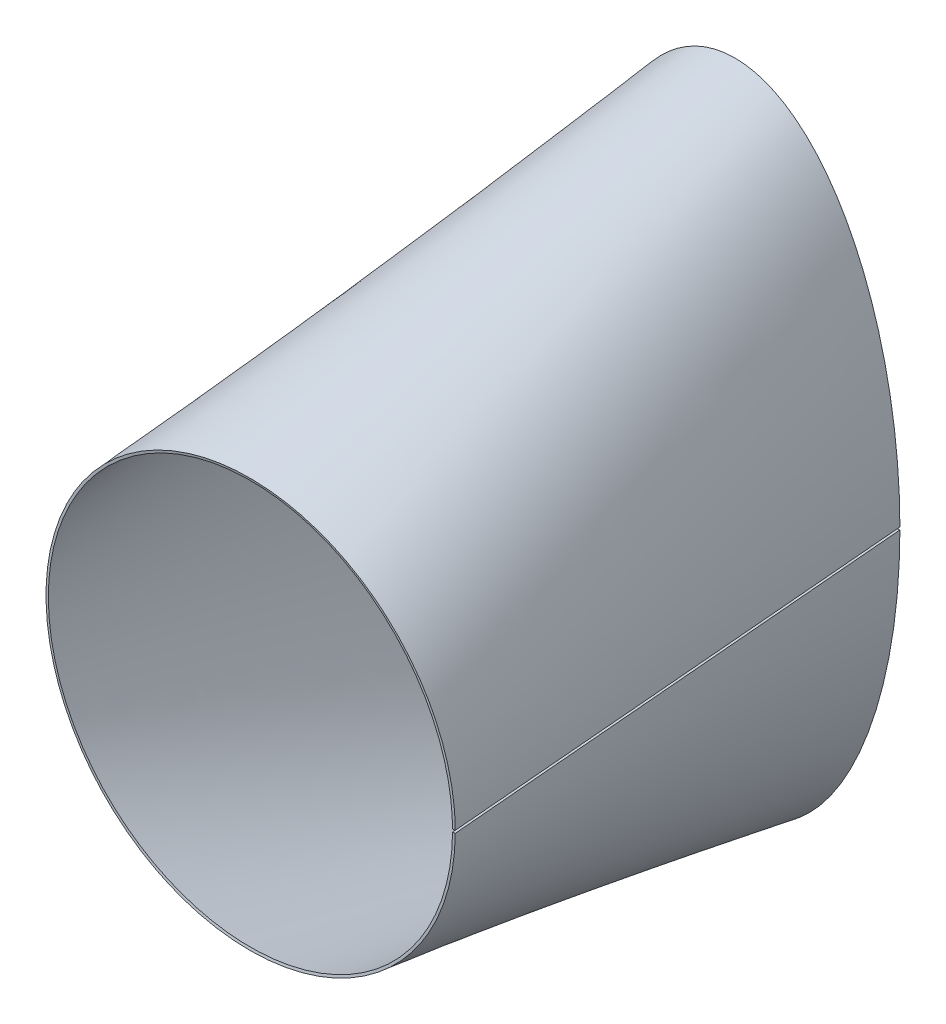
ISO-10303-21;
HEADER;
FILE_DESCRIPTION(('STEP AP214'),'2;1');
FILE_NAME('part.step','',(''),(''),'','','');
FILE_SCHEMA(('AUTOMOTIVE_DESIGN { 1 0 10303 214 1 1 1 1 }'));
ENDSEC;
DATA;
#1=APPLICATION_CONTEXT('core data for automotive mechanical design processes');
#2=APPLICATION_PROTOCOL_DEFINITION('international standard','automotive_design',2000,#1);
#3=PRODUCT_CONTEXT('',#1,'mechanical');
#4=PRODUCT('Part','Part','',(#3));
#5=PRODUCT_RELATED_PRODUCT_CATEGORY('part','',(#4));
#6=PRODUCT_DEFINITION_FORMATION('','',#4);
#7=PRODUCT_DEFINITION_CONTEXT('part definition',#1,'design');
#8=PRODUCT_DEFINITION('design','',#6,#7);
#9=PRODUCT_DEFINITION_SHAPE('','',#8);
#10=(LENGTH_UNIT() NAMED_UNIT(*) SI_UNIT(.MILLI.,.METRE.));
#11=(NAMED_UNIT(*) PLANE_ANGLE_UNIT() SI_UNIT($,.RADIAN.));
#12=(NAMED_UNIT(*) SI_UNIT($,.STERADIAN.) SOLID_ANGLE_UNIT());
#13=UNCERTAINTY_MEASURE_WITH_UNIT(LENGTH_MEASURE(1.E-05),#10,'distance_accuracy_value','');
#14=(GEOMETRIC_REPRESENTATION_CONTEXT(3) GLOBAL_UNCERTAINTY_ASSIGNED_CONTEXT((#13)) GLOBAL_UNIT_ASSIGNED_CONTEXT((#10,
#11,#12)) REPRESENTATION_CONTEXT('',''));
#15=CARTESIAN_POINT('',(0.,0.,0.));
#16=DIRECTION('',(0.,0.,1.));
#17=DIRECTION('',(1.,0.,0.));
#18=AXIS2_PLACEMENT_3D('',#15,#16,#17);
#19=CARTESIAN_POINT('',(128.579505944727,0.803637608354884,304.668176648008));
#20=CARTESIAN_POINT('',(128.568282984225,2.60026325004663,304.668250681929));
#21=CARTESIAN_POINT('',(128.519189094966,4.50962075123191,304.6686375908));
#22=CARTESIAN_POINT('',(128.311193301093,8.5901756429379,304.670277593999));
#23=CARTESIAN_POINT('',(128.152366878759,10.7636585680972,304.671567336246));
#24=CARTESIAN_POINT('',(127.676039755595,15.4205110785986,304.675350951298));
#25=CARTESIAN_POINT('',(127.358535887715,17.9067723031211,304.677940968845));
#26=CARTESIAN_POINT('',(126.493652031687,23.245152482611,304.684788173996));
#27=CARTESIAN_POINT('',(125.946113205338,26.1010823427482,304.689242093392));
#28=CARTESIAN_POINT('',(124.516535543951,32.2414875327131,304.700441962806));
#29=CARTESIAN_POINT('',(123.634038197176,35.5310516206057,304.707550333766));
#30=CARTESIAN_POINT('',(121.379858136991,42.60277602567,304.724872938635));
#31=CARTESIAN_POINT('',(120.007556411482,46.3908211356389,304.735586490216));
#32=CARTESIAN_POINT('',(117.409247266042,52.4836042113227,304.755099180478));
#33=CARTESIAN_POINT('',(116.452146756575,54.5836793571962,304.762284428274));
#34=CARTESIAN_POINT('',(114.318189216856,58.9228984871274,304.777940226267));
#35=CARTESIAN_POINT('',(113.140888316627,61.163093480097,304.786553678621));
#36=CARTESIAN_POINT('',(110.520238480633,65.7804982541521,304.805204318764));
#37=CARTESIAN_POINT('',(109.076309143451,68.1588839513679,304.815417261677));
#38=CARTESIAN_POINT('',(105.867169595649,73.0432969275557,304.837366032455));
#39=CARTESIAN_POINT('',(104.101207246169,75.5506210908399,304.849312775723));
#40=CARTESIAN_POINT('',(100.183062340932,80.672522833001,304.874746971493));
#41=CARTESIAN_POINT('',(98.0299169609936,83.2884995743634,304.888479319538));
#42=CARTESIAN_POINT('',(93.2627715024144,88.5912620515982,304.917359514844));
#43=CARTESIAN_POINT('',(90.6475604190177,91.2795070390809,304.93277903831));
#44=CARTESIAN_POINT('',(84.8734990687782,96.667707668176,304.964683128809));
#45=CARTESIAN_POINT('',(81.7131648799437,99.3691058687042,304.981450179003));
#46=CARTESIAN_POINT('',(74.7621642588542,104.693745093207,305.015377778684));
#47=CARTESIAN_POINT('',(70.9697502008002,107.31828889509,305.032805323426));
#48=CARTESIAN_POINT('',(62.672539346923,112.359570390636,305.066970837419));
#49=CARTESIAN_POINT('',(58.165809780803,114.777294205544,305.083926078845));
#50=CARTESIAN_POINT('',(48.3773304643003,119.227332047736,305.115598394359));
#51=CARTESIAN_POINT('',(43.0936632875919,121.260092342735,305.130450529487));
#52=CARTESIAN_POINT('',(31.7306645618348,124.710821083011,305.155919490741));
#53=CARTESIAN_POINT('',(25.6498191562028,126.128469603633,305.166577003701));
#54=CARTESIAN_POINT('',(12.7440546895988,128.074095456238,305.181328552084));
#55=CARTESIAN_POINT('',(5.91839829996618,128.60086632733,305.18539955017));
#56=CARTESIAN_POINT('',(-4.7592718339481,128.501327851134,305.18478980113));
#57=CARTESIAN_POINT('',(-8.39060123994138,128.319813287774,305.183469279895));
#58=CARTESIAN_POINT('',(-15.7656921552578,127.625020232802,305.178336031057));
#59=CARTESIAN_POINT('',(-19.5091880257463,127.111694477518,305.174531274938));
#60=CARTESIAN_POINT('',(-27.0679239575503,125.721725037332,305.164234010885));
#61=CARTESIAN_POINT('',(-30.882781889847,124.84506658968,305.157762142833));
#62=CARTESIAN_POINT('',(-38.5352184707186,122.702842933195,305.142031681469));
#63=CARTESIAN_POINT('',(-42.3722968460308,121.437320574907,305.132811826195));
#64=CARTESIAN_POINT('',(-50.0127707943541,118.500153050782,305.111625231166));
#65=CARTESIAN_POINT('',(-53.8155561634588,116.828635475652,305.099719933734));
#66=CARTESIAN_POINT('',(-61.3254025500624,113.072905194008,305.073383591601));
#67=CARTESIAN_POINT('',(-65.0317634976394,110.988930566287,305.059039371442));
#68=CARTESIAN_POINT('',(-72.2836061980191,106.414202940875,305.02825857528));
#69=CARTESIAN_POINT('',(-75.8283303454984,103.923818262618,305.011933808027));
#70=CARTESIAN_POINT('',(-82.691812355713,98.5557928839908,304.977841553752));
#71=CARTESIAN_POINT('',(-86.0097976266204,95.6786593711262,304.960206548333));
#72=CARTESIAN_POINT('',(-92.3583582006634,89.5703919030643,304.924323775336));
#73=CARTESIAN_POINT('',(-95.3881937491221,86.3398972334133,304.906220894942));
#74=CARTESIAN_POINT('',(-101.106248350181,79.5708859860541,304.870334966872));
#75=CARTESIAN_POINT('',(-103.793806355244,76.0331169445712,304.852698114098));
#76=CARTESIAN_POINT('',(-108.783517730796,68.7061287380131,304.818674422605));
#77=CARTESIAN_POINT('',(-111.085125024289,64.9177265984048,304.802423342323));
#78=CARTESIAN_POINT('',(-115.271939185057,57.1535930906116,304.771993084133));
#79=CARTESIAN_POINT('',(-117.156735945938,53.1787003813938,304.757929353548));
#80=CARTESIAN_POINT('',(-120.49302186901,45.10965401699,304.732507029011));
#81=CARTESIAN_POINT('',(-121.944240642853,41.0163114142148,304.721237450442));
#82=CARTESIAN_POINT('',(-124.410677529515,32.7786518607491,304.701807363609));
#83=CARTESIAN_POINT('',(-125.425753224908,28.6350749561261,304.693707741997));
#84=CARTESIAN_POINT('',(-127.03046563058,20.3620074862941,304.680789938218));
#85=CARTESIAN_POINT('',(-127.620064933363,16.2331533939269,304.676006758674));
#86=CARTESIAN_POINT('',(-128.395821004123,8.04852814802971,304.669687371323));
#87=CARTESIAN_POINT('',(-128.582016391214,3.99329371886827,304.668165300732));
#88=CARTESIAN_POINT('',(-128.582016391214,-3.99329371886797,304.668165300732));
#89=CARTESIAN_POINT('',(-128.395823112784,-8.04850530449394,304.669686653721));
#90=CARTESIAN_POINT('',(-127.620062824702,-16.2331762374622,304.676007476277));
#91=CARTESIAN_POINT('',(-127.030469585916,-20.3619866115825,304.680788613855));
#92=CARTESIAN_POINT('',(-125.425749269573,-28.6350958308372,304.69370906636));
#93=CARTESIAN_POINT('',(-124.410682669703,-32.7786343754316,304.701805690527));
#94=CARTESIAN_POINT('',(-121.944235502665,-41.0163288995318,304.721239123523));
#95=CARTESIAN_POINT('',(-120.493027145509,-45.1096411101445,304.732505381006));
#96=CARTESIAN_POINT('',(-117.15673066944,-53.1787132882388,304.757931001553));
#97=CARTESIAN_POINT('',(-115.271943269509,-57.1535854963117,304.771991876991));
#98=CARTESIAN_POINT('',(-111.085120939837,-64.9177341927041,304.802424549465));
#99=CARTESIAN_POINT('',(-108.783519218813,-68.7061265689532,304.818674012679));
#100=CARTESIAN_POINT('',(-103.793804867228,-76.0331191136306,304.852698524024));
#101=CARTESIAN_POINT('',(-101.106246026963,-79.5708886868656,304.87033555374));
#102=CARTESIAN_POINT('',(-95.3881960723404,-86.3398945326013,304.906220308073));
#103=CARTESIAN_POINT('',(-92.3583512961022,-89.5703983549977,304.92432534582));
#104=CARTESIAN_POINT('',(-86.0098045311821,-95.6786529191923,304.960204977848));
#105=CARTESIAN_POINT('',(-82.6918007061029,-98.5558016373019,304.977843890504));
#106=CARTESIAN_POINT('',(-75.8283419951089,-103.923809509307,305.011931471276));
#107=CARTESIAN_POINT('',(-72.2835902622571,-106.414212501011,305.028261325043));
#108=CARTESIAN_POINT('',(-65.0317794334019,-110.988921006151,305.059036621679));
#109=CARTESIAN_POINT('',(-61.325383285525,-113.072914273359,305.073386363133));
#110=CARTESIAN_POINT('',(-53.8155754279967,-116.8286263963,305.099717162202));
#111=CARTESIAN_POINT('',(-50.012749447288,-118.500160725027,305.111627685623));
#112=CARTESIAN_POINT('',(-42.3723181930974,-121.437312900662,305.132809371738));
#113=CARTESIAN_POINT('',(-38.5351963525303,-122.702848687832,305.142033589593));
#114=CARTESIAN_POINT('',(-30.8828040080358,-124.845060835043,305.157760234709));
#115=CARTESIAN_POINT('',(-27.0679022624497,-125.721728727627,305.16423527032));
#116=CARTESIAN_POINT('',(-19.5092097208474,-127.111690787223,305.174530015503));
#117=CARTESIAN_POINT('',(-15.7656718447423,-127.62502199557,305.178336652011));
#118=CARTESIAN_POINT('',(-8.39062155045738,-128.319811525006,305.183468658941));
#119=CARTESIAN_POINT('',(-4.7592547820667,-128.501327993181,305.184789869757));
#120=CARTESIAN_POINT('',(5.91836419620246,-128.600866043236,305.185399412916));
#121=CARTESIAN_POINT('',(12.7442655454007,-128.074065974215,305.181318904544));
#122=CARTESIAN_POINT('',(25.6496083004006,-126.128499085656,305.166586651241));
#123=CARTESIAN_POINT('',(31.7307965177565,-124.710783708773,305.155907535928));
#124=CARTESIAN_POINT('',(43.0935313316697,-121.260129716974,305.1304624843));
#125=CARTESIAN_POINT('',(48.3773990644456,-119.227302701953,305.11558945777));
#126=CARTESIAN_POINT('',(58.1657411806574,-114.777323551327,305.083935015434));
#127=CARTESIAN_POINT('',(62.672564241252,-112.359556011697,305.066966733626));
#128=CARTESIAN_POINT('',(70.9697253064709,-107.318303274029,305.032809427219));
#129=CARTESIAN_POINT('',(74.7621628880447,-104.693746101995,305.015378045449));
#130=CARTESIAN_POINT('',(81.713166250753,-99.3691048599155,304.981449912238));
#131=CARTESIAN_POINT('',(84.8734842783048,-96.667721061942,304.964686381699));
#132=CARTESIAN_POINT('',(90.6475752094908,-91.279493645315,304.932775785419));
#133=CARTESIAN_POINT('',(93.2627515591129,-88.5912837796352,304.917364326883));
#134=CARTESIAN_POINT('',(98.0299369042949,-83.2884778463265,304.888474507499));
#135=CARTESIAN_POINT('',(100.18304195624,-80.6725491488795,304.87475225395));
#136=CARTESIAN_POINT('',(104.10122763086,-75.5505947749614,304.849307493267));
#137=CARTESIAN_POINT('',(105.867151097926,-73.043324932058,304.837371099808));
#138=CARTESIAN_POINT('',(109.076327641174,-68.1588559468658,304.815412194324));
#139=CARTESIAN_POINT('',(110.520222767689,-65.7805259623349,304.805208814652));
#140=CARTESIAN_POINT('',(113.140904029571,-61.1630657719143,304.786549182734));
#141=CARTESIAN_POINT('',(114.31817641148,-58.9229246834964,304.777944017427));
#142=CARTESIAN_POINT('',(116.452159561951,-54.5836531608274,304.762280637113));
#143=CARTESIAN_POINT('',(117.409374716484,-52.4833022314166,304.755060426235));
#144=CARTESIAN_POINT('',(120.007301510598,-46.3914250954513,304.735663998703));
#145=CARTESIAN_POINT('',(121.379761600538,-42.603084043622,304.724903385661));
#146=CARTESIAN_POINT('',(123.63413473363,-35.5307436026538,304.70751988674));
#147=CARTESIAN_POINT('',(124.516481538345,-32.2417244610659,304.700459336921));
#148=CARTESIAN_POINT('',(125.946167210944,-26.1008454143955,304.689224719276));
#149=CARTESIAN_POINT('',(126.493623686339,-23.245331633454,304.684797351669));
#150=CARTESIAN_POINT('',(127.358564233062,-17.9065931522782,304.677931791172));
#151=CARTESIAN_POINT('',(127.676026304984,-15.420645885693,304.675355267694));
#152=CARTESIAN_POINT('',(128.15238032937,-10.763523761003,304.671563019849));
#153=CARTESIAN_POINT('',(128.311188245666,-8.59027726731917,304.670279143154));
#154=CARTESIAN_POINT('',(128.519194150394,-4.5095191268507,304.668636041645));
#155=CARTESIAN_POINT('',(128.568282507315,-2.60033959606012,304.668250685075));
#156=CARTESIAN_POINT('',(128.579505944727,-0.803637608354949,304.668176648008));
#157=CARTESIAN_POINT('',(126.997519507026,0.79375,304.8));
#158=CARTESIAN_POINT('',(126.986426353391,2.56861991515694,304.8));
#159=CARTESIAN_POINT('',(126.937925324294,4.45377000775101,304.8));
#160=CARTESIAN_POINT('',(126.732317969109,8.48484148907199,304.8));
#161=CARTESIAN_POINT('',(126.575407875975,10.6307375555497,304.8));
#162=CARTESIAN_POINT('',(126.104549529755,15.2311866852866,304.8));
#163=CARTESIAN_POINT('',(125.790898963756,17.6857475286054,304.8));
#164=CARTESIAN_POINT('',(124.93596688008,22.9595319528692,304.8));
#165=CARTESIAN_POINT('',(124.395135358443,25.778848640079,304.8));
#166=CARTESIAN_POINT('',(122.982089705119,31.8450050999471,304.8));
#167=CARTESIAN_POINT('',(122.110543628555,35.0921358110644,304.8));
#168=CARTESIAN_POINT('',(119.882653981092,42.0784046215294,304.8));
#169=CARTESIAN_POINT('',(118.527255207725,45.8182657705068,304.8));
#170=CARTESIAN_POINT('',(115.960248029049,51.836056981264,304.8));
#171=CARTESIAN_POINT('',(115.014927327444,53.909828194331,304.8));
#172=CARTESIAN_POINT('',(112.906890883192,58.195679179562,304.8));
#173=CARTESIAN_POINT('',(111.744212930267,60.4078312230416,304.8));
#174=CARTESIAN_POINT('',(109.155674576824,64.9685608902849,304.8));
#175=CARTESIAN_POINT('',(107.729846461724,67.3172415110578,304.8));
#176=CARTESIAN_POINT('',(104.56037128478,72.1419405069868,304.8));
#177=CARTESIAN_POINT('',(102.816739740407,74.6181019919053,304.8));
#178=CARTESIAN_POINT('',(98.9474040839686,79.6778158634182,304.8));
#179=CARTESIAN_POINT('',(96.8216791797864,82.2615604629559,304.8));
#180=CARTESIAN_POINT('',(92.1142782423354,87.5006378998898,304.8));
#181=CARTESIAN_POINT('',(89.5325135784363,90.1562165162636,304.8));
#182=CARTESIAN_POINT('',(83.8310332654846,95.4807426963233,304.8));
#183=CARTESIAN_POINT('',(80.7111144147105,98.1499810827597,304.8));
#184=CARTESIAN_POINT('',(73.8473829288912,103.413088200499,304.8));
#185=CARTESIAN_POINT('',(70.1031912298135,106.007256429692,304.8));
#186=CARTESIAN_POINT('',(61.9095114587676,110.991928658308,304.8));
#187=CARTESIAN_POINT('',(57.4594042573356,113.382654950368,304.8));
#188=CARTESIAN_POINT('',(47.7917641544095,117.784365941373,304.8));
#189=CARTESIAN_POINT('',(42.5733390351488,119.795338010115,304.8));
#190=CARTESIAN_POINT('',(31.3488118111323,123.209838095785,304.8));
#191=CARTESIAN_POINT('',(25.3416098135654,124.612887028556,304.8));
#192=CARTESIAN_POINT('',(12.5914439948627,126.538627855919,304.8));
#193=CARTESIAN_POINT('',(5.84742854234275,127.060128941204,304.8));
#194=CARTESIAN_POINT('',(-4.7022193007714,126.961633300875,304.8));
#195=CARTESIAN_POINT('',(-8.2901059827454,126.781960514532,304.8));
#196=CARTESIAN_POINT('',(-15.576568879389,126.094257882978,304.8));
#197=CARTESIAN_POINT('',(-19.2751452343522,125.58615509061,304.8));
#198=CARTESIAN_POINT('',(-26.7425339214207,124.210508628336,304.8));
#199=CARTESIAN_POINT('',(-30.5113251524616,123.342886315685,304.8));
#200=CARTESIAN_POINT('',(-38.0704847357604,121.223127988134,304.8));
#201=CARTESIAN_POINT('',(-41.8608071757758,119.970914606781,304.8));
#202=CARTESIAN_POINT('',(-49.4071582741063,117.065281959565,304.8));
#203=CARTESIAN_POINT('',(-53.163115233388,115.411795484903,304.8));
#204=CARTESIAN_POINT('',(-60.5794159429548,111.697509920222,304.8));
#205=CARTESIAN_POINT('',(-64.2396648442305,109.636663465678,304.8));
#206=CARTESIAN_POINT('',(-71.4002939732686,105.113893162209,304.8));
#207=CARTESIAN_POINT('',(-74.9005629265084,102.651950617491,304.8));
#208=CARTESIAN_POINT('',(-81.6771628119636,97.3465888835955,304.8));
#209=CARTESIAN_POINT('',(-84.9533764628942,94.5031857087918,304.8));
#210=CARTESIAN_POINT('',(-91.2214546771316,88.4679291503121,304.8));
#211=CARTESIAN_POINT('',(-94.2132086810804,85.2761280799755,304.8));
#212=CARTESIAN_POINT('',(-99.8590834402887,78.5895041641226,304.8));
#213=CARTESIAN_POINT('',(-102.513113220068,75.0947661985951,304.8));
#214=CARTESIAN_POINT('',(-107.440454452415,67.8580211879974,304.8));
#215=CARTESIAN_POINT('',(-109.713705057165,64.1161228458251,304.8));
#216=CARTESIAN_POINT('',(-113.848917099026,56.4481918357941,304.8));
#217=CARTESIAN_POINT('',(-115.710853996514,52.5222794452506,304.8));
#218=CARTESIAN_POINT('',(-119.006682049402,44.5533522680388,304.8));
#219=CARTESIAN_POINT('',(-120.440585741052,40.5104558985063,304.8));
#220=CARTESIAN_POINT('',(-122.877582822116,32.3748570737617,304.8));
#221=CARTESIAN_POINT('',(-123.88072138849,28.2822590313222,304.8));
#222=CARTESIAN_POINT('',(-125.466528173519,20.1114299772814,304.8));
#223=CARTESIAN_POINT('',(-126.049265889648,16.0332804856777,304.8));
#224=CARTESIAN_POINT('',(-126.815960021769,7.9495784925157,304.8));
#225=CARTESIAN_POINT('',(-127.,3.94408000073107,304.8));
#226=CARTESIAN_POINT('',(-127.,-3.94408000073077,304.8));
#227=CARTESIAN_POINT('',(-126.815960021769,-7.94957849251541,304.8));
#228=CARTESIAN_POINT('',(-126.049265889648,-16.0332804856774,304.8));
#229=CARTESIAN_POINT('',(-125.466528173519,-20.1114299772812,304.8));
#230=CARTESIAN_POINT('',(-123.88072138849,-28.2822590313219,304.8));
#231=CARTESIAN_POINT('',(-122.877582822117,-32.3748570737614,304.8));
#232=CARTESIAN_POINT('',(-120.440585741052,-40.5104558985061,304.8));
#233=CARTESIAN_POINT('',(-119.006682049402,-44.5533522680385,304.8));
#234=CARTESIAN_POINT('',(-115.710853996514,-52.5222794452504,304.8));
#235=CARTESIAN_POINT('',(-113.848917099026,-56.4481918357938,304.8));
#236=CARTESIAN_POINT('',(-109.713705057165,-64.1161228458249,304.8));
#237=CARTESIAN_POINT('',(-107.440454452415,-67.8580211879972,304.8));
#238=CARTESIAN_POINT('',(-102.513113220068,-75.0947661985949,304.8));
#239=CARTESIAN_POINT('',(-99.8590834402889,-78.5895041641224,304.8));
#240=CARTESIAN_POINT('',(-94.2132086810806,-85.2761280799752,304.8));
#241=CARTESIAN_POINT('',(-91.2214546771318,-88.4679291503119,304.8));
#242=CARTESIAN_POINT('',(-84.9533764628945,-94.5031857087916,304.8));
#243=CARTESIAN_POINT('',(-81.6771628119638,-97.3465888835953,304.8));
#244=CARTESIAN_POINT('',(-74.9005629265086,-102.651950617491,304.8));
#245=CARTESIAN_POINT('',(-71.4002939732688,-105.113893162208,304.8));
#246=CARTESIAN_POINT('',(-64.2396648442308,-109.636663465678,304.8));
#247=CARTESIAN_POINT('',(-60.579415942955,-111.697509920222,304.8));
#248=CARTESIAN_POINT('',(-53.1631152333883,-115.411795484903,304.8));
#249=CARTESIAN_POINT('',(-49.4071582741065,-117.065281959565,304.8));
#250=CARTESIAN_POINT('',(-41.8608071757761,-119.970914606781,304.8));
#251=CARTESIAN_POINT('',(-38.0704847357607,-121.223127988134,304.8));
#252=CARTESIAN_POINT('',(-30.5113251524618,-123.342886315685,304.8));
#253=CARTESIAN_POINT('',(-26.7425339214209,-124.210508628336,304.8));
#254=CARTESIAN_POINT('',(-19.2751452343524,-125.58615509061,304.8));
#255=CARTESIAN_POINT('',(-15.5765688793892,-126.094257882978,304.8));
#256=CARTESIAN_POINT('',(-8.29010598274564,-126.781960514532,304.8));
#257=CARTESIAN_POINT('',(-4.70221930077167,-126.961633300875,304.8));
#258=CARTESIAN_POINT('',(5.84742854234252,-127.060128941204,304.8));
#259=CARTESIAN_POINT('',(12.5914439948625,-126.538627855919,304.8));
#260=CARTESIAN_POINT('',(25.3416098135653,-124.612887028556,304.8));
#261=CARTESIAN_POINT('',(31.348811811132,-123.209838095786,304.8));
#262=CARTESIAN_POINT('',(42.5733390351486,-119.795338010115,304.8));
#263=CARTESIAN_POINT('',(47.7917641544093,-117.784365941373,304.8));
#264=CARTESIAN_POINT('',(57.4594042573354,-113.382654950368,304.8));
#265=CARTESIAN_POINT('',(61.9095114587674,-110.991928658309,304.8));
#266=CARTESIAN_POINT('',(70.1031912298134,-106.007256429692,304.8));
#267=CARTESIAN_POINT('',(73.8473829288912,-103.4130882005,304.8));
#268=CARTESIAN_POINT('',(80.7111144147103,-98.1499810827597,304.8));
#269=CARTESIAN_POINT('',(83.8310332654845,-95.4807426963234,304.8));
#270=CARTESIAN_POINT('',(89.5325135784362,-90.1562165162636,304.8));
#271=CARTESIAN_POINT('',(92.1142782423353,-87.5006378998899,304.8));
#272=CARTESIAN_POINT('',(96.8216791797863,-82.2615604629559,304.8));
#273=CARTESIAN_POINT('',(98.9474040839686,-79.6778158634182,304.8));
#274=CARTESIAN_POINT('',(102.816739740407,-74.6181019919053,304.8));
#275=CARTESIAN_POINT('',(104.56037128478,-72.141940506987,304.8));
#276=CARTESIAN_POINT('',(107.729846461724,-67.3172415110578,304.8));
#277=CARTESIAN_POINT('',(109.155674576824,-64.968560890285,304.8));
#278=CARTESIAN_POINT('',(111.744212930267,-60.4078312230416,304.8));
#279=CARTESIAN_POINT('',(112.906890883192,-58.1956791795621,304.8));
#280=CARTESIAN_POINT('',(115.014927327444,-53.909828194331,304.8));
#281=CARTESIAN_POINT('',(115.960248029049,-51.8360569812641,304.8));
#282=CARTESIAN_POINT('',(118.527255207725,-45.8182657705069,304.8));
#283=CARTESIAN_POINT('',(119.882653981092,-42.0784046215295,304.8));
#284=CARTESIAN_POINT('',(122.110543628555,-35.0921358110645,304.8));
#285=CARTESIAN_POINT('',(122.982089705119,-31.8450050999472,304.8));
#286=CARTESIAN_POINT('',(124.395135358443,-25.778848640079,304.8));
#287=CARTESIAN_POINT('',(124.93596688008,-22.9595319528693,304.8));
#288=CARTESIAN_POINT('',(125.790898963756,-17.6857475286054,304.8));
#289=CARTESIAN_POINT('',(126.104549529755,-15.2311866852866,304.8));
#290=CARTESIAN_POINT('',(126.575407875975,-10.6307375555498,304.8));
#291=CARTESIAN_POINT('',(126.732317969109,-8.48484148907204,304.8));
#292=CARTESIAN_POINT('',(126.937925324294,-4.45377000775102,304.8));
#293=CARTESIAN_POINT('',(126.986426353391,-2.56861991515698,304.8));
#294=CARTESIAN_POINT('',(126.997519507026,-0.793750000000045,304.8));
#295=B_SPLINE_SURFACE_WITH_KNOTS('',1,3,((#19,#20,#21,#22,#23,#24,#25,#26,#27,#28,#29,#30,#31,
#32,#33,#34,#35,#36,#37,#38,#39,#40,#41,#42,#43,#44,#45,#46,#47,#48,#49,#50,#51,#52,#53,#54,#55,
#56,#57,#58,#59,#60,#61,#62,#63,#64,#65,#66,#67,#68,#69,#70,#71,#72,#73,#74,#75,#76,#77,#78,#79,
#80,#81,#82,#83,#84,#85,#86,#87,#88,#89,#90,#91,#92,#93,#94,#95,#96,#97,#98,#99,#100,#101,#102,
#103,#104,#105,#106,#107,#108,#109,#110,#111,#112,#113,#114,#115,#116,#117,#118,#119,#120,#121,
#122,#123,#124,#125,#126,#127,#128,#129,#130,#131,#132,#133,#134,#135,#136,#137,#138,#139,#140,
#141,#142,#143,#144,#145,#146,#147,#148,#149,#150,#151,#152,#153,#154,#155,#156),(#157,#158,
#159,#160,#161,#162,#163,#164,#165,#166,#167,#168,#169,#170,#171,#172,#173,#174,#175,#176,#177,
#178,#179,#180,#181,#182,#183,#184,#185,#186,#187,#188,#189,#190,#191,#192,#193,#194,#195,#196,
#197,#198,#199,#200,#201,#202,#203,#204,#205,#206,#207,#208,#209,#210,#211,#212,#213,#214,#215,
#216,#217,#218,#219,#220,#221,#222,#223,#224,#225,#226,#227,#228,#229,#230,#231,#232,#233,#234,
#235,#236,#237,#238,#239,#240,#241,#242,#243,#244,#245,#246,#247,#248,#249,#250,#251,#252,#253,
#254,#255,#256,#257,#258,#259,#260,#261,#262,#263,#264,#265,#266,#267,#268,#269,#270,#271,#272,
#273,#274,#275,#276,#277,#278,#279,#280,#281,#282,#283,#284,#285,#286,#287,#288,#289,#290,#291,
#292,#293,#294)),.UNSPECIFIED.,.F.,.F.,.F.,(2,2),(4,2,2,2,2,2,2,2,2,2,2,2,2,2,2,2,2,2,2,2,2,2,2,
2,2,2,2,2,2,2,2,2,2,2,2,2,2,2,2,2,2,2,2,2,2,2,2,2,2,2,2,2,2,2,2,2,2,2,2,2,2,2,2,2,2,2,2,2,4),
(0.,1.),(0.,0.03125,0.0625,0.09375,0.125,0.15625,0.1875,0.203125,0.21875,0.234375,0.25,0.265625,
0.28125,0.296875,0.3125,0.328125,0.34375,0.359375,0.375,0.3828125,0.390625,0.3984375,0.40625,
0.4140625,0.421875,0.4296875,0.4375,0.4453125,0.453125,0.4609375,0.46875,0.4765625,0.484375,
0.4921875,0.5,0.5078125,0.515625,0.5234375,0.53125,0.5390625,0.546875,0.5546875,0.5625,
0.5703125,0.578125,0.5859375,0.59375,0.6015625,0.609375,0.6171875,0.625,0.640625,0.65625,
0.671875,0.6875,0.703125,0.71875,0.734375,0.75,0.765625,0.78125,0.796875,0.8125,0.84375,0.875,
0.90625,0.9375,0.96875,1.),.UNSPECIFIED.);
#296=CARTESIAN_POINT('',(126.997519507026,-0.793750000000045,304.8));
#297=CARTESIAN_POINT('',(128.579505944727,-0.803637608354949,304.668176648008));
#298=B_SPLINE_CURVE_WITH_KNOTS('',1,(#296,#297),.UNSPECIFIED.,.F.,.F.,(2,2),(0.,1.),.UNSPECIFIED.);
#299=CARTESIAN_POINT('',(126.997519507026,-0.793750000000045,304.8));
#300=VERTEX_POINT('',#299);
#301=CARTESIAN_POINT('',(128.579505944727,-0.803637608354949,304.668176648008));
#302=VERTEX_POINT('',#301);
#303=EDGE_CURVE('E14',#300,#302,#298,.T.);
#304=CARTESIAN_POINT('',(126.997519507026,-0.793750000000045,304.8));
#305=CARTESIAN_POINT('',(126.986426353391,-2.56861991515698,304.8));
#306=CARTESIAN_POINT('',(126.937925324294,-4.45377000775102,304.8));
#307=CARTESIAN_POINT('',(126.732317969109,-8.48484148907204,304.8));
#308=CARTESIAN_POINT('',(126.575407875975,-10.6307375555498,304.8));
#309=CARTESIAN_POINT('',(126.104549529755,-15.2311866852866,304.8));
#310=CARTESIAN_POINT('',(125.790898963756,-17.6857475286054,304.8));
#311=CARTESIAN_POINT('',(124.93596688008,-22.9595319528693,304.8));
#312=CARTESIAN_POINT('',(124.395135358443,-25.778848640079,304.8));
#313=CARTESIAN_POINT('',(122.982089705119,-31.8450050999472,304.8));
#314=CARTESIAN_POINT('',(122.110543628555,-35.0921358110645,304.8));
#315=CARTESIAN_POINT('',(119.882653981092,-42.0784046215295,304.8));
#316=CARTESIAN_POINT('',(118.527255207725,-45.8182657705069,304.8));
#317=CARTESIAN_POINT('',(115.960248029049,-51.8360569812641,304.8));
#318=CARTESIAN_POINT('',(115.014927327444,-53.909828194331,304.8));
#319=CARTESIAN_POINT('',(112.906890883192,-58.1956791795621,304.8));
#320=CARTESIAN_POINT('',(111.744212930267,-60.4078312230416,304.8));
#321=CARTESIAN_POINT('',(109.155674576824,-64.968560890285,304.8));
#322=CARTESIAN_POINT('',(107.729846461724,-67.3172415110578,304.8));
#323=CARTESIAN_POINT('',(104.56037128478,-72.141940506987,304.8));
#324=CARTESIAN_POINT('',(102.816739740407,-74.6181019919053,304.8));
#325=CARTESIAN_POINT('',(98.9474040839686,-79.6778158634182,304.8));
#326=CARTESIAN_POINT('',(96.8216791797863,-82.2615604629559,304.8));
#327=CARTESIAN_POINT('',(92.1142782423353,-87.5006378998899,304.8));
#328=CARTESIAN_POINT('',(89.5325135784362,-90.1562165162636,304.8));
#329=CARTESIAN_POINT('',(83.8310332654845,-95.4807426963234,304.8));
#330=CARTESIAN_POINT('',(80.7111144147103,-98.1499810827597,304.8));
#331=CARTESIAN_POINT('',(73.8473829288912,-103.4130882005,304.8));
#332=CARTESIAN_POINT('',(70.1031912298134,-106.007256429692,304.8));
#333=CARTESIAN_POINT('',(61.9095114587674,-110.991928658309,304.8));
#334=CARTESIAN_POINT('',(57.4594042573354,-113.382654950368,304.8));
#335=CARTESIAN_POINT('',(47.7917641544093,-117.784365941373,304.8));
#336=CARTESIAN_POINT('',(42.5733390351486,-119.795338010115,304.8));
#337=CARTESIAN_POINT('',(31.348811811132,-123.209838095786,304.8));
#338=CARTESIAN_POINT('',(25.3416098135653,-124.612887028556,304.8));
#339=CARTESIAN_POINT('',(12.5914439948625,-126.538627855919,304.8));
#340=CARTESIAN_POINT('',(5.84742854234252,-127.060128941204,304.8));
#341=CARTESIAN_POINT('',(-4.70221930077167,-126.961633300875,304.8));
#342=CARTESIAN_POINT('',(-8.29010598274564,-126.781960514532,304.8));
#343=CARTESIAN_POINT('',(-15.5765688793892,-126.094257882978,304.8));
#344=CARTESIAN_POINT('',(-19.2751452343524,-125.58615509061,304.8));
#345=CARTESIAN_POINT('',(-26.7425339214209,-124.210508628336,304.8));
#346=CARTESIAN_POINT('',(-30.5113251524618,-123.342886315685,304.8));
#347=CARTESIAN_POINT('',(-38.0704847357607,-121.223127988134,304.8));
#348=CARTESIAN_POINT('',(-41.8608071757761,-119.970914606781,304.8));
#349=CARTESIAN_POINT('',(-49.4071582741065,-117.065281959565,304.8));
#350=CARTESIAN_POINT('',(-53.1631152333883,-115.411795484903,304.8));
#351=CARTESIAN_POINT('',(-60.579415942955,-111.697509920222,304.8));
#352=CARTESIAN_POINT('',(-64.2396648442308,-109.636663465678,304.8));
#353=CARTESIAN_POINT('',(-71.4002939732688,-105.113893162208,304.8));
#354=CARTESIAN_POINT('',(-74.9005629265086,-102.651950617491,304.8));
#355=CARTESIAN_POINT('',(-81.6771628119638,-97.3465888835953,304.8));
#356=CARTESIAN_POINT('',(-84.9533764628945,-94.5031857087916,304.8));
#357=CARTESIAN_POINT('',(-91.2214546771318,-88.4679291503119,304.8));
#358=CARTESIAN_POINT('',(-94.2132086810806,-85.2761280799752,304.8));
#359=CARTESIAN_POINT('',(-99.8590834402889,-78.5895041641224,304.8));
#360=CARTESIAN_POINT('',(-102.513113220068,-75.0947661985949,304.8));
#361=CARTESIAN_POINT('',(-107.440454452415,-67.8580211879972,304.8));
#362=CARTESIAN_POINT('',(-109.713705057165,-64.1161228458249,304.8));
#363=CARTESIAN_POINT('',(-113.848917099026,-56.4481918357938,304.8));
#364=CARTESIAN_POINT('',(-115.710853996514,-52.5222794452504,304.8));
#365=CARTESIAN_POINT('',(-119.006682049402,-44.5533522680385,304.8));
#366=CARTESIAN_POINT('',(-120.440585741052,-40.5104558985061,304.8));
#367=CARTESIAN_POINT('',(-122.877582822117,-32.3748570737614,304.8));
#368=CARTESIAN_POINT('',(-123.88072138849,-28.2822590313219,304.8));
#369=CARTESIAN_POINT('',(-125.466528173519,-20.1114299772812,304.8));
#370=CARTESIAN_POINT('',(-126.049265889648,-16.0332804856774,304.8));
#371=CARTESIAN_POINT('',(-126.815960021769,-7.94957849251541,304.8));
#372=CARTESIAN_POINT('',(-127.,-3.94408000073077,304.8));
#373=CARTESIAN_POINT('',(-127.,3.94408000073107,304.8));
#374=CARTESIAN_POINT('',(-126.815960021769,7.9495784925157,304.8));
#375=CARTESIAN_POINT('',(-126.049265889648,16.0332804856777,304.8));
#376=CARTESIAN_POINT('',(-125.466528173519,20.1114299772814,304.8));
#377=CARTESIAN_POINT('',(-123.88072138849,28.2822590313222,304.8));
#378=CARTESIAN_POINT('',(-122.877582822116,32.3748570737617,304.8));
#379=CARTESIAN_POINT('',(-120.440585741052,40.5104558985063,304.8));
#380=CARTESIAN_POINT('',(-119.006682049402,44.5533522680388,304.8));
#381=CARTESIAN_POINT('',(-115.710853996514,52.5222794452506,304.8));
#382=CARTESIAN_POINT('',(-113.848917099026,56.4481918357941,304.8));
#383=CARTESIAN_POINT('',(-109.713705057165,64.1161228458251,304.8));
#384=CARTESIAN_POINT('',(-107.440454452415,67.8580211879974,304.8));
#385=CARTESIAN_POINT('',(-102.513113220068,75.0947661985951,304.8));
#386=CARTESIAN_POINT('',(-99.8590834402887,78.5895041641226,304.8));
#387=CARTESIAN_POINT('',(-94.2132086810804,85.2761280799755,304.8));
#388=CARTESIAN_POINT('',(-91.2214546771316,88.4679291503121,304.8));
#389=CARTESIAN_POINT('',(-84.9533764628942,94.5031857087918,304.8));
#390=CARTESIAN_POINT('',(-81.6771628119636,97.3465888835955,304.8));
#391=CARTESIAN_POINT('',(-74.9005629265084,102.651950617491,304.8));
#392=CARTESIAN_POINT('',(-71.4002939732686,105.113893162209,304.8));
#393=CARTESIAN_POINT('',(-64.2396648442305,109.636663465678,304.8));
#394=CARTESIAN_POINT('',(-60.5794159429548,111.697509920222,304.8));
#395=CARTESIAN_POINT('',(-53.163115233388,115.411795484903,304.8));
#396=CARTESIAN_POINT('',(-49.4071582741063,117.065281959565,304.8));
#397=CARTESIAN_POINT('',(-41.8608071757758,119.970914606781,304.8));
#398=CARTESIAN_POINT('',(-38.0704847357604,121.223127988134,304.8));
#399=CARTESIAN_POINT('',(-30.5113251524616,123.342886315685,304.8));
#400=CARTESIAN_POINT('',(-26.7425339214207,124.210508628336,304.8));
#401=CARTESIAN_POINT('',(-19.2751452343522,125.58615509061,304.8));
#402=CARTESIAN_POINT('',(-15.576568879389,126.094257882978,304.8));
#403=CARTESIAN_POINT('',(-8.2901059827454,126.781960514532,304.8));
#404=CARTESIAN_POINT('',(-4.7022193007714,126.961633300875,304.8));
#405=CARTESIAN_POINT('',(5.84742854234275,127.060128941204,304.8));
#406=CARTESIAN_POINT('',(12.5914439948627,126.538627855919,304.8));
#407=CARTESIAN_POINT('',(25.3416098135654,124.612887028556,304.8));
#408=CARTESIAN_POINT('',(31.3488118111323,123.209838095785,304.8));
#409=CARTESIAN_POINT('',(42.5733390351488,119.795338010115,304.8));
#410=CARTESIAN_POINT('',(47.7917641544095,117.784365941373,304.8));
#411=CARTESIAN_POINT('',(57.4594042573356,113.382654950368,304.8));
#412=CARTESIAN_POINT('',(61.9095114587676,110.991928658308,304.8));
#413=CARTESIAN_POINT('',(70.1031912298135,106.007256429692,304.8));
#414=CARTESIAN_POINT('',(73.8473829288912,103.413088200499,304.8));
#415=CARTESIAN_POINT('',(80.7111144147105,98.1499810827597,304.8));
#416=CARTESIAN_POINT('',(83.8310332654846,95.4807426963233,304.8));
#417=CARTESIAN_POINT('',(89.5325135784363,90.1562165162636,304.8));
#418=CARTESIAN_POINT('',(92.1142782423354,87.5006378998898,304.8));
#419=CARTESIAN_POINT('',(96.8216791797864,82.2615604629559,304.8));
#420=CARTESIAN_POINT('',(98.9474040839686,79.6778158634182,304.8));
#421=CARTESIAN_POINT('',(102.816739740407,74.6181019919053,304.8));
#422=CARTESIAN_POINT('',(104.56037128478,72.1419405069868,304.8));
#423=CARTESIAN_POINT('',(107.729846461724,67.3172415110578,304.8));
#424=CARTESIAN_POINT('',(109.155674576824,64.9685608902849,304.8));
#425=CARTESIAN_POINT('',(111.744212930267,60.4078312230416,304.8));
#426=CARTESIAN_POINT('',(112.906890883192,58.195679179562,304.8));
#427=CARTESIAN_POINT('',(115.014927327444,53.909828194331,304.8));
#428=CARTESIAN_POINT('',(115.960248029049,51.836056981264,304.8));
#429=CARTESIAN_POINT('',(118.527255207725,45.8182657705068,304.8));
#430=CARTESIAN_POINT('',(119.882653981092,42.0784046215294,304.8));
#431=CARTESIAN_POINT('',(122.110543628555,35.0921358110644,304.8));
#432=CARTESIAN_POINT('',(122.982089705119,31.8450050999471,304.8));
#433=CARTESIAN_POINT('',(124.395135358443,25.778848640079,304.8));
#434=CARTESIAN_POINT('',(124.93596688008,22.9595319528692,304.8));
#435=CARTESIAN_POINT('',(125.790898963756,17.6857475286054,304.8));
#436=CARTESIAN_POINT('',(126.104549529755,15.2311866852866,304.8));
#437=CARTESIAN_POINT('',(126.575407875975,10.6307375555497,304.8));
#438=CARTESIAN_POINT('',(126.732317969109,8.48484148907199,304.8));
#439=CARTESIAN_POINT('',(126.937925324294,4.45377000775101,304.8));
#440=CARTESIAN_POINT('',(126.986426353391,2.56861991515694,304.8));
#441=CARTESIAN_POINT('',(126.997519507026,0.79375,304.8));
#442=B_SPLINE_CURVE_WITH_KNOTS('',3,(#304,#305,#306,#307,#308,#309,#310,#311,#312,#313,#314,
#315,#316,#317,#318,#319,#320,#321,#322,#323,#324,#325,#326,#327,#328,#329,#330,#331,#332,#333,
#334,#335,#336,#337,#338,#339,#340,#341,#342,#343,#344,#345,#346,#347,#348,#349,#350,#351,#352,
#353,#354,#355,#356,#357,#358,#359,#360,#361,#362,#363,#364,#365,#366,#367,#368,#369,#370,#371,
#372,#373,#374,#375,#376,#377,#378,#379,#380,#381,#382,#383,#384,#385,#386,#387,#388,#389,#390,
#391,#392,#393,#394,#395,#396,#397,#398,#399,#400,#401,#402,#403,#404,#405,#406,#407,#408,#409,
#410,#411,#412,#413,#414,#415,#416,#417,#418,#419,#420,#421,#422,#423,#424,#425,#426,#427,#428,
#429,#430,#431,#432,#433,#434,#435,#436,#437,#438,#439,#440,#441),.UNSPECIFIED.,.F.,.F.,(4,2,2,
2,2,2,2,2,2,2,2,2,2,2,2,2,2,2,2,2,2,2,2,2,2,2,2,2,2,2,2,2,2,2,2,2,2,2,2,2,2,2,2,2,2,2,2,2,2,2,2,
2,2,2,2,2,2,2,2,2,2,2,2,2,2,2,2,2,4),(0.,0.03125,0.0625,0.09375,0.125,0.15625,0.1875,0.203125,
0.21875,0.234375,0.25,0.265625,0.28125,0.296875,0.3125,0.328125,0.34375,0.359375,0.375,
0.3828125,0.390625,0.3984375,0.40625,0.4140625,0.421875,0.4296875,0.4375,0.4453125,0.453125,
0.4609375,0.46875,0.4765625,0.484375,0.4921875,0.5,0.5078125,0.515625,0.5234375,0.53125,
0.5390625,0.546875,0.5546875,0.5625,0.5703125,0.578125,0.5859375,0.59375,0.6015625,0.609375,
0.6171875,0.625,0.640625,0.65625,0.671875,0.6875,0.703125,0.71875,0.734375,0.75,0.765625,
0.78125,0.796875,0.8125,0.84375,0.875,0.90625,0.9375,0.96875,1.),.UNSPECIFIED.);
#443=CARTESIAN_POINT('',(126.997519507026,0.79375,304.8));
#444=VERTEX_POINT('',#443);
#445=EDGE_CURVE('E497',#300,#444,#442,.T.);
#446=CARTESIAN_POINT('',(126.997519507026,0.79375,304.8));
#447=CARTESIAN_POINT('',(128.579505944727,0.803637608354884,304.668176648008));
#448=B_SPLINE_CURVE_WITH_KNOTS('',1,(#446,#447),.UNSPECIFIED.,.F.,.F.,(2,2),(0.,1.),.UNSPECIFIED.);
#449=CARTESIAN_POINT('',(128.579505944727,0.803637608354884,304.668176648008));
#450=VERTEX_POINT('',#449);
#451=EDGE_CURVE('E446',#444,#450,#448,.T.);
#452=CARTESIAN_POINT('',(128.57950594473,-0.803637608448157,304.668176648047));
#453=CARTESIAN_POINT('',(128.573847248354,-1.73102697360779,304.668214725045));
#454=CARTESIAN_POINT('',(128.558022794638,-2.65834845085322,304.668334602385));
#455=CARTESIAN_POINT('',(128.504547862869,-4.57396274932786,304.668750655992));
#456=CARTESIAN_POINT('',(128.465518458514,-5.56221728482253,304.669058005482));
#457=CARTESIAN_POINT('',(128.361428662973,-7.60499694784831,304.669884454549));
#458=CARTESIAN_POINT('',(128.294773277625,-8.6594410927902,304.670416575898));
#459=CARTESIAN_POINT('',(128.129646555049,-10.8405475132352,304.671735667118));
#460=CARTESIAN_POINT('',(128.02926495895,-11.9670653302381,304.672537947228));
#461=CARTESIAN_POINT('',(127.790798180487,-14.2986831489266,304.674447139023));
#462=CARTESIAN_POINT('',(127.650506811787,-15.5035579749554,304.67557192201));
#463=CARTESIAN_POINT('',(127.323735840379,-17.9988850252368,304.678187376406));
#464=CARTESIAN_POINT('',(127.134583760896,-19.2889875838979,304.679699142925));
#465=CARTESIAN_POINT('',(126.701511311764,-21.9622758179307,304.683158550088));
#466=CARTESIAN_POINT('',(126.454490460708,-23.3449600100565,304.685130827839));
#467=CARTESIAN_POINT('',(125.89321104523,-26.2113507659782,304.689597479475));
#468=CARTESIAN_POINT('',(125.575160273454,-27.6943153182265,304.692120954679));
#469=CARTESIAN_POINT('',(124.859193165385,-30.7697989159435,304.697787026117));
#470=CARTESIAN_POINT('',(124.456858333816,-32.3612906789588,304.700963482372));
#471=CARTESIAN_POINT('',(123.553886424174,-35.6621789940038,304.708054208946));
#472=CARTESIAN_POINT('',(123.047797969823,-37.3700858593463,304.712008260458));
#473=CARTESIAN_POINT('',(121.918610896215,-40.9127259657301,304.720784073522));
#474=CARTESIAN_POINT('',(121.289140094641,-42.7454283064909,304.725651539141));
#475=CARTESIAN_POINT('',(119.885949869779,-46.5450543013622,304.736409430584));
#476=CARTESIAN_POINT('',(119.104324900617,-48.5090716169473,304.742352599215));
#477=CARTESIAN_POINT('',(117.832320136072,-51.4914003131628,304.751931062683));
#478=CARTESIAN_POINT('',(117.375766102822,-52.5242939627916,304.755352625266));
#479=CARTESIAN_POINT('',(116.413580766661,-54.6253368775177,304.762520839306));
#480=CARTESIAN_POINT('',(115.906654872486,-55.6928950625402,304.766275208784));
#481=CARTESIAN_POINT('',(114.839091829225,-57.8636827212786,304.774130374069));
#482=CARTESIAN_POINT('',(114.27704913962,-58.9662206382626,304.778239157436));
#483=CARTESIAN_POINT('',(113.093562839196,-61.2068674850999,304.786825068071));
#484=CARTESIAN_POINT('',(112.470563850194,-62.3441552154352,304.791310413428));
#485=CARTESIAN_POINT('',(111.159506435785,-64.6541561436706,304.800669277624));
#486=CARTESIAN_POINT('',(110.469757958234,-65.8259103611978,304.805551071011));
#487=CARTESIAN_POINT('',(109.018421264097,-68.2038947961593,304.815721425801));
#488=CARTESIAN_POINT('',(108.254968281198,-69.4089871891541,304.821018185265));
#489=CARTESIAN_POINT('',(106.649476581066,-71.8526046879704,304.832032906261));
#490=CARTESIAN_POINT('',(105.805417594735,-73.0898028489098,304.837758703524));
#491=CARTESIAN_POINT('',(104.030716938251,-75.5953995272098,304.84964195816));
#492=CARTESIAN_POINT('',(103.097855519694,-76.8622262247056,304.855806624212));
#493=CARTESIAN_POINT('',(101.137639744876,-79.4246769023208,304.868570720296));
#494=CARTESIAN_POINT('',(100.107892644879,-80.7184711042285,304.875176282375));
#495=CARTESIAN_POINT('',(97.9446680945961,-83.330743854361,304.888817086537));
#496=CARTESIAN_POINT('',(96.8085797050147,-84.647060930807,304.89585693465));
#497=CARTESIAN_POINT('',(94.4236195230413,-87.2999862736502,304.910349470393));
#498=CARTESIAN_POINT('',(93.1719552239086,-88.6340850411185,304.917804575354));
#499=CARTESIAN_POINT('',(90.5455164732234,-91.3157929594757,304.933096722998));
#500=CARTESIAN_POINT('',(89.1677275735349,-92.6604508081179,304.940933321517));
#501=CARTESIAN_POINT('',(86.2790643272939,-95.356068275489,304.956940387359));
#502=CARTESIAN_POINT('',(84.7650038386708,-96.7036150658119,304.965106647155));
#503=CARTESIAN_POINT('',(81.5928446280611,-99.3945837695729,304.981703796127));
#504=CARTESIAN_POINT('',(79.9313629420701,-100.734019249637,304.990125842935));
#505=CARTESIAN_POINT('',(76.454023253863,-103.397729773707,305.007142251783));
#506=CARTESIAN_POINT('',(74.6346526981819,-104.717422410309,305.015722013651));
#507=CARTESIAN_POINT('',(70.8309580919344,-107.326455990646,305.032934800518));
#508=CARTESIAN_POINT('',(68.8429995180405,-108.610497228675,305.041546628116));
#509=CARTESIAN_POINT('',(64.6923919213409,-111.132310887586,305.058670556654));
#510=CARTESIAN_POINT('',(62.5260638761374,-112.364047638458,305.067153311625));
#511=CARTESIAN_POINT('',(59.1829421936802,-114.138018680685,305.079525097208));
#512=CARTESIAN_POINT('',(58.03081147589,-114.727187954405,305.08366300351));
#513=CARTESIAN_POINT('',(55.6794346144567,-115.885165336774,305.091828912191));
#514=CARTESIAN_POINT('',(54.4797383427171,-116.453061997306,305.0958513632));
#515=CARTESIAN_POINT('',(52.0323405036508,-117.565685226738,305.103773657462));
#516=CARTESIAN_POINT('',(50.7841977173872,-118.109440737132,305.10766768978));
#517=CARTESIAN_POINT('',(48.2393628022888,-119.170333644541,305.115305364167));
#518=CARTESIAN_POINT('',(46.9422425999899,-119.686444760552,305.119042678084));
#519=CARTESIAN_POINT('',(44.2991856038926,-120.688493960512,305.126329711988));
#520=CARTESIAN_POINT('',(42.9528396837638,-121.173353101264,305.129872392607));
#521=CARTESIAN_POINT('',(40.2110663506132,-122.109364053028,305.136731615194));
#522=CARTESIAN_POINT('',(38.8152506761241,-122.559378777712,305.140040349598));
#523=CARTESIAN_POINT('',(35.9743114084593,-123.422092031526,305.14640759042));
#524=CARTESIAN_POINT('',(34.5288230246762,-123.833589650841,305.149457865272));
#525=CARTESIAN_POINT('',(31.589076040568,-124.615067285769,305.155269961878));
#526=CARTESIAN_POINT('',(30.0944850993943,-124.983797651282,305.158022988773));
#527=CARTESIAN_POINT('',(27.0573669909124,-125.675499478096,305.163202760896));
#528=CARTESIAN_POINT('',(25.5145446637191,-125.997175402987,305.165620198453));
#529=CARTESIAN_POINT('',(22.3818038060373,-126.590547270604,305.170089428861));
#530=CARTESIAN_POINT('',(20.7916295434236,-126.86089359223,305.172131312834));
#531=CARTESIAN_POINT('',(17.5651652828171,-127.347260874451,305.175816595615));
#532=CARTESIAN_POINT('',(15.9286627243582,-127.561872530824,305.177449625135));
#533=CARTESIAN_POINT('',(12.6116886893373,-127.932161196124,305.180275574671));
#534=CARTESIAN_POINT('',(10.9310568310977,-128.086402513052,305.1814577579));
#535=CARTESIAN_POINT('',(7.52826643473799,-128.331395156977,305.183346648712));
#536=CARTESIAN_POINT('',(5.8060026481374,-128.42068616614,305.18404240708));
#537=CARTESIAN_POINT('',(2.32239658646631,-128.53120014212,305.184921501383));
#538=CARTESIAN_POINT('',(0.561006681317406,-128.550925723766,305.185093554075));
#539=CARTESIAN_POINT('',(-2.99790028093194,-128.517745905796,305.184890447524));
#540=CARTESIAN_POINT('',(-4.79540320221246,-128.463314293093,305.184503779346));
#541=CARTESIAN_POINT('',(-8.42259675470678,-128.277422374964,305.183150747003));
#542=CARTESIAN_POINT('',(-10.2522093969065,-128.144438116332,305.182172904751));
#543=CARTESIAN_POINT('',(-13.939476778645,-127.797061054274,305.179607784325));
#544=CARTESIAN_POINT('',(-15.7969876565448,-127.581140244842,305.178009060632));
#545=CARTESIAN_POINT('',(-19.5352055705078,-127.063919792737,305.174176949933));
#546=CARTESIAN_POINT('',(-21.4157039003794,-126.761110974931,305.171932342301));
#547=CARTESIAN_POINT('',(-25.1946694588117,-126.06619206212,305.166787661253));
#548=CARTESIAN_POINT('',(-27.0928626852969,-125.672591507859,305.163876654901));
#549=CARTESIAN_POINT('',(-30.9013315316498,-124.792822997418,305.157385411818));
#550=CARTESIAN_POINT('',(-32.8112732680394,-124.305209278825,305.153794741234));
#551=CARTESIAN_POINT('',(-36.6369649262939,-123.234235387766,305.145936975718));
#552=CARTESIAN_POINT('',(-38.5523224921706,-122.649473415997,305.141660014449));
#553=CARTESIAN_POINT('',(-42.3820240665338,-121.381940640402,305.132432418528));
#554=CARTESIAN_POINT('',(-44.2959278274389,-120.697839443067,305.127472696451));
#555=CARTESIAN_POINT('',(-48.1155237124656,-119.229491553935,305.116891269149));
#556=CARTESIAN_POINT('',(-50.0207312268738,-118.443984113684,305.111261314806));
#557=CARTESIAN_POINT('',(-53.8153793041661,-116.77185194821,305.099363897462));
#558=CARTESIAN_POINT('',(-55.7043067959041,-115.884062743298,305.093089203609));
#559=CARTESIAN_POINT('',(-59.4584949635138,-114.00655399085,305.079937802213));
#560=CARTESIAN_POINT('',(-61.3232198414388,-113.015763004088,305.0730549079));
#561=CARTESIAN_POINT('',(-65.0210133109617,-110.932808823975,305.058737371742));
#562=CARTESIAN_POINT('',(-66.8535438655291,-109.839690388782,305.051297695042));
#563=CARTESIAN_POINT('',(-70.4786671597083,-107.552818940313,305.035928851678));
#564=CARTESIAN_POINT('',(-72.270727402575,-106.358221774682,305.027995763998));
#565=CARTESIAN_POINT('',(-75.8068703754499,-103.870635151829,305.011717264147));
#566=CARTESIAN_POINT('',(-77.5504494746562,-102.576929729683,305.003369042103));
#567=CARTESIAN_POINT('',(-80.9813684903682,-99.8935499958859,304.986348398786));
#568=CARTESIAN_POINT('',(-82.6682430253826,-98.5032806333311,304.977674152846));
#569=CARTESIAN_POINT('',(-85.9781015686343,-95.6307351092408,304.960101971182));
#570=CARTESIAN_POINT('',(-87.6006819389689,-94.1479938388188,304.951203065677));
#571=CARTESIAN_POINT('',(-90.774159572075,-91.0946247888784,304.933289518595));
#572=CARTESIAN_POINT('',(-92.3247252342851,-89.5236523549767,304.92427454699));
#573=CARTESIAN_POINT('',(-95.3473590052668,-86.299398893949,304.906243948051));
#574=CARTESIAN_POINT('',(-96.8191879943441,-84.6458936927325,304.897228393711));
#575=CARTESIAN_POINT('',(-99.6774741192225,-81.2622614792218,304.879313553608));
#576=CARTESIAN_POINT('',(-101.063794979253,-79.5320193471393,304.870414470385));
#577=CARTESIAN_POINT('',(-103.74549294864,-76.0018621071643,304.852849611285));
#578=CARTESIAN_POINT('',(-105.040850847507,-74.2019324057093,304.844183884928));
#579=CARTESIAN_POINT('',(-107.535062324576,-70.5393850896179,304.827198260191));
#580=CARTESIAN_POINT('',(-108.734023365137,-68.676840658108,304.818877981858));
#581=CARTESIAN_POINT('',(-111.031424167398,-64.8970195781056,304.802688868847));
#582=CARTESIAN_POINT('',(-112.130103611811,-62.9798886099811,304.79481897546));
#583=CARTESIAN_POINT('',(-114.222987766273,-59.098798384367,304.779626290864));
#584=CARTESIAN_POINT('',(-115.217572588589,-57.1350441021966,304.772301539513));
#585=CARTESIAN_POINT('',(-117.099988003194,-53.1692283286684,304.758282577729));
#586=CARTESIAN_POINT('',(-117.988334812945,-51.1674118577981,304.751585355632));
#587=CARTESIAN_POINT('',(-119.656086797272,-47.133848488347,304.738891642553));
#588=CARTESIAN_POINT('',(-120.436150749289,-45.1023739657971,304.732890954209));
#589=CARTESIAN_POINT('',(-121.886832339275,-41.0181147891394,304.721645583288));
#590=CARTESIAN_POINT('',(-122.558237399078,-38.9656097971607,304.716395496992));
#591=CARTESIAN_POINT('',(-123.791193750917,-34.8476794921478,304.706692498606));
#592=CARTESIAN_POINT('',(-124.353665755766,-32.782529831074,304.702232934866));
#593=CARTESIAN_POINT('',(-125.36992566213,-28.6475912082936,304.694137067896));
#594=CARTESIAN_POINT('',(-125.82474568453,-26.5780558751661,304.690492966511));
#595=CARTESIAN_POINT('',(-126.626953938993,-22.4423251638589,304.684041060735));
#596=CARTESIAN_POINT('',(-126.975488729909,-20.376352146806,304.68122434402));
#597=CARTESIAN_POINT('',(-127.567758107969,-16.25531940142,304.67642678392));
#598=CARTESIAN_POINT('',(-127.812726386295,-14.2004369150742,304.67443610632));
#599=CARTESIAN_POINT('',(-128.200547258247,-10.1088051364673,304.671279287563));
#600=CARTESIAN_POINT('',(-128.344722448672,-8.07218115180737,304.670102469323));
#601=CARTESIAN_POINT('',(-128.534766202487,-4.02366160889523,304.668551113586));
#602=CARTESIAN_POINT('',(-128.582016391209,-2.01183080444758,304.66816530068));
#603=CARTESIAN_POINT('',(-128.582016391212,2.01183080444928,304.668165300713));
#604=CARTESIAN_POINT('',(-128.534766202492,4.02366160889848,304.668551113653));
#605=CARTESIAN_POINT('',(-128.344722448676,8.07218115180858,304.670102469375));
#606=CARTESIAN_POINT('',(-128.200547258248,10.1088051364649,304.671279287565));
#607=CARTESIAN_POINT('',(-127.812726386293,14.2004369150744,304.674436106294));
#608=CARTESIAN_POINT('',(-127.567758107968,16.2553194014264,304.676426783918));
#609=CARTESIAN_POINT('',(-126.975488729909,20.376352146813,304.681224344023));
#610=CARTESIAN_POINT('',(-126.626953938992,22.4423251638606,304.684041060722));
#611=CARTESIAN_POINT('',(-125.824745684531,26.5780558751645,304.69049296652));
#612=CARTESIAN_POINT('',(-125.369925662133,28.647591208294,304.694137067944));
#613=CARTESIAN_POINT('',(-124.353665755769,32.7825298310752,304.702232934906));
#614=CARTESIAN_POINT('',(-123.791193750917,34.8476794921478,304.706692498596));
#615=CARTESIAN_POINT('',(-122.558237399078,38.965609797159,304.716395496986));
#616=CARTESIAN_POINT('',(-121.886832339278,41.0181147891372,304.721645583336));
#617=CARTESIAN_POINT('',(-120.436150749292,45.1023739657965,304.732890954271));
#618=CARTESIAN_POINT('',(-119.656086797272,47.1338484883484,304.738891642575));
#619=CARTESIAN_POINT('',(-117.988334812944,51.1674118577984,304.75158535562));
#620=CARTESIAN_POINT('',(-117.099988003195,53.1692283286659,304.758282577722));
#621=CARTESIAN_POINT('',(-115.21757258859,57.1350441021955,304.772301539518));
#622=CARTESIAN_POINT('',(-114.222987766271,59.0987983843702,304.779626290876));
#623=CARTESIAN_POINT('',(-112.130103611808,62.9798886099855,304.794818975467));
#624=CARTESIAN_POINT('',(-111.031424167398,64.8970195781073,304.802688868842));
#625=CARTESIAN_POINT('',(-108.734023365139,68.6768406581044,304.818877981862));
#626=CARTESIAN_POINT('',(-107.535062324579,70.5393850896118,304.827198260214));
#627=CARTESIAN_POINT('',(-105.040850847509,74.2019324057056,304.844183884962));
#628=CARTESIAN_POINT('',(-103.745492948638,76.0018621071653,304.85284961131));
#629=CARTESIAN_POINT('',(-101.063794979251,79.5320193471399,304.870414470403));
#630=CARTESIAN_POINT('',(-99.6774741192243,81.2622614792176,304.879313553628));
#631=CARTESIAN_POINT('',(-96.8191879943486,84.6458936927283,304.897228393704));
#632=CARTESIAN_POINT('',(-95.34735900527,86.2993988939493,304.906243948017));
#633=CARTESIAN_POINT('',(-92.3247252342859,89.5236523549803,304.924274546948));
#634=CARTESIAN_POINT('',(-90.7741595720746,91.0946247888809,304.933289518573));
#635=CARTESIAN_POINT('',(-87.6006819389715,94.1479938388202,304.95120306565));
#636=CARTESIAN_POINT('',(-85.9781015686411,95.6307351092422,304.960101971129));
#637=CARTESIAN_POINT('',(-82.6682430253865,98.5032806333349,304.977674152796));
#638=CARTESIAN_POINT('',(-80.9813684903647,99.8935499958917,304.986348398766));
#639=CARTESIAN_POINT('',(-77.5504494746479,102.576929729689,305.003369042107));
#640=CARTESIAN_POINT('',(-75.8068703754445,103.870635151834,305.011717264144));
#641=CARTESIAN_POINT('',(-72.2707274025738,106.358221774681,305.027995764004));
#642=CARTESIAN_POINT('',(-70.4786671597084,107.55281894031,305.035928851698));
#643=CARTESIAN_POINT('',(-66.8535438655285,109.839690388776,305.051297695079));
#644=CARTESIAN_POINT('',(-65.021013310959,110.932808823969,305.058737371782));
#645=CARTESIAN_POINT('',(-61.323219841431,113.015763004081,305.073054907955));
#646=CARTESIAN_POINT('',(-59.4584949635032,114.006553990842,305.07993780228));
#647=CARTESIAN_POINT('',(-55.7043067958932,115.884062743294,305.093089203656));
#648=CARTESIAN_POINT('',(-53.8153793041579,116.771851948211,305.099363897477));
#649=CARTESIAN_POINT('',(-50.0207312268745,118.443984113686,305.111261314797));
#650=CARTESIAN_POINT('',(-48.1155237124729,119.229491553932,305.116891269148));
#651=CARTESIAN_POINT('',(-44.2959278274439,120.697839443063,305.12747269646));
#652=CARTESIAN_POINT('',(-42.3820240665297,121.381940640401,305.132432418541));
#653=CARTESIAN_POINT('',(-38.5523224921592,122.649473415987,305.141660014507));
#654=CARTESIAN_POINT('',(-36.6369649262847,123.234235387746,305.145936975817));
#655=CARTESIAN_POINT('',(-32.8112732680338,124.305209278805,305.153794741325));
#656=CARTESIAN_POINT('',(-30.9013315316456,124.792822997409,305.157385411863));
#657=CARTESIAN_POINT('',(-27.0928626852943,125.672591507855,305.163876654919));
#658=CARTESIAN_POINT('',(-25.1946694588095,126.066192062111,305.166787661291));
#659=CARTESIAN_POINT('',(-21.4157039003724,126.761110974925,305.171932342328));
#660=CARTESIAN_POINT('',(-19.5352055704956,127.06391979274,305.174176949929));
#661=CARTESIAN_POINT('',(-15.7969876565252,127.581140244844,305.178009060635));
#662=CARTESIAN_POINT('',(-13.9394767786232,127.797061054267,305.179607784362));
#663=CARTESIAN_POINT('',(-10.2522093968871,128.144438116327,305.182172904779));
#664=CARTESIAN_POINT('',(-8.42259675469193,128.277422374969,305.183150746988));
#665=CARTESIAN_POINT('',(-4.79540320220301,128.463314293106,305.184503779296));
#666=CARTESIAN_POINT('',(-2.99790028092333,128.517745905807,305.184890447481));
#667=CARTESIAN_POINT('',(0.561006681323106,128.550925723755,305.185093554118));
#668=CARTESIAN_POINT('',(2.32239658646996,128.53120014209,305.184921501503));
#669=CARTESIAN_POINT('',(5.80600264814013,128.420686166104,305.184042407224));
#670=CARTESIAN_POINT('',(7.52826643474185,128.331395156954,305.183346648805));
#671=CARTESIAN_POINT('',(10.9310568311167,128.086402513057,305.181457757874));
#672=CARTESIAN_POINT('',(12.6116886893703,127.932161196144,305.180275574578));
#673=CARTESIAN_POINT('',(15.9286627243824,127.561872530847,305.177449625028));
#674=CARTESIAN_POINT('',(17.5651652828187,127.347260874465,305.175816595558));
#675=CARTESIAN_POINT('',(20.7916295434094,126.860893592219,305.172131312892));
#676=CARTESIAN_POINT('',(22.3818038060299,126.590547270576,305.170089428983));
#677=CARTESIAN_POINT('',(25.514544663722,125.997175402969,305.165620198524));
#678=CARTESIAN_POINT('',(27.0573669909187,125.675499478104,305.163202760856));
#679=CARTESIAN_POINT('',(30.0944850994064,124.983797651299,305.158022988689));
#680=CARTESIAN_POINT('',(31.5890760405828,124.615067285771,305.155269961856));
#681=CARTESIAN_POINT('',(34.528823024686,123.833589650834,305.149457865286));
#682=CARTESIAN_POINT('',(35.9743114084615,123.422092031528,305.146407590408));
#683=CARTESIAN_POINT('',(38.8152506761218,122.559378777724,305.140040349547));
#684=CARTESIAN_POINT('',(40.2110663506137,122.109364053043,305.136731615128));
#685=CARTESIAN_POINT('',(42.9528396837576,121.173353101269,305.129872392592));
#686=CARTESIAN_POINT('',(44.2991856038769,120.688493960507,305.126329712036));
#687=CARTESIAN_POINT('',(46.9422425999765,119.686444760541,305.119042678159));
#688=CARTESIAN_POINT('',(48.2393628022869,119.170333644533,305.11530536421));
#689=CARTESIAN_POINT('',(50.784197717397,118.109440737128,305.107667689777));
#690=CARTESIAN_POINT('',(52.0323405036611,117.565685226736,305.103773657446));
#691=CARTESIAN_POINT('',(54.4797383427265,116.453061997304,305.095851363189));
#692=CARTESIAN_POINT('',(55.6794346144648,115.885165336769,305.091828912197));
#693=CARTESIAN_POINT('',(58.0308114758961,114.727187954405,305.083663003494));
#694=CARTESIAN_POINT('',(59.1829421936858,114.138018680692,305.079525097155));
#695=CARTESIAN_POINT('',(62.5260638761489,112.364047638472,305.067153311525));
#696=CARTESIAN_POINT('',(64.6923919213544,111.132310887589,305.058670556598));
#697=CARTESIAN_POINT('',(68.8429995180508,108.610497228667,305.041546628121));
#698=CARTESIAN_POINT('',(70.8309580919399,107.326455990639,305.032934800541));
#699=CARTESIAN_POINT('',(74.6346526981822,104.71742241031,305.015722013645));
#700=CARTESIAN_POINT('',(76.4540232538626,103.397729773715,305.007142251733));
#701=CARTESIAN_POINT('',(79.9313629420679,100.734019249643,304.990125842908));
#702=CARTESIAN_POINT('',(81.5928446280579,99.3945837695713,304.981703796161));
#703=CARTESIAN_POINT('',(84.7650038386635,96.7036150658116,304.965106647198));
#704=CARTESIAN_POINT('',(86.2790643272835,95.3560682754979,304.956940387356));
#705=CARTESIAN_POINT('',(89.1677275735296,92.6604508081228,304.940933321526));
#706=CARTESIAN_POINT('',(90.5455164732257,91.315792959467,304.933096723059));
#707=CARTESIAN_POINT('',(93.1719552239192,88.6340850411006,304.91780457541));
#708=CARTESIAN_POINT('',(94.4236195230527,87.2999862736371,304.910349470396));
#709=CARTESIAN_POINT('',(96.8085797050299,84.6470609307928,304.895856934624));
#710=CARTESIAN_POINT('',(97.9446680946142,83.3307438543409,304.88881708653));
#711=CARTESIAN_POINT('',(100.10789264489,80.7184711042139,304.875176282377));
#712=CARTESIAN_POINT('',(101.137639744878,79.4246769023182,304.868570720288));
#713=CARTESIAN_POINT('',(103.097855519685,76.8622262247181,304.855806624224));
#714=CARTESIAN_POINT('',(104.030716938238,75.5953995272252,304.849641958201));
#715=CARTESIAN_POINT('',(105.805417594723,73.0898028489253,304.837758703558));
#716=CARTESIAN_POINT('',(106.649476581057,71.8526046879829,304.832032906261));
#717=CARTESIAN_POINT('',(108.254968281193,69.4089871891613,304.821018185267));
#718=CARTESIAN_POINT('',(109.018421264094,68.2038947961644,304.815721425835));
#719=CARTESIAN_POINT('',(110.469757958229,65.8259103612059,304.805551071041));
#720=CARTESIAN_POINT('',(111.159506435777,64.6541561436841,304.800669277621));
#721=CARTESIAN_POINT('',(112.470563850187,62.3441552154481,304.791310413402));
#722=CARTESIAN_POINT('',(113.093562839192,61.2068674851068,304.786825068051));
#723=CARTESIAN_POINT('',(114.277049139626,58.9662206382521,304.778239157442));
#724=CARTESIAN_POINT('',(114.839091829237,57.8636827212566,304.774130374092));
#725=CARTESIAN_POINT('',(115.906654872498,55.6928950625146,304.7662752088));
#726=CARTESIAN_POINT('',(116.413580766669,54.6253368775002,304.7625208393));
#727=CARTESIAN_POINT('',(117.375766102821,52.5242939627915,304.755352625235));
#728=CARTESIAN_POINT('',(117.832320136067,51.4914003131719,304.751931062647));
#729=CARTESIAN_POINT('',(119.104324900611,48.5090716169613,304.742352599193));
#730=CARTESIAN_POINT('',(119.885949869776,46.5450543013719,304.736409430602));
#731=CARTESIAN_POINT('',(121.289140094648,42.7454283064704,304.725651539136));
#732=CARTESIAN_POINT('',(121.918610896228,40.9127259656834,304.720784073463));
#733=CARTESIAN_POINT('',(123.047797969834,37.3700858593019,304.712008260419));
#734=CARTESIAN_POINT('',(123.55388642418,35.6621789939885,304.708054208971));
#735=CARTESIAN_POINT('',(124.456858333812,32.3612906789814,304.7009634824));
#736=CARTESIAN_POINT('',(124.859193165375,30.7697989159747,304.697787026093));
#737=CARTESIAN_POINT('',(125.575160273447,27.6943153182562,304.692120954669));
#738=CARTESIAN_POINT('',(125.89321104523,26.2113507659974,304.689597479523));
#739=CARTESIAN_POINT('',(126.454490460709,23.3449600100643,304.685130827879));
#740=CARTESIAN_POINT('',(126.701511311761,21.9622758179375,304.683158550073));
#741=CARTESIAN_POINT('',(127.134583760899,19.2889875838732,304.679699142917));
#742=CARTESIAN_POINT('',(127.32373584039,17.9988850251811,304.678187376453));
#743=CARTESIAN_POINT('',(127.65050681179,15.5035579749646,304.675571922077));
#744=CARTESIAN_POINT('',(127.790798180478,14.2986831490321,304.674447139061));
#745=CARTESIAN_POINT('',(128.029264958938,11.967065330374,304.672537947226));
#746=CARTESIAN_POINT('',(128.129646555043,10.8405475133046,304.671735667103));
#747=CARTESIAN_POINT('',(128.294773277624,8.65944109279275,304.670416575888));
#748=CARTESIAN_POINT('',(128.361428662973,7.60499694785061,304.669884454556));
#749=CARTESIAN_POINT('',(128.46551845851,5.56221728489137,304.669058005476));
#750=CARTESIAN_POINT('',(128.50454786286,4.5739627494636,304.668750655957));
#751=CARTESIAN_POINT('',(128.55802279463,2.65834845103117,304.668334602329));
#752=CARTESIAN_POINT('',(128.573847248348,1.73102697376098,304.668214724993));
#753=CARTESIAN_POINT('',(128.579505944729,0.803637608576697,304.668176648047));
#754=B_SPLINE_CURVE_WITH_KNOTS('',3,(#452,#453,#454,#455,#456,#457,#458,#459,#460,#461,#462,
#463,#464,#465,#466,#467,#468,#469,#470,#471,#472,#473,#474,#475,#476,#477,#478,#479,#480,#481,
#482,#483,#484,#485,#486,#487,#488,#489,#490,#491,#492,#493,#494,#495,#496,#497,#498,#499,#500,
#501,#502,#503,#504,#505,#506,#507,#508,#509,#510,#511,#512,#513,#514,#515,#516,#517,#518,#519,
#520,#521,#522,#523,#524,#525,#526,#527,#528,#529,#530,#531,#532,#533,#534,#535,#536,#537,#538,
#539,#540,#541,#542,#543,#544,#545,#546,#547,#548,#549,#550,#551,#552,#553,#554,#555,#556,#557,
#558,#559,#560,#561,#562,#563,#564,#565,#566,#567,#568,#569,#570,#571,#572,#573,#574,#575,#576,
#577,#578,#579,#580,#581,#582,#583,#584,#585,#586,#587,#588,#589,#590,#591,#592,#593,#594,#595,
#596,#597,#598,#599,#600,#601,#602,#603,#604,#605,#606,#607,#608,#609,#610,#611,#612,#613,#614,
#615,#616,#617,#618,#619,#620,#621,#622,#623,#624,#625,#626,#627,#628,#629,#630,#631,#632,#633,
#634,#635,#636,#637,#638,#639,#640,#641,#642,#643,#644,#645,#646,#647,#648,#649,#650,#651,#652,
#653,#654,#655,#656,#657,#658,#659,#660,#661,#662,#663,#664,#665,#666,#667,#668,#669,#670,#671,
#672,#673,#674,#675,#676,#677,#678,#679,#680,#681,#682,#683,#684,#685,#686,#687,#688,#689,#690,
#691,#692,#693,#694,#695,#696,#697,#698,#699,#700,#701,#702,#703,#704,#705,#706,#707,#708,#709,
#710,#711,#712,#713,#714,#715,#716,#717,#718,#719,#720,#721,#722,#723,#724,#725,#726,#727,#728,
#729,#730,#731,#732,#733,#734,#735,#736,#737,#738,#739,#740,#741,#742,#743,#744,#745,#746,#747,
#748,#749,#750,#751,#752,#753),.UNSPECIFIED.,.F.,.F.,(4,2,2,2,2,2,2,2,2,2,2,2,2,2,2,2,2,2,2,2,2,
2,2,2,2,2,2,2,2,2,2,2,2,2,2,2,2,2,2,2,2,2,2,2,2,2,2,2,2,2,2,2,2,2,2,2,2,2,2,2,2,2,2,2,2,2,2,2,2,
2,2,2,2,2,2,2,2,2,2,2,2,2,2,2,2,2,2,2,2,2,2,2,2,2,2,2,2,2,2,2,2,2,2,2,2,2,2,2,2,2,2,2,2,2,2,2,2,
2,2,2,2,2,2,2,2,2,2,2,2,2,2,2,2,2,2,2,2,2,2,2,2,2,2,2,2,2,2,2,2,2,4),(0.,2.78215634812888,
5.7489699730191,8.91829452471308,12.3108484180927,15.9494074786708,19.8604966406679,
24.0734737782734,28.6225974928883,33.5460825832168,38.8884849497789,44.6999587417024,
51.0386359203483,54.4262249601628,57.9711747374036,61.6832768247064,65.5729433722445,
69.6513589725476,73.9303139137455,78.4225196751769,83.1412112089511,88.100716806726,
93.3156940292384,98.8020878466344,104.575800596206,110.654232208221,117.054098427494,
123.793826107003,130.890127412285,138.361619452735,142.243252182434,146.22456818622,
150.308241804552,154.495593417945,158.787781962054,163.186634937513,167.69448290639,
172.311709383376,177.038651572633,181.876491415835,186.826818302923,191.888600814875,
197.06094170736,202.343958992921,207.737363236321,213.239006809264,218.847290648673,
224.559586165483,230.373330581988,236.284871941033,242.290606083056,248.385817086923,
254.565819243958,260.824839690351,267.15712026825,273.555895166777,280.014401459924,
286.525006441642,293.080073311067,299.671289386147,306.290336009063,312.928459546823,
319.576902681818,326.22674570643,332.869069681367,339.495077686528,346.095977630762,
352.663374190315,359.188878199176,365.664742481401,372.083223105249,378.43741831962,
384.720422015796,390.926315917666,397.04916559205,403.084112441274,409.119059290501,
415.241908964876,421.447802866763,427.730806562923,434.085001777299,440.503482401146,
446.979346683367,453.504850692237,460.072247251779,466.673147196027,473.299155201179,
479.941479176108,486.591322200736,493.239765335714,499.877888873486,506.496935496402,
513.088151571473,519.643218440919,526.153823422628,532.612329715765,539.011104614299,
545.343385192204,551.602405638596,557.782407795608,563.877618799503,569.883352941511,
575.79489430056,581.608638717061,587.320934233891,592.929218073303,598.430861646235,
603.824265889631,609.107283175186,614.279624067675,619.341406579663,624.291733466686,
629.129573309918,633.856515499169,638.473741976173,642.981589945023,647.380442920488,
651.672631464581,655.859983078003,659.943656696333,663.924972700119,667.806605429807,
675.278097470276,682.374398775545,689.114126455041,695.513992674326,701.592424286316,
707.366137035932,712.852530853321,718.067508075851,723.027013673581,727.745705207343,
732.237910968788,736.516865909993,740.595281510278,744.484948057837,748.197050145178,
751.741999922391,755.129588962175,761.468266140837,767.27973993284,772.622142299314,
777.545627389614,782.094751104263,786.307728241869,790.218817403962,793.857376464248,
797.249930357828,800.419254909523,803.386068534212,806.168224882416),.UNSPECIFIED.);
#755=EDGE_CURVE('E674',#302,#450,#754,.T.);
#756=ORIENTED_EDGE('',*,*,#303,.F.);
#757=ORIENTED_EDGE('',*,*,#445,.T.);
#758=ORIENTED_EDGE('',*,*,#451,.T.);
#759=ORIENTED_EDGE('',*,*,#755,.F.);
#760=EDGE_LOOP('',(#756,#757,#758,#759));
#761=FACE_BOUND('',#760,.T.);
#762=ADVANCED_FACE('F432',(#761),#295,.F.);
#763=CARTESIAN_POINT('',(128.579505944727,0.803637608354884,304.668176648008));
#764=CARTESIAN_POINT('',(120.113430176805,0.800020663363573,203.068174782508));
#765=CARTESIAN_POINT('',(111.6473344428,0.798259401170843,101.468174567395));
#766=CARTESIAN_POINT('',(103.181238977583,0.79683989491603,-0.131825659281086));
#767=CARTESIAN_POINT('',(126.997519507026,0.79375,304.8));
#768=CARTESIAN_POINT('',(118.531421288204,0.793750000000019,203.2));
#769=CARTESIAN_POINT('',(110.065323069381,0.793750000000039,101.6));
#770=CARTESIAN_POINT('',(101.599224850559,0.793750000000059,0.));
#771=B_SPLINE_SURFACE_WITH_KNOTS('',1,3,((#763,#764,#765,#766),(#767,#768,#769,#770)),
.UNSPECIFIED.,.F.,.F.,.F.,(2,2),(4,4),(0.,1.),(-0.152928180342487,0.152928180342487),.UNSPECIFIED.);
#772=CARTESIAN_POINT('',(126.997519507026,0.79375,304.8));
#773=CARTESIAN_POINT('',(118.531421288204,0.793750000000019,203.2));
#774=CARTESIAN_POINT('',(110.065323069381,0.793750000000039,101.6));
#775=CARTESIAN_POINT('',(101.599224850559,0.793750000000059,0.));
#776=B_SPLINE_CURVE_WITH_KNOTS('',3,(#772,#773,#774,#775),.UNSPECIFIED.,.F.,.F.,(4,4),
(-0.152928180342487,0.152928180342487),.UNSPECIFIED.);
#777=CARTESIAN_POINT('',(101.599224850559,0.793750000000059,0.));
#778=VERTEX_POINT('',#777);
#779=EDGE_CURVE('E672',#444,#778,#776,.T.);
#780=CARTESIAN_POINT('',(101.599224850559,0.793750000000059,0.));
#781=CARTESIAN_POINT('',(103.181238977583,0.79683989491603,-0.131825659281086));
#782=B_SPLINE_CURVE_WITH_KNOTS('',1,(#780,#781),.UNSPECIFIED.,.F.,.F.,(2,2),(0.,1.),.UNSPECIFIED.);
#783=CARTESIAN_POINT('',(103.181238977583,0.79683989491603,-0.13182565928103));
#784=VERTEX_POINT('',#783);
#785=EDGE_CURVE('E486',#778,#784,#782,.T.);
#786=CARTESIAN_POINT('',(128.579505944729,0.803637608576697,304.668176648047));
#787=CARTESIAN_POINT('',(127.521246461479,0.803186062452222,291.968176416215));
#788=CARTESIAN_POINT('',(126.462986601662,0.802767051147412,279.268176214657));
#789=CARTESIAN_POINT('',(124.346466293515,0.801983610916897,253.868175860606));
#790=CARTESIAN_POINT('',(123.288205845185,0.801619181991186,241.168175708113));
#791=CARTESIAN_POINT('',(121.171684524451,0.800934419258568,215.768175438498));
#792=CARTESIAN_POINT('',(120.113423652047,0.800614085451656,203.068175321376));
#793=CARTESIAN_POINT('',(117.996901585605,0.800010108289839,177.668175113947));
#794=CARTESIAN_POINT('',(116.938640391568,0.799726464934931,164.968175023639));
#795=CARTESIAN_POINT('',(114.822117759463,0.799189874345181,139.568174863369));
#796=CARTESIAN_POINT('',(113.763856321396,0.798936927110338,126.868174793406));
#797=CARTESIAN_POINT('',(111.647333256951,0.798457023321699,101.46817466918));
#798=CARTESIAN_POINT('',(110.589071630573,0.798230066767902,88.7681746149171));
#799=CARTESIAN_POINT('',(108.472548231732,0.797798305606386,63.3681745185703));
#800=CARTESIAN_POINT('',(107.414286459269,0.797593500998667,50.6681744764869));
#801=CARTESIAN_POINT('',(105.297762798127,0.797203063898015,25.2681744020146));
#802=CARTESIAN_POINT('',(104.239500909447,0.797017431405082,12.5681743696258));
#803=CARTESIAN_POINT('',(103.181238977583,0.796839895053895,-0.131825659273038));
#804=B_SPLINE_CURVE_WITH_KNOTS('',3,(#786,#787,#788,#789,#790,#791,#792,#793,#794,#795,#796,
#797,#798,#799,#800,#801,#802,#803),.UNSPECIFIED.,.F.,.F.,(4,2,2,2,2,2,2,2,4),(0.,
38.232045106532,76.4640902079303,114.696135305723,152.928180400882,191.160225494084,
229.392270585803,267.624315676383,305.856360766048),.UNSPECIFIED.);
#805=EDGE_CURVE('E507',#450,#784,#804,.T.);
#806=ORIENTED_EDGE('',*,*,#451,.F.);
#807=ORIENTED_EDGE('',*,*,#779,.T.);
#808=ORIENTED_EDGE('',*,*,#785,.T.);
#809=ORIENTED_EDGE('',*,*,#805,.F.);
#810=EDGE_LOOP('',(#806,#807,#808,#809));
#811=FACE_BOUND('',#810,.T.);
#812=ADVANCED_FACE('F531',(#811),#771,.T.);
#813=CARTESIAN_POINT('',(103.181238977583,0.79683989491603,-0.13182565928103));
#814=CARTESIAN_POINT('',(103.17568752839,3.64091239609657,-0.131784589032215));
#815=CARTESIAN_POINT('',(103.140447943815,6.66245494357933,-0.131577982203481));
#816=CARTESIAN_POINT('',(102.983680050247,13.123053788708,-0.130700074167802));
#817=CARTESIAN_POINT('',(102.862280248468,16.5632252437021,-0.130013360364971));
#818=CARTESIAN_POINT('',(102.494575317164,23.9380762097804,-0.127982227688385));
#819=CARTESIAN_POINT('',(102.248435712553,27.874223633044,-0.126596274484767));
#820=CARTESIAN_POINT('',(101.574909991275,36.3311778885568,-0.122886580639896));
#821=CARTESIAN_POINT('',(101.147733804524,40.8540431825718,-0.120475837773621));
#822=CARTESIAN_POINT('',(100.029224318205,50.585941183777,-0.114303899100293));
#823=CARTESIAN_POINT('',(99.3381393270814,55.7979797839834,-0.110377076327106));
#824=CARTESIAN_POINT('',(97.5690045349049,67.0130036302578,-0.100555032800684));
#825=CARTESIAN_POINT('',(96.4913053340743,73.0199755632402,-0.0944252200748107));
#826=CARTESIAN_POINT('',(94.4474942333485,82.6898918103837,-0.082849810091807));
#827=CARTESIAN_POINT('',(93.6943730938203,86.0233748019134,-0.0785361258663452));
#828=CARTESIAN_POINT('',(92.0139541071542,92.9144551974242,-0.0689357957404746));
#829=CARTESIAN_POINT('',(91.0865391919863,96.4727890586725,-0.0635704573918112));
#830=CARTESIAN_POINT('',(89.0205372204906,103.811347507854,-0.0516408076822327));
#831=CARTESIAN_POINT('',(87.8817757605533,107.592465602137,-0.0449729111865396));
#832=CARTESIAN_POINT('',(85.3487691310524,115.363058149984,-0.0301580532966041));
#833=CARTESIAN_POINT('',(83.9542638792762,119.353615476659,-0.0218756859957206));
#834=CARTESIAN_POINT('',(80.8573788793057,127.512437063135,-0.00348949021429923));
#835=CARTESIAN_POINT('',(79.154611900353,131.682003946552,0.00678950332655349));
#836=CARTESIAN_POINT('',(75.3804790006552,140.143109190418,0.029573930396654));
#837=CARTESIAN_POINT('',(73.3085405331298,144.436186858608,0.042302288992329));
#838=CARTESIAN_POINT('',(68.7277926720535,153.052949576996,0.070426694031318));
#839=CARTESIAN_POINT('',(66.218150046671,157.378391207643,0.0860991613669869));
#840=CARTESIAN_POINT('',(60.6888292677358,165.919671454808,0.120485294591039));
#841=CARTESIAN_POINT('',(57.6679734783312,170.137388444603,0.139527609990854));
#842=CARTESIAN_POINT('',(51.0439213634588,178.258872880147,0.180642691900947));
#843=CARTESIAN_POINT('',(47.4391378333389,182.164408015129,0.203078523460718));
#844=CARTESIAN_POINT('',(39.5865401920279,189.377591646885,0.249742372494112));
#845=CARTESIAN_POINT('',(35.3367409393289,192.686426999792,0.274306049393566));
#846=CARTESIAN_POINT('',(26.164433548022,198.331441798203,0.320944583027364));
#847=CARTESIAN_POINT('',(21.2398888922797,200.667305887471,0.343133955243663));
#848=CARTESIAN_POINT('',(10.7542384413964,203.905136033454,0.37577623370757));
#849=CARTESIAN_POINT('',(5.19240498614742,204.804164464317,0.385838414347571));
#850=CARTESIAN_POINT('',(-3.5138480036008,204.70272465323,0.384547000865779));
#851=CARTESIAN_POINT('',(-6.47516015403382,204.42726793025,0.381430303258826));
#852=CARTESIAN_POINT('',(-12.4858119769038,203.336619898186,0.369664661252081));
#853=CARTESIAN_POINT('',(-15.5345865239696,202.521417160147,0.361047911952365));
#854=CARTESIAN_POINT('',(-21.682572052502,200.302871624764,0.339058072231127));
#855=CARTESIAN_POINT('',(-24.7811080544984,198.89966237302,0.325764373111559));
#856=CARTESIAN_POINT('',(-30.9863211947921,195.467819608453,0.295837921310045));
#857=CARTESIAN_POINT('',(-34.0922856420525,193.439460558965,0.279323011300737));
#858=CARTESIAN_POINT('',(-40.2664946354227,188.733655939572,0.24451356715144));
#859=CARTESIAN_POINT('',(-43.3340345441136,186.05660734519,0.226361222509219));
#860=CARTESIAN_POINT('',(-49.3827721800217,180.046032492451,0.189612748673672));
#861=CARTESIAN_POINT('',(-52.3633044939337,176.713009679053,0.171170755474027));
#862=CARTESIAN_POINT('',(-58.18780650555,169.401964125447,0.134826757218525));
#863=CARTESIAN_POINT('',(-61.0311754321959,165.424534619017,0.117080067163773));
#864=CARTESIAN_POINT('',(-66.5314128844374,156.856860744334,0.0827862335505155));
#865=CARTESIAN_POINT('',(-69.1877638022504,152.267278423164,0.0663860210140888));
#866=CARTESIAN_POINT('',(-74.2667848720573,142.528595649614,0.0352001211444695));
#867=CARTESIAN_POINT('',(-76.689030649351,137.380201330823,0.0205454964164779));
#868=CARTESIAN_POINT('',(-81.2581096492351,126.596916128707,-0.00690423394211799));
#869=CARTESIAN_POINT('',(-83.4046143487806,120.962748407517,-0.0195887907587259));
#870=CARTESIAN_POINT('',(-87.3884120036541,109.297487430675,-0.0429698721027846));
#871=CARTESIAN_POINT('',(-89.225469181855,103.26710606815,-0.0535781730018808));
#872=CARTESIAN_POINT('',(-92.5664213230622,90.9108884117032,-0.0727601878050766));
#873=CARTESIAN_POINT('',(-94.0701656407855,84.5857246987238,-0.0812675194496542));
#874=CARTESIAN_POINT('',(-96.7314944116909,71.7477303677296,-0.0962610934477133));
#875=CARTESIAN_POINT('',(-97.889002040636,65.2355075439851,-0.102700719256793));
#876=CARTESIAN_POINT('',(-99.8560032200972,52.1316456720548,-0.113617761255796));
#877=CARTESIAN_POINT('',(-100.665479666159,45.5405293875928,-0.118065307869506));
#878=CARTESIAN_POINT('',(-101.945026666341,32.3821187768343,-0.125091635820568));
#879=CARTESIAN_POINT('',(-102.41512419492,25.8152492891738,-0.127653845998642));
#880=CARTESIAN_POINT('',(-103.033591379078,12.798995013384,-0.131028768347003));
#881=CARTESIAN_POINT('',(-103.182016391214,6.34994427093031,-0.131834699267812));
#882=CARTESIAN_POINT('',(-103.182016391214,-6.3499442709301,-0.131834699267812));
#883=CARTESIAN_POINT('',(-103.033591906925,-12.7989833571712,-0.131029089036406));
#884=CARTESIAN_POINT('',(-102.415123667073,-25.8152609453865,-0.127653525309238));
#885=CARTESIAN_POINT('',(-101.945027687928,-32.3821077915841,-0.125092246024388));
#886=CARTESIAN_POINT('',(-100.665478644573,-45.5405403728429,-0.118064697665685));
#887=CARTESIAN_POINT('',(-99.8560046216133,-52.1316359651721,-0.113618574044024));
#888=CARTESIAN_POINT('',(-97.8890006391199,-65.2355172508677,-0.102699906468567));
#889=CARTESIAN_POINT('',(-96.7314959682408,-71.7477226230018,-0.0962619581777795));
#890=CARTESIAN_POINT('',(-94.0701640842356,-84.5857324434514,-0.0812666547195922));
#891=CARTESIAN_POINT('',(-92.5664226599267,-90.9108833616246,-0.0727608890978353));
#892=CARTESIAN_POINT('',(-89.2254678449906,-103.267111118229,-0.0535774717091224));
#893=CARTESIAN_POINT('',(-87.388412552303,-109.297485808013,-0.0429701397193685));
#894=CARTESIAN_POINT('',(-83.4046138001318,-120.962750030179,-0.0195885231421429));
#895=CARTESIAN_POINT('',(-81.2581086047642,-126.596918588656,-0.00690376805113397));
#896=CARTESIAN_POINT('',(-76.689031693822,-137.380198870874,0.0205450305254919));
#897=CARTESIAN_POINT('',(-74.266781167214,-142.528602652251,0.0352016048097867));
#898=CARTESIAN_POINT('',(-69.1877675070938,-152.267271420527,0.0663845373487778));
#899=CARTESIAN_POINT('',(-66.5314052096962,-156.856872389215,0.0827889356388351));
#900=CARTESIAN_POINT('',(-61.0311831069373,-165.424522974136,0.117077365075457));
#901=CARTESIAN_POINT('',(-58.1877934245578,-169.401979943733,0.134830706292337));
#902=CARTESIAN_POINT('',(-52.3633175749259,-176.712993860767,0.171166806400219));
#903=CARTESIAN_POINT('',(-49.3827524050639,-180.046051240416,0.18961770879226));
#904=CARTESIAN_POINT('',(-43.3340543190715,-186.056588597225,0.226356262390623));
#905=CARTESIAN_POINT('',(-40.2664675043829,-188.733675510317,0.244518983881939));
#906=CARTESIAN_POINT('',(-34.0923127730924,-193.43944098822,0.279317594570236));
#907=CARTESIAN_POINT('',(-30.986287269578,-195.467837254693,0.295842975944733));
#908=CARTESIAN_POINT('',(-24.7811419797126,-198.899644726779,0.325759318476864));
#909=CARTESIAN_POINT('',(-21.6825335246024,-200.302884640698,0.339061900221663));
#910=CARTESIAN_POINT('',(-15.5346250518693,-202.521404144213,0.361044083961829));
#911=CARTESIAN_POINT('',(-12.4857724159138,-203.336626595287,0.369666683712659));
#912=CARTESIAN_POINT('',(-6.47519971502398,-204.427261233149,0.381428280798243));
#913=CARTESIAN_POINT('',(-3.51381125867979,-204.70272504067,0.384547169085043));
#914=CARTESIAN_POINT('',(5.19233149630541,-204.804163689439,0.385838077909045));
#915=CARTESIAN_POINT('',(10.7546226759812,-203.905024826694,0.375744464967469));
#916=CARTESIAN_POINT('',(21.2395046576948,-200.667417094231,0.343165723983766));
#917=CARTESIAN_POINT('',(26.164622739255,-198.331331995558,0.32091403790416));
#918=CARTESIAN_POINT('',(35.336551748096,-192.686536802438,0.274336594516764));
#919=CARTESIAN_POINT('',(39.5866139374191,-189.377527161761,0.249725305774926));
#920=CARTESIAN_POINT('',(47.4390640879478,-182.164472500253,0.203095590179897));
#921=CARTESIAN_POINT('',(51.0439414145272,-178.258849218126,0.180636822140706));
#922=CARTESIAN_POINT('',(57.6679534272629,-170.137412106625,0.139533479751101));
#923=CARTESIAN_POINT('',(60.6888279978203,-165.919673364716,0.120485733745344));
#924=CARTESIAN_POINT('',(66.2181513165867,-157.378389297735,0.0860987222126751));
#925=CARTESIAN_POINT('',(68.7277845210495,-153.052964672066,0.0704298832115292));
#926=CARTESIAN_POINT('',(73.3085486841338,-144.436171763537,0.0422990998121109));
#927=CARTESIAN_POINT('',(75.3804697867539,-140.143129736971,0.029577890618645));
#928=CARTESIAN_POINT('',(79.1546211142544,-131.681983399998,0.00678554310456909));
#929=CARTESIAN_POINT('',(80.857370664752,-127.512458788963,-0.00348569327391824));
#930=CARTESIAN_POINT('',(83.9542720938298,-119.35359375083,-0.0218794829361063));
#931=CARTESIAN_POINT('',(85.3487624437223,-115.363078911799,-0.0301547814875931));
#932=CARTESIAN_POINT('',(87.8817824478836,-107.592444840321,-0.0449761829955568));
#933=CARTESIAN_POINT('',(89.0205320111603,-103.811366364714,-0.0516381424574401));
#934=CARTESIAN_POINT('',(91.0865444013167,-96.4727702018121,-0.0635731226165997));
#935=CARTESIAN_POINT('',(92.0139501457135,-92.9144718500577,-0.0689336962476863));
#936=CARTESIAN_POINT('',(93.6943770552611,-86.0233581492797,-0.0785382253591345));
#937=CARTESIAN_POINT('',(94.4475313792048,-82.689710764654,-0.0828700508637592));
#938=CARTESIAN_POINT('',(96.4912310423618,-73.0203376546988,-0.0943847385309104));
#939=CARTESIAN_POINT('',(97.5689784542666,-67.013175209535,-0.100540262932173));
#940=CARTESIAN_POINT('',(99.3381654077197,-55.7978082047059,-0.110391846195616));
#941=CARTESIAN_POINT('',(100.029210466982,-50.5860668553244,-0.114295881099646));
#942=CARTESIAN_POINT('',(101.147747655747,-40.853917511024,-0.12048385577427));
#943=CARTESIAN_POINT('',(101.574902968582,-36.3312701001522,-0.122882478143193));
#944=CARTESIAN_POINT('',(102.248442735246,-27.8741314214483,-0.126600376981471));
#945=CARTESIAN_POINT('',(102.494572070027,-23.9381443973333,-0.127980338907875));
#946=CARTESIAN_POINT('',(102.862283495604,-16.5631570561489,-0.13001524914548));
#947=CARTESIAN_POINT('',(102.983678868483,-13.1231047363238,-0.130699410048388));
#948=CARTESIAN_POINT('',(103.140449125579,-6.66240399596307,-0.131578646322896));
#949=CARTESIAN_POINT('',(103.175687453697,-3.6409506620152,-0.13178458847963));
#950=CARTESIAN_POINT('',(103.181238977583,-0.796839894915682,-0.13182565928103));
#951=CARTESIAN_POINT('',(101.599224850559,0.793750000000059,0.));
#952=CARTESIAN_POINT('',(101.593691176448,3.62696952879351,0.));
#953=CARTESIAN_POINT('',(101.558575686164,6.63643455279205,0.));
#954=CARTESIAN_POINT('',(101.402335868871,13.0722823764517,0.));
#955=CARTESIAN_POINT('',(101.281368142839,16.4986228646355,0.));
#956=CARTESIAN_POINT('',(100.91491655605,23.8450236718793,0.));
#957=CARTESIAN_POINT('',(100.669670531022,27.7650934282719,0.));
#958=CARTESIAN_POINT('',(99.9984914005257,36.1889146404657,0.));
#959=CARTESIAN_POINT('',(99.572918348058,40.6928100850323,0.));
#960=CARTESIAN_POINT('',(98.4584567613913,50.3854962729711,0.));
#961=CARTESIAN_POINT('',(97.7701038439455,55.5747445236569,0.));
#962=CARTESIAN_POINT('',(96.0077783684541,66.7424229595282,0.));
#963=CARTESIAN_POINT('',(94.9345656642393,72.7219980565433,0.));
#964=CARTESIAN_POINT('',(92.8995928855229,82.3470495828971,0.));
#965=CARTESIAN_POINT('',(92.1498757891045,85.6644341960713,0.));
#966=CARTESIAN_POINT('',(90.477216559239,92.5218182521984,0.));
#967=CARTESIAN_POINT('',(89.5543051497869,96.0619328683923,0.));
#968=CARTESIAN_POINT('',(87.4986368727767,103.362195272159,0.));
#969=CARTESIAN_POINT('',(86.3659065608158,107.122507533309,0.));
#970=CARTESIAN_POINT('',(83.8468575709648,114.849156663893,0.));
#971=CARTESIAN_POINT('',(82.4605523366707,118.815722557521,0.));
#972=CARTESIAN_POINT('',(79.382847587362,126.923601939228,0.));
#973=CARTESIAN_POINT('',(77.6914328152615,131.065223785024,0.));
#974=CARTESIAN_POINT('',(73.9441978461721,139.466663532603,0.));
#975=CARTESIAN_POINT('',(71.8883084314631,143.726876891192,0.));
#976=CARTESIAN_POINT('',(67.3461644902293,152.273133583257,0.));
#977=CARTESIAN_POINT('',(64.8597491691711,156.55964670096,0.));
#978=CARTESIAN_POINT('',(59.3872348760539,165.017261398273,0.));
#979=CARTESIAN_POINT('',(56.4008338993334,169.188849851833,0.));
#980=CARTESIAN_POINT('',(49.8624093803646,177.211861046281,0.));
#981=CARTESIAN_POINT('',(46.3098900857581,181.063650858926,0.));
#982=CARTESIAN_POINT('',(38.588438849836,188.165349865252,0.));
#983=CARTESIAN_POINT('',(34.4187891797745,191.415252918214,0.));
#984=CARTESIAN_POINT('',(25.4455782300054,196.947966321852,0.));
#985=CARTESIAN_POINT('',(20.6411276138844,199.23002249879,0.));
#986=CARTESIAN_POINT('',(10.4385311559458,202.388178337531,0.));
#987=CARTESIAN_POINT('',(5.03952857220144,203.262374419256,0.));
#988=CARTESIAN_POINT('',(-3.4104093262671,203.163607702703,0.));
#989=CARTESIAN_POINT('',(-6.28487659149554,202.895583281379,0.));
#990=CARTESIAN_POINT('',(-12.1239065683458,201.833247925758,0.));
#991=CARTESIAN_POINT('',(-15.0884699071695,201.038819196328,0.));
#992=CARTESIAN_POINT('',(-21.0752996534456,198.873280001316,0.));
#993=CARTESIAN_POINT('',(-24.0975495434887,197.502042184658,0.));
#994=CARTESIAN_POINT('',(-30.1607104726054,194.142088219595,0.));
#995=CARTESIAN_POINT('',(-33.2015848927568,192.153246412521,0.));
#996=CARTESIAN_POINT('',(-39.2570905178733,187.530729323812,0.));
#997=CARTESIAN_POINT('',(-42.2716641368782,184.896944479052,0.));
#998=CARTESIAN_POINT('',(-48.2252136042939,178.974214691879,0.));
#999=CARTESIAN_POINT('',(-51.1641129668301,175.685192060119,0.));
#1000=CARTESIAN_POINT('',(-56.914531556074,168.461559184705,0.));
#1001=CARTESIAN_POINT('',(-59.7259608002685,164.526917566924,0.));
#1002=CARTESIAN_POINT('',(-65.1697504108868,156.043207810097,0.));
#1003=CARTESIAN_POINT('',(-67.8020157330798,151.494164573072,0.));
#1004=CARTESIAN_POINT('',(-72.83869330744,141.834531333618,0.));
#1005=CARTESIAN_POINT('',(-75.2430158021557,136.724025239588,0.));
#1006=CARTESIAN_POINT('',(-79.7807416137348,126.014435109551,0.));
#1007=CARTESIAN_POINT('',(-81.9140709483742,120.415488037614,0.));
#1008=CARTESIAN_POINT('',(-85.8749586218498,108.818728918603,0.));
#1009=CARTESIAN_POINT('',(-87.702467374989,102.821092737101,0.));
#1010=CARTESIAN_POINT('',(-91.0269608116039,90.528657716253,0.));
#1011=CARTESIAN_POINT('',(-92.523925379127,84.2340537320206,0.));
#1012=CARTESIAN_POINT('',(-95.1737374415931,71.4557323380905,0.));
#1013=CARTESIAN_POINT('',(-96.3265949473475,64.9722068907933,0.));
#1014=CARTESIAN_POINT('',(-98.2859097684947,51.9245511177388,0.));
#1015=CARTESIAN_POINT('',(-99.0924036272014,45.3605900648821,0.));
#1016=CARTESIAN_POINT('',(-100.367301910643,32.2555388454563,0.));
#1017=CARTESIAN_POINT('',(-100.835762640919,25.7145807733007,0.));
#1018=CARTESIAN_POINT('',(-101.452077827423,12.7494075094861,0.));
#1019=CARTESIAN_POINT('',(-101.6,6.32527971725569,0.));
#1020=CARTESIAN_POINT('',(-101.6,-6.32527971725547,0.));
#1021=CARTESIAN_POINT('',(-101.452077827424,-12.7494075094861,0.));
#1022=CARTESIAN_POINT('',(-100.835762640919,-25.7145807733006,0.));
#1023=CARTESIAN_POINT('',(-100.367301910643,-32.2555388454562,0.));
#1024=CARTESIAN_POINT('',(-99.0924036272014,-45.3605900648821,0.));
#1025=CARTESIAN_POINT('',(-98.2859097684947,-51.9245511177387,0.));
#1026=CARTESIAN_POINT('',(-96.3265949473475,-64.9722068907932,0.));
#1027=CARTESIAN_POINT('',(-95.1737374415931,-71.4557323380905,0.));
#1028=CARTESIAN_POINT('',(-92.5239253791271,-84.2340537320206,0.));
#1029=CARTESIAN_POINT('',(-91.026960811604,-90.5286577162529,0.));
#1030=CARTESIAN_POINT('',(-87.702467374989,-102.821092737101,0.));
#1031=CARTESIAN_POINT('',(-85.8749586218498,-108.818728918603,0.));
#1032=CARTESIAN_POINT('',(-81.9140709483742,-120.415488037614,0.));
#1033=CARTESIAN_POINT('',(-79.7807416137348,-126.014435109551,0.));
#1034=CARTESIAN_POINT('',(-75.2430158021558,-136.724025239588,0.));
#1035=CARTESIAN_POINT('',(-72.8386933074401,-141.834531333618,0.));
#1036=CARTESIAN_POINT('',(-67.8020157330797,-151.494164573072,0.));
#1037=CARTESIAN_POINT('',(-65.1697504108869,-156.043207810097,0.));
#1038=CARTESIAN_POINT('',(-59.7259608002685,-164.526917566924,0.));
#1039=CARTESIAN_POINT('',(-56.9145315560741,-168.461559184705,0.));
#1040=CARTESIAN_POINT('',(-51.1641129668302,-175.685192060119,0.));
#1041=CARTESIAN_POINT('',(-48.2252136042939,-178.974214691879,0.));
#1042=CARTESIAN_POINT('',(-42.2716641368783,-184.896944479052,0.));
#1043=CARTESIAN_POINT('',(-39.2570905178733,-187.530729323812,0.));
#1044=CARTESIAN_POINT('',(-33.2015848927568,-192.153246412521,0.));
#1045=CARTESIAN_POINT('',(-30.1607104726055,-194.142088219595,0.));
#1046=CARTESIAN_POINT('',(-24.0975495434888,-197.502042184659,0.));
#1047=CARTESIAN_POINT('',(-21.0752996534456,-198.873280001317,0.));
#1048=CARTESIAN_POINT('',(-15.0884699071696,-201.038819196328,0.));
#1049=CARTESIAN_POINT('',(-12.1239065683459,-201.833247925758,0.));
#1050=CARTESIAN_POINT('',(-6.28487659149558,-202.89558328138,0.));
#1051=CARTESIAN_POINT('',(-3.41040932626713,-203.163607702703,0.));
#1052=CARTESIAN_POINT('',(5.03952857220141,-203.262374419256,0.));
#1053=CARTESIAN_POINT('',(10.4385311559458,-202.388178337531,0.));
#1054=CARTESIAN_POINT('',(20.6411276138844,-199.23002249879,0.));
#1055=CARTESIAN_POINT('',(25.4455782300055,-196.947966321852,0.));
#1056=CARTESIAN_POINT('',(34.4187891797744,-191.415252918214,0.));
#1057=CARTESIAN_POINT('',(38.5884388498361,-188.165349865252,0.));
#1058=CARTESIAN_POINT('',(46.3098900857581,-181.063650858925,0.));
#1059=CARTESIAN_POINT('',(49.8624093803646,-177.211861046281,0.));
#1060=CARTESIAN_POINT('',(56.4008338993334,-169.188849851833,0.));
#1061=CARTESIAN_POINT('',(59.387234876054,-165.017261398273,0.));
#1062=CARTESIAN_POINT('',(64.8597491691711,-156.55964670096,0.));
#1063=CARTESIAN_POINT('',(67.3461644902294,-152.273133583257,0.));
#1064=CARTESIAN_POINT('',(71.8883084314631,-143.726876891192,0.));
#1065=CARTESIAN_POINT('',(73.9441978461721,-139.466663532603,0.));
#1066=CARTESIAN_POINT('',(77.6914328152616,-131.065223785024,0.));
#1067=CARTESIAN_POINT('',(79.382847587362,-126.923601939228,0.));
#1068=CARTESIAN_POINT('',(82.4605523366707,-118.815722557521,0.));
#1069=CARTESIAN_POINT('',(83.8468575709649,-114.849156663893,0.));
#1070=CARTESIAN_POINT('',(86.3659065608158,-107.122507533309,0.));
#1071=CARTESIAN_POINT('',(87.4986368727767,-103.362195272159,0.));
#1072=CARTESIAN_POINT('',(89.5543051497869,-96.061932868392,0.));
#1073=CARTESIAN_POINT('',(90.4772165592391,-92.5218182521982,0.));
#1074=CARTESIAN_POINT('',(92.1498757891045,-85.6644341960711,0.));
#1075=CARTESIAN_POINT('',(92.899592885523,-82.3470495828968,0.));
#1076=CARTESIAN_POINT('',(94.9345656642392,-72.721998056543,0.));
#1077=CARTESIAN_POINT('',(96.0077783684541,-66.742422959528,0.));
#1078=CARTESIAN_POINT('',(97.7701038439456,-55.5747445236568,0.));
#1079=CARTESIAN_POINT('',(98.4584567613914,-50.3854962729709,0.));
#1080=CARTESIAN_POINT('',(99.572918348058,-40.692810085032,0.));
#1081=CARTESIAN_POINT('',(99.9984914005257,-36.1889146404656,0.));
#1082=CARTESIAN_POINT('',(100.669670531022,-27.7650934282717,0.));
#1083=CARTESIAN_POINT('',(100.91491655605,-23.8450236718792,0.));
#1084=CARTESIAN_POINT('',(101.281368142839,-16.4986228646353,0.));
#1085=CARTESIAN_POINT('',(101.402335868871,-13.0722823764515,0.));
#1086=CARTESIAN_POINT('',(101.558575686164,-6.6364345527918,0.));
#1087=CARTESIAN_POINT('',(101.593691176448,-3.62696952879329,0.));
#1088=CARTESIAN_POINT('',(101.599224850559,-0.793749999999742,0.));
#1089=B_SPLINE_SURFACE_WITH_KNOTS('',1,3,((#813,#814,#815,#816,#817,#818,#819,#820,#821,#822,
#823,#824,#825,#826,#827,#828,#829,#830,#831,#832,#833,#834,#835,#836,#837,#838,#839,#840,#841,
#842,#843,#844,#845,#846,#847,#848,#849,#850,#851,#852,#853,#854,#855,#856,#857,#858,#859,#860,
#861,#862,#863,#864,#865,#866,#867,#868,#869,#870,#871,#872,#873,#874,#875,#876,#877,#878,#879,
#880,#881,#882,#883,#884,#885,#886,#887,#888,#889,#890,#891,#892,#893,#894,#895,#896,#897,#898,
#899,#900,#901,#902,#903,#904,#905,#906,#907,#908,#909,#910,#911,#912,#913,#914,#915,#916,#917,
#918,#919,#920,#921,#922,#923,#924,#925,#926,#927,#928,#929,#930,#931,#932,#933,#934,#935,#936,
#937,#938,#939,#940,#941,#942,#943,#944,#945,#946,#947,#948,#949,#950),(#951,#952,#953,#954,
#955,#956,#957,#958,#959,#960,#961,#962,#963,#964,#965,#966,#967,#968,#969,#970,#971,#972,#973,
#974,#975,#976,#977,#978,#979,#980,#981,#982,#983,#984,#985,#986,#987,#988,#989,#990,#991,#992,
#993,#994,#995,#996,#997,#998,#999,#1000,#1001,#1002,#1003,#1004,#1005,#1006,#1007,#1008,#1009,
#1010,#1011,#1012,#1013,#1014,#1015,#1016,#1017,#1018,#1019,#1020,#1021,#1022,#1023,#1024,#1025,
#1026,#1027,#1028,#1029,#1030,#1031,#1032,#1033,#1034,#1035,#1036,#1037,#1038,#1039,#1040,#1041,
#1042,#1043,#1044,#1045,#1046,#1047,#1048,#1049,#1050,#1051,#1052,#1053,#1054,#1055,#1056,#1057,
#1058,#1059,#1060,#1061,#1062,#1063,#1064,#1065,#1066,#1067,#1068,#1069,#1070,#1071,#1072,#1073,
#1074,#1075,#1076,#1077,#1078,#1079,#1080,#1081,#1082,#1083,#1084,#1085,#1086,#1087,#1088)),
.UNSPECIFIED.,.F.,.F.,.F.,(2,2),(4,2,2,2,2,2,2,2,2,2,2,2,2,2,2,2,2,2,2,2,2,2,2,2,2,2,2,2,2,2,2,
2,2,2,2,2,2,2,2,2,2,2,2,2,2,2,2,2,2,2,2,2,2,2,2,2,2,2,2,2,2,2,2,2,2,2,2,2,4),(0.,1.),(0.,
0.03125,0.0625,0.09375,0.125,0.15625,0.1875,0.203125,0.21875,0.234375,0.25,0.265625,0.28125,
0.296875,0.3125,0.328125,0.34375,0.359375,0.375,0.3828125,0.390625,0.3984375,0.40625,0.4140625,
0.421875,0.4296875,0.4375,0.4453125,0.453125,0.4609375,0.46875,0.4765625,0.484375,0.4921875,0.5,
0.5078125,0.515625,0.5234375,0.53125,0.5390625,0.546875,0.5546875,0.5625,0.5703125,0.578125,
0.5859375,0.59375,0.6015625,0.609375,0.6171875,0.625,0.640625,0.65625,0.671875,0.6875,0.703125,
0.71875,0.734375,0.75,0.765625,0.78125,0.796875,0.8125,0.84375,0.875,0.90625,0.9375,0.96875,1.),.UNSPECIFIED.);
#1090=CARTESIAN_POINT('',(101.599224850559,0.793750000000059,0.));
#1091=CARTESIAN_POINT('',(101.593691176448,3.62696952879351,0.));
#1092=CARTESIAN_POINT('',(101.558575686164,6.63643455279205,0.));
#1093=CARTESIAN_POINT('',(101.402335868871,13.0722823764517,0.));
#1094=CARTESIAN_POINT('',(101.281368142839,16.4986228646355,0.));
#1095=CARTESIAN_POINT('',(100.91491655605,23.8450236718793,0.));
#1096=CARTESIAN_POINT('',(100.669670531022,27.7650934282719,0.));
#1097=CARTESIAN_POINT('',(99.9984914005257,36.1889146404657,0.));
#1098=CARTESIAN_POINT('',(99.572918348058,40.6928100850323,0.));
#1099=CARTESIAN_POINT('',(98.4584567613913,50.3854962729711,0.));
#1100=CARTESIAN_POINT('',(97.7701038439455,55.5747445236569,0.));
#1101=CARTESIAN_POINT('',(96.0077783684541,66.7424229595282,0.));
#1102=CARTESIAN_POINT('',(94.9345656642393,72.7219980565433,0.));
#1103=CARTESIAN_POINT('',(92.8995928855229,82.3470495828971,0.));
#1104=CARTESIAN_POINT('',(92.1498757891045,85.6644341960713,0.));
#1105=CARTESIAN_POINT('',(90.477216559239,92.5218182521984,0.));
#1106=CARTESIAN_POINT('',(89.5543051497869,96.0619328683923,0.));
#1107=CARTESIAN_POINT('',(87.4986368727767,103.362195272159,0.));
#1108=CARTESIAN_POINT('',(86.3659065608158,107.122507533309,0.));
#1109=CARTESIAN_POINT('',(83.8468575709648,114.849156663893,0.));
#1110=CARTESIAN_POINT('',(82.4605523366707,118.815722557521,0.));
#1111=CARTESIAN_POINT('',(79.382847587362,126.923601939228,0.));
#1112=CARTESIAN_POINT('',(77.6914328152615,131.065223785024,0.));
#1113=CARTESIAN_POINT('',(73.9441978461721,139.466663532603,0.));
#1114=CARTESIAN_POINT('',(71.8883084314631,143.726876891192,0.));
#1115=CARTESIAN_POINT('',(67.3461644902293,152.273133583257,0.));
#1116=CARTESIAN_POINT('',(64.8597491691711,156.55964670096,0.));
#1117=CARTESIAN_POINT('',(59.3872348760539,165.017261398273,0.));
#1118=CARTESIAN_POINT('',(56.4008338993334,169.188849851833,0.));
#1119=CARTESIAN_POINT('',(49.8624093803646,177.211861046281,0.));
#1120=CARTESIAN_POINT('',(46.3098900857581,181.063650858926,0.));
#1121=CARTESIAN_POINT('',(38.588438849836,188.165349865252,0.));
#1122=CARTESIAN_POINT('',(34.4187891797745,191.415252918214,0.));
#1123=CARTESIAN_POINT('',(25.4455782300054,196.947966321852,0.));
#1124=CARTESIAN_POINT('',(20.6411276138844,199.23002249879,0.));
#1125=CARTESIAN_POINT('',(10.4385311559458,202.388178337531,0.));
#1126=CARTESIAN_POINT('',(5.03952857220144,203.262374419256,0.));
#1127=CARTESIAN_POINT('',(-3.4104093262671,203.163607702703,0.));
#1128=CARTESIAN_POINT('',(-6.28487659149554,202.895583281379,0.));
#1129=CARTESIAN_POINT('',(-12.1239065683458,201.833247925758,0.));
#1130=CARTESIAN_POINT('',(-15.0884699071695,201.038819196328,0.));
#1131=CARTESIAN_POINT('',(-21.0752996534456,198.873280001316,0.));
#1132=CARTESIAN_POINT('',(-24.0975495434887,197.502042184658,0.));
#1133=CARTESIAN_POINT('',(-30.1607104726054,194.142088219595,0.));
#1134=CARTESIAN_POINT('',(-33.2015848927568,192.153246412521,0.));
#1135=CARTESIAN_POINT('',(-39.2570905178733,187.530729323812,0.));
#1136=CARTESIAN_POINT('',(-42.2716641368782,184.896944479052,0.));
#1137=CARTESIAN_POINT('',(-48.2252136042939,178.974214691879,0.));
#1138=CARTESIAN_POINT('',(-51.1641129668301,175.685192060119,0.));
#1139=CARTESIAN_POINT('',(-56.914531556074,168.461559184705,0.));
#1140=CARTESIAN_POINT('',(-59.7259608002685,164.526917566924,0.));
#1141=CARTESIAN_POINT('',(-65.1697504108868,156.043207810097,0.));
#1142=CARTESIAN_POINT('',(-67.8020157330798,151.494164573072,0.));
#1143=CARTESIAN_POINT('',(-72.83869330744,141.834531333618,0.));
#1144=CARTESIAN_POINT('',(-75.2430158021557,136.724025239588,0.));
#1145=CARTESIAN_POINT('',(-79.7807416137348,126.014435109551,0.));
#1146=CARTESIAN_POINT('',(-81.9140709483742,120.415488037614,0.));
#1147=CARTESIAN_POINT('',(-85.8749586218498,108.818728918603,0.));
#1148=CARTESIAN_POINT('',(-87.702467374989,102.821092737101,0.));
#1149=CARTESIAN_POINT('',(-91.0269608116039,90.528657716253,0.));
#1150=CARTESIAN_POINT('',(-92.523925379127,84.2340537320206,0.));
#1151=CARTESIAN_POINT('',(-95.1737374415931,71.4557323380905,0.));
#1152=CARTESIAN_POINT('',(-96.3265949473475,64.9722068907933,0.));
#1153=CARTESIAN_POINT('',(-98.2859097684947,51.9245511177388,0.));
#1154=CARTESIAN_POINT('',(-99.0924036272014,45.3605900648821,0.));
#1155=CARTESIAN_POINT('',(-100.367301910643,32.2555388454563,0.));
#1156=CARTESIAN_POINT('',(-100.835762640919,25.7145807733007,0.));
#1157=CARTESIAN_POINT('',(-101.452077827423,12.7494075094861,0.));
#1158=CARTESIAN_POINT('',(-101.6,6.32527971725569,0.));
#1159=CARTESIAN_POINT('',(-101.6,-6.32527971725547,0.));
#1160=CARTESIAN_POINT('',(-101.452077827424,-12.7494075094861,0.));
#1161=CARTESIAN_POINT('',(-100.835762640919,-25.7145807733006,0.));
#1162=CARTESIAN_POINT('',(-100.367301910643,-32.2555388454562,0.));
#1163=CARTESIAN_POINT('',(-99.0924036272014,-45.3605900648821,0.));
#1164=CARTESIAN_POINT('',(-98.2859097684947,-51.9245511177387,0.));
#1165=CARTESIAN_POINT('',(-96.3265949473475,-64.9722068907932,0.));
#1166=CARTESIAN_POINT('',(-95.1737374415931,-71.4557323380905,0.));
#1167=CARTESIAN_POINT('',(-92.5239253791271,-84.2340537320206,0.));
#1168=CARTESIAN_POINT('',(-91.026960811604,-90.5286577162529,0.));
#1169=CARTESIAN_POINT('',(-87.702467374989,-102.821092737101,0.));
#1170=CARTESIAN_POINT('',(-85.8749586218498,-108.818728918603,0.));
#1171=CARTESIAN_POINT('',(-81.9140709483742,-120.415488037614,0.));
#1172=CARTESIAN_POINT('',(-79.7807416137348,-126.014435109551,0.));
#1173=CARTESIAN_POINT('',(-75.2430158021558,-136.724025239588,0.));
#1174=CARTESIAN_POINT('',(-72.8386933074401,-141.834531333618,0.));
#1175=CARTESIAN_POINT('',(-67.8020157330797,-151.494164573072,0.));
#1176=CARTESIAN_POINT('',(-65.1697504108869,-156.043207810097,0.));
#1177=CARTESIAN_POINT('',(-59.7259608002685,-164.526917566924,0.));
#1178=CARTESIAN_POINT('',(-56.9145315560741,-168.461559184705,0.));
#1179=CARTESIAN_POINT('',(-51.1641129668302,-175.685192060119,0.));
#1180=CARTESIAN_POINT('',(-48.2252136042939,-178.974214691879,0.));
#1181=CARTESIAN_POINT('',(-42.2716641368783,-184.896944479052,0.));
#1182=CARTESIAN_POINT('',(-39.2570905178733,-187.530729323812,0.));
#1183=CARTESIAN_POINT('',(-33.2015848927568,-192.153246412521,0.));
#1184=CARTESIAN_POINT('',(-30.1607104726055,-194.142088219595,0.));
#1185=CARTESIAN_POINT('',(-24.0975495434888,-197.502042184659,0.));
#1186=CARTESIAN_POINT('',(-21.0752996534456,-198.873280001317,0.));
#1187=CARTESIAN_POINT('',(-15.0884699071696,-201.038819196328,0.));
#1188=CARTESIAN_POINT('',(-12.1239065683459,-201.833247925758,0.));
#1189=CARTESIAN_POINT('',(-6.28487659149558,-202.89558328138,0.));
#1190=CARTESIAN_POINT('',(-3.41040932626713,-203.163607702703,0.));
#1191=CARTESIAN_POINT('',(5.03952857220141,-203.262374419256,0.));
#1192=CARTESIAN_POINT('',(10.4385311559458,-202.388178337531,0.));
#1193=CARTESIAN_POINT('',(20.6411276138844,-199.23002249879,0.));
#1194=CARTESIAN_POINT('',(25.4455782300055,-196.947966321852,0.));
#1195=CARTESIAN_POINT('',(34.4187891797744,-191.415252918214,0.));
#1196=CARTESIAN_POINT('',(38.5884388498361,-188.165349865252,0.));
#1197=CARTESIAN_POINT('',(46.3098900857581,-181.063650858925,0.));
#1198=CARTESIAN_POINT('',(49.8624093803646,-177.211861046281,0.));
#1199=CARTESIAN_POINT('',(56.4008338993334,-169.188849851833,0.));
#1200=CARTESIAN_POINT('',(59.387234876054,-165.017261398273,0.));
#1201=CARTESIAN_POINT('',(64.8597491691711,-156.55964670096,0.));
#1202=CARTESIAN_POINT('',(67.3461644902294,-152.273133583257,0.));
#1203=CARTESIAN_POINT('',(71.8883084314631,-143.726876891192,0.));
#1204=CARTESIAN_POINT('',(73.9441978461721,-139.466663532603,0.));
#1205=CARTESIAN_POINT('',(77.6914328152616,-131.065223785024,0.));
#1206=CARTESIAN_POINT('',(79.382847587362,-126.923601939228,0.));
#1207=CARTESIAN_POINT('',(82.4605523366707,-118.815722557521,0.));
#1208=CARTESIAN_POINT('',(83.8468575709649,-114.849156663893,0.));
#1209=CARTESIAN_POINT('',(86.3659065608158,-107.122507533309,0.));
#1210=CARTESIAN_POINT('',(87.4986368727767,-103.362195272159,0.));
#1211=CARTESIAN_POINT('',(89.5543051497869,-96.061932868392,0.));
#1212=CARTESIAN_POINT('',(90.4772165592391,-92.5218182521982,0.));
#1213=CARTESIAN_POINT('',(92.1498757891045,-85.6644341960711,0.));
#1214=CARTESIAN_POINT('',(92.899592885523,-82.3470495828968,0.));
#1215=CARTESIAN_POINT('',(94.9345656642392,-72.721998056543,0.));
#1216=CARTESIAN_POINT('',(96.0077783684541,-66.742422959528,0.));
#1217=CARTESIAN_POINT('',(97.7701038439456,-55.5747445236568,0.));
#1218=CARTESIAN_POINT('',(98.4584567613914,-50.3854962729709,0.));
#1219=CARTESIAN_POINT('',(99.572918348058,-40.692810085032,0.));
#1220=CARTESIAN_POINT('',(99.9984914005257,-36.1889146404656,0.));
#1221=CARTESIAN_POINT('',(100.669670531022,-27.7650934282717,0.));
#1222=CARTESIAN_POINT('',(100.91491655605,-23.8450236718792,0.));
#1223=CARTESIAN_POINT('',(101.281368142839,-16.4986228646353,0.));
#1224=CARTESIAN_POINT('',(101.402335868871,-13.0722823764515,0.));
#1225=CARTESIAN_POINT('',(101.558575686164,-6.6364345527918,0.));
#1226=CARTESIAN_POINT('',(101.593691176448,-3.62696952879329,0.));
#1227=CARTESIAN_POINT('',(101.599224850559,-0.793749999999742,0.));
#1228=B_SPLINE_CURVE_WITH_KNOTS('',3,(#1090,#1091,#1092,#1093,#1094,#1095,#1096,#1097,#1098,
#1099,#1100,#1101,#1102,#1103,#1104,#1105,#1106,#1107,#1108,#1109,#1110,#1111,#1112,#1113,#1114,
#1115,#1116,#1117,#1118,#1119,#1120,#1121,#1122,#1123,#1124,#1125,#1126,#1127,#1128,#1129,#1130,
#1131,#1132,#1133,#1134,#1135,#1136,#1137,#1138,#1139,#1140,#1141,#1142,#1143,#1144,#1145,#1146,
#1147,#1148,#1149,#1150,#1151,#1152,#1153,#1154,#1155,#1156,#1157,#1158,#1159,#1160,#1161,#1162,
#1163,#1164,#1165,#1166,#1167,#1168,#1169,#1170,#1171,#1172,#1173,#1174,#1175,#1176,#1177,#1178,
#1179,#1180,#1181,#1182,#1183,#1184,#1185,#1186,#1187,#1188,#1189,#1190,#1191,#1192,#1193,#1194,
#1195,#1196,#1197,#1198,#1199,#1200,#1201,#1202,#1203,#1204,#1205,#1206,#1207,#1208,#1209,#1210,
#1211,#1212,#1213,#1214,#1215,#1216,#1217,#1218,#1219,#1220,#1221,#1222,#1223,#1224,#1225,#1226,
#1227),.UNSPECIFIED.,.F.,.F.,(4,2,2,2,2,2,2,2,2,2,2,2,2,2,2,2,2,2,2,2,2,2,2,2,2,2,2,2,2,2,2,2,2,
2,2,2,2,2,2,2,2,2,2,2,2,2,2,2,2,2,2,2,2,2,2,2,2,2,2,2,2,2,2,2,2,2,2,2,4),(0.,0.03125,0.0625,
0.09375,0.125,0.15625,0.1875,0.203125,0.21875,0.234375,0.25,0.265625,0.28125,0.296875,0.3125,
0.328125,0.34375,0.359375,0.375,0.3828125,0.390625,0.3984375,0.40625,0.4140625,0.421875,
0.4296875,0.4375,0.4453125,0.453125,0.4609375,0.46875,0.4765625,0.484375,0.4921875,0.5,
0.5078125,0.515625,0.5234375,0.53125,0.5390625,0.546875,0.5546875,0.5625,0.5703125,0.578125,
0.5859375,0.59375,0.6015625,0.609375,0.6171875,0.625,0.640625,0.65625,0.671875,0.6875,0.703125,
0.71875,0.734375,0.75,0.765625,0.78125,0.796875,0.8125,0.84375,0.875,0.90625,0.9375,0.96875,1.),.UNSPECIFIED.);
#1229=CARTESIAN_POINT('',(101.599224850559,-0.793749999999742,0.));
#1230=VERTEX_POINT('',#1229);
#1231=EDGE_CURVE('E495',#778,#1230,#1228,.T.);
#1232=CARTESIAN_POINT('',(101.599224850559,-0.793749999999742,0.));
#1233=CARTESIAN_POINT('',(103.181238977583,-0.796839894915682,-0.13182565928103));
#1234=B_SPLINE_CURVE_WITH_KNOTS('',1,(#1232,#1233),.UNSPECIFIED.,.F.,.F.,(2,2),(0.,1.),.UNSPECIFIED.);
#1235=CARTESIAN_POINT('',(103.181238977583,-0.796839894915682,-0.13182565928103));
#1236=VERTEX_POINT('',#1235);
#1237=EDGE_CURVE('E474',#1230,#1236,#1234,.T.);
#1238=CARTESIAN_POINT('',(103.181238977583,0.796839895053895,-0.131825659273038));
#1239=CARTESIAN_POINT('',(103.175352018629,3.82907648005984,-0.131781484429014));
#1240=CARTESIAN_POINT('',(103.135651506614,6.86132114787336,-0.131553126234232));
#1241=CARTESIAN_POINT('',(102.97821657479,13.3468440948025,-0.130667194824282));
#1242=CARTESIAN_POINT('',(102.850374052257,16.7998803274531,-0.129954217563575));
#1243=CARTESIAN_POINT('',(102.583332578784,22.1591057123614,-0.128468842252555));
#1244=CARTESIAN_POINT('',(102.474747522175,24.066867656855,-0.127865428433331));
#1245=CARTESIAN_POINT('',(102.221241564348,28.0178213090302,-0.126458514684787));
#1246=CARTESIAN_POINT('',(102.074268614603,30.0608823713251,-0.125643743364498));
#1247=CARTESIAN_POINT('',(101.737165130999,34.2941051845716,-0.123773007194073));
#1248=CARTESIAN_POINT('',(101.544661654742,36.4840781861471,-0.122703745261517));
#1249=CARTESIAN_POINT('',(101.106618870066,41.0236970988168,-0.120270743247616));
#1250=CARTESIAN_POINT('',(100.858194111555,43.3730650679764,-0.118890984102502));
#1251=CARTESIAN_POINT('',(100.298347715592,48.244571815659,-0.115775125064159));
#1252=CARTESIAN_POINT('',(99.9835809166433,50.7663270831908,-0.114019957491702));
#1253=CARTESIAN_POINT('',(99.276386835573,55.9958152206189,-0.11007200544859));
#1254=CARTESIAN_POINT('',(98.8798572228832,58.7029943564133,-0.10785599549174));
#1255=CARTESIAN_POINT('',(97.9943685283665,64.3166781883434,-0.102891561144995));
#1256=CARTESIAN_POINT('',(97.5006364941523,67.2224319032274,-0.100115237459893));
#1257=CARTESIAN_POINT('',(96.3991390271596,73.2447297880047,-0.0939048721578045));
#1258=CARTESIAN_POINT('',(95.7855088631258,76.3602044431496,-0.090436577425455));
#1259=CARTESIAN_POINT('',(94.4214857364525,82.8119955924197,-0.0826930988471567));
#1260=CARTESIAN_POINT('',(93.6642024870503,86.1468589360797,-0.0783763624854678));
#1261=CARTESIAN_POINT('',(91.9827831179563,93.0425395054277,-0.0687441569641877));
#1262=CARTESIAN_POINT('',(91.0503544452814,96.6013435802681,-0.0633778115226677));
#1263=CARTESIAN_POINT('',(88.9834423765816,103.943084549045,-0.0514091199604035));
#1264=CARTESIAN_POINT('',(87.839144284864,107.723265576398,-0.0447449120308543));
#1265=CARTESIAN_POINT('',(85.305745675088,115.495023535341,-0.0298835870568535));
#1266=CARTESIAN_POINT('',(83.905117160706,119.482879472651,-0.0216118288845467));
#1267=CARTESIAN_POINT('',(81.6194376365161,125.504886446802,-0.00799918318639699));
#1268=CARTESIAN_POINT('',(80.8059102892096,127.566372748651,-0.00313490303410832));
#1269=CARTESIAN_POINT('',(79.0959006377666,131.727968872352,0.00713316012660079));
#1270=CARTESIAN_POINT('',(78.1976512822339,133.827355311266,0.0125488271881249));
#1271=CARTESIAN_POINT('',(76.3108720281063,138.057319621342,0.0239755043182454));
#1272=CARTESIAN_POINT('',(75.3204962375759,140.187075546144,0.0299991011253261));
#1273=CARTESIAN_POINT('',(73.240760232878,144.467103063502,0.042703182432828));
#1274=CARTESIAN_POINT('',(72.1494842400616,146.616445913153,0.0493967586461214));
#1275=CARTESIAN_POINT('',(69.8597513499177,150.923663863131,0.0634991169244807));
#1276=CARTESIAN_POINT('',(68.6593533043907,153.080510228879,0.0709211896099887));
#1277=CARTESIAN_POINT('',(66.1418567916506,157.386115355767,0.0865418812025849));
#1278=CARTESIAN_POINT('',(64.8228370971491,159.533753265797,0.0947535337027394));
#1279=CARTESIAN_POINT('',(62.0592264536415,163.802797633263,0.111986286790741));
#1280=CARTESIAN_POINT('',(60.6127873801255,165.923015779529,0.121019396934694));
#1281=CARTESIAN_POINT('',(58.3498908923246,169.053913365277,0.135176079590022));
#1282=CARTESIAN_POINT('',(57.5753901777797,170.095067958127,0.140025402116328));
#1283=CARTESIAN_POINT('',(55.9912566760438,172.161209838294,0.149914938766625));
#1284=CARTESIAN_POINT('',(55.1814269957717,173.186046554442,0.154956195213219));
#1285=CARTESIAN_POINT('',(53.5255483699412,175.216246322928,0.165244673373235));
#1286=CARTESIAN_POINT('',(52.679312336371,176.221456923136,0.170492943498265));
#1287=CARTESIAN_POINT('',(50.949492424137,178.208190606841,0.181199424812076));
#1288=CARTESIAN_POINT('',(50.0657417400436,179.189568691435,0.186658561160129));
#1289=CARTESIAN_POINT('',(48.2599675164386,181.124137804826,0.197756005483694));
#1290=CARTESIAN_POINT('',(47.3378005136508,182.077195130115,0.203394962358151));
#1291=CARTESIAN_POINT('',(45.4542796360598,183.950612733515,0.21480845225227));
#1292=CARTESIAN_POINT('',(44.4927988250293,184.870845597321,0.220583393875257));
#1293=CARTESIAN_POINT('',(42.5297337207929,186.674043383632,0.232256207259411));
#1294=CARTESIAN_POINT('',(41.5280306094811,187.556879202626,0.238154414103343));
#1295=CARTESIAN_POINT('',(39.4838157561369,189.279640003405,0.250035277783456));
#1296=CARTESIAN_POINT('',(38.4412041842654,190.119446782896,0.256018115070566));
#1297=CARTESIAN_POINT('',(36.314730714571,191.750258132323,0.267995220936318));
#1298=CARTESIAN_POINT('',(35.2307828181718,192.541150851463,0.273989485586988));
#1299=CARTESIAN_POINT('',(33.0212805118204,194.068210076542,0.285893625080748));
#1300=CARTESIAN_POINT('',(31.8956368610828,194.804247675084,0.291803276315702));
#1301=CARTESIAN_POINT('',(29.6022799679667,196.215625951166,0.303463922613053));
#1302=CARTESIAN_POINT('',(28.4344561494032,196.890787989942,0.30921441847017));
#1303=CARTESIAN_POINT('',(26.6531182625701,197.851807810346,0.31762073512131));
#1304=CARTESIAN_POINT('',(26.0536392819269,198.163883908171,0.320389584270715));
#1305=CARTESIAN_POINT('',(24.8443223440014,198.770182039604,0.325839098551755));
#1306=CARTESIAN_POINT('',(24.2344674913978,199.06437048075,0.328519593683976));
#1307=CARTESIAN_POINT('',(23.0044983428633,199.633983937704,0.33377383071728));
#1308=CARTESIAN_POINT('',(22.3843651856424,199.909368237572,0.33634733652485));
#1309=CARTESIAN_POINT('',(21.1339209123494,200.440482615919,0.341367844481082));
#1310=CARTESIAN_POINT('',(20.5035884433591,200.696162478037,0.343814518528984));
#1311=CARTESIAN_POINT('',(19.2328400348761,201.186968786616,0.348561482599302));
#1312=CARTESIAN_POINT('',(18.592399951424,201.422032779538,0.350861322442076));
#1313=CARTESIAN_POINT('',(17.3015413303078,201.87072399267,0.355291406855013));
#1314=CARTESIAN_POINT('',(16.6510957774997,202.084273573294,0.357421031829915));
#1315=CARTESIAN_POINT('',(15.3402936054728,202.489013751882,0.361497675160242));
#1316=CARTESIAN_POINT('',(14.6799068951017,202.680107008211,0.36344389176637));
#1317=CARTESIAN_POINT('',(13.3494943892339,203.038937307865,0.367124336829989));
#1318=CARTESIAN_POINT('',(12.67943794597,203.206560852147,0.36885753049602));
#1319=CARTESIAN_POINT('',(11.3299661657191,203.517508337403,0.372093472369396));
#1320=CARTESIAN_POINT('',(10.6505200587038,203.660698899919,0.373594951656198));
#1321=CARTESIAN_POINT('',(9.28255410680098,203.921828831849,0.376346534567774));
#1322=CARTESIAN_POINT('',(8.59400427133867,204.039611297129,0.377595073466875));
#1323=CARTESIAN_POINT('',(7.20812553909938,204.248982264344,0.379821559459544));
#1324=CARTESIAN_POINT('',(6.51076879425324,204.340386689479,0.380797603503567));
#1325=CARTESIAN_POINT('',(5.10757872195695,204.496065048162,0.382461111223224));
#1326=CARTESIAN_POINT('',(4.401721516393,204.560124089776,0.383146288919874));
#1327=CARTESIAN_POINT('',(2.98184036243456,204.66018319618,0.384212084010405));
#1328=CARTESIAN_POINT('',(2.26779882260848,204.695934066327,0.384589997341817));
#1329=CARTESIAN_POINT('',(0.831864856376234,204.738460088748,0.385027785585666));
#1330=CARTESIAN_POINT('',(0.109963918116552,204.744948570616,0.385084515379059));
#1331=CARTESIAN_POINT('',(-1.34129553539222,204.728036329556,0.38486927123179));
#1332=CARTESIAN_POINT('',(-2.07065028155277,204.704311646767,0.384593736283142));
#1333=CARTESIAN_POINT('',(-3.53631130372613,204.626104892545,0.383707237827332));
#1334=CARTESIAN_POINT('',(-4.27259843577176,204.571264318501,0.38309236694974));
#1335=CARTESIAN_POINT('',(-5.75166255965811,204.429977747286,0.381523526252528));
#1336=CARTESIAN_POINT('',(-6.4944016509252,204.34313536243,0.38056530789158));
#1337=CARTESIAN_POINT('',(-7.98590854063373,204.137006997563,0.378309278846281));
#1338=CARTESIAN_POINT('',(-8.73461613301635,204.017285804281,0.377006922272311));
#1339=CARTESIAN_POINT('',(-10.2375668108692,203.744567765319,0.374066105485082));
#1340=CARTESIAN_POINT('',(-10.991723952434,203.591097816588,0.372422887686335));
#1341=CARTESIAN_POINT('',(-12.5050050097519,203.250144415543,0.368810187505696));
#1342=CARTESIAN_POINT('',(-13.2640148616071,203.062155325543,0.366835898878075));
#1343=CARTESIAN_POINT('',(-14.786455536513,202.651439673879,0.362570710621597));
#1344=CARTESIAN_POINT('',(-15.549741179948,202.428175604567,0.360274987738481));
#1345=CARTESIAN_POINT('',(-17.0801933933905,201.946190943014,0.355379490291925));
#1346=CARTESIAN_POINT('',(-17.8471809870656,201.686902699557,0.352774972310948));
#1347=CARTESIAN_POINT('',(-19.3844565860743,201.132161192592,0.347279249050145));
#1348=CARTESIAN_POINT('',(-20.1545299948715,200.836113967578,0.344383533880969));
#1349=CARTESIAN_POINT('',(-21.6973361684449,200.207283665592,0.338329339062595));
#1350=CARTESIAN_POINT('',(-22.469819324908,199.873888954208,0.335166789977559));
#1351=CARTESIAN_POINT('',(-24.0168354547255,199.169796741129,0.328596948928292));
#1352=CARTESIAN_POINT('',(-24.7910826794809,198.798472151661,0.325185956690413));
#1353=CARTESIAN_POINT('',(-26.3410233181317,198.017951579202,0.318138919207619));
#1354=CARTESIAN_POINT('',(-27.1163942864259,197.608116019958,0.314499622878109));
#1355=CARTESIAN_POINT('',(-28.6679275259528,196.750023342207,0.307021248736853));
#1356=CARTESIAN_POINT('',(-29.4437314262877,196.301119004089,0.303179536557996));
#1357=CARTESIAN_POINT('',(-30.9954343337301,195.364517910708,0.295326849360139));
#1358=CARTESIAN_POINT('',(-31.7709434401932,194.876175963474,0.29131401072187));
#1359=CARTESIAN_POINT('',(-33.3213909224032,193.860323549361,0.283137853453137));
#1360=CARTESIAN_POINT('',(-34.0959086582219,193.332171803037,0.278973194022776));
#1361=CARTESIAN_POINT('',(-35.6437093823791,192.236318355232,0.270512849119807));
#1362=CARTESIAN_POINT('',(-36.4165421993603,191.667981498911,0.266216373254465));
#1363=CARTESIAN_POINT('',(-37.9602482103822,190.491408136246,0.257518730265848));
#1364=CARTESIAN_POINT('',(-38.730644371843,189.882546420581,0.253117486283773));
#1365=CARTESIAN_POINT('',(-40.2687349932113,188.624791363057,0.244240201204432));
#1366=CARTESIAN_POINT('',(-41.0359327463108,187.975291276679,0.239764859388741));
#1367=CARTESIAN_POINT('',(-42.5669085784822,186.636117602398,0.230753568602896));
#1368=CARTESIAN_POINT('',(-43.3301718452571,185.945856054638,0.22621870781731));
#1369=CARTESIAN_POINT('',(-44.8525557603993,184.525014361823,0.217103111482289));
#1370=CARTESIAN_POINT('',(-45.6111451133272,183.793865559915,0.21252385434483));
#1371=CARTESIAN_POINT('',(-47.123401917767,182.291145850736,0.203342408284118));
#1372=CARTESIAN_POINT('',(-47.8765249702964,181.519027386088,0.198742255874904));
#1373=CARTESIAN_POINT('',(-49.3770485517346,179.934538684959,0.189545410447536));
#1374=CARTESIAN_POINT('',(-50.1238990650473,179.121648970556,0.184951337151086));
#1375=CARTESIAN_POINT('',(-52.3805564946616,176.593944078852,0.171021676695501));
#1376=CARTESIAN_POINT('',(-53.8518512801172,174.844551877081,0.161871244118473));
#1377=CARTESIAN_POINT('',(-56.7642567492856,171.18883622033,0.143721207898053));
#1378=CARTESIAN_POINT('',(-58.2009228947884,169.278994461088,0.134747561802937));
#1379=CARTESIAN_POINT('',(-61.0381098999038,165.305547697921,0.11703311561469));
#1380=CARTESIAN_POINT('',(-62.4343160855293,163.238869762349,0.108319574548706));
#1381=CARTESIAN_POINT('',(-65.1840155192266,158.955694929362,0.0911996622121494));
#1382=CARTESIAN_POINT('',(-66.5333499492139,156.736537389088,0.0828209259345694));
#1383=CARTESIAN_POINT('',(-69.1833969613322,152.154354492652,0.0664275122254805));
#1384=CARTESIAN_POINT('',(-70.4802151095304,149.789083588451,0.0584394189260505));
#1385=CARTESIAN_POINT('',(-73.018950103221,144.92124147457,0.0428731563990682));
#1386=CARTESIAN_POINT('',(-74.2572427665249,142.416785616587,0.0353198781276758));
#1387=CARTESIAN_POINT('',(-76.6735544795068,137.279066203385,0.0206579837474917));
#1388=CARTESIAN_POINT('',(-77.8482943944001,134.644264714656,0.0135718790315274));
#1389=CARTESIAN_POINT('',(-80.1318750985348,129.254902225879,-0.000128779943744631));
#1390=CARTESIAN_POINT('',(-81.2377695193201,126.499096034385,-0.00672338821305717));
#1391=CARTESIAN_POINT('',(-83.379184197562,120.878399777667,-0.0194221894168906));
#1392=CARTESIAN_POINT('',(-84.4121367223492,118.012533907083,-0.0255092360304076));
#1393=CARTESIAN_POINT('',(-86.4030446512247,112.182828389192,-0.0371792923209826));
#1394=CARTESIAN_POINT('',(-87.3587888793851,109.218235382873,-0.0427478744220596));
#1395=CARTESIAN_POINT('',(-89.1919799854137,103.203382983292,-0.0533734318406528));
#1396=CARTESIAN_POINT('',(-90.0675938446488,100.152566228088,-0.0584186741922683));
#1397=CARTESIAN_POINT('',(-91.7371664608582,93.9778306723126,-0.0679934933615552));
#1398=CARTESIAN_POINT('',(-92.5296452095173,90.8535125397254,-0.0725138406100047));
#1399=CARTESIAN_POINT('',(-94.0309886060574,84.5450344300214,-0.0810395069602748));
#1400=CARTESIAN_POINT('',(-94.7387282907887,81.3606073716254,-0.0850379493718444));
#1401=CARTESIAN_POINT('',(-96.0686642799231,74.9451948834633,-0.0925229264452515));
#1402=CARTESIAN_POINT('',(-96.6900668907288,71.7140450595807,-0.0960047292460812));
#1403=CARTESIAN_POINT('',(-97.8466989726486,65.2187446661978,-0.102462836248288));
#1404=CARTESIAN_POINT('',(-98.3814526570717,61.9545099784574,-0.105436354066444));
#1405=CARTESIAN_POINT('',(-99.8559539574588,52.1327081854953,-0.113612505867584));
#1406=CARTESIAN_POINT('',(-100.664109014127,45.5549712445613,-0.118060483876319));
#1407=CARTESIAN_POINT('',(-101.941029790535,32.4228775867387,-0.125067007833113));
#1408=CARTESIAN_POINT('',(-102.412580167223,25.868786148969,-0.127641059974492));
#1409=CARTESIAN_POINT('',(-103.029920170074,12.8762638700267,-0.131007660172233));
#1410=CARTESIAN_POINT('',(-103.182016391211,6.43813193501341,-0.131834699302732));
#1411=CARTESIAN_POINT('',(-103.182016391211,-6.43813193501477,-0.13183469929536));
#1412=CARTESIAN_POINT('',(-103.029920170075,-12.8762638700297,-0.131007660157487));
#1413=CARTESIAN_POINT('',(-102.412580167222,-25.8687861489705,-0.127641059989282));
#1414=CARTESIAN_POINT('',(-101.941029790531,-32.4228775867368,-0.125067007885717));
#1415=CARTESIAN_POINT('',(-100.664109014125,-45.5549712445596,-0.118060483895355));
#1416=CARTESIAN_POINT('',(-99.8559539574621,-52.132708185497,-0.113612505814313));
#1417=CARTESIAN_POINT('',(-98.3814526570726,-61.9545099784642,-0.105436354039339));
#1418=CARTESIAN_POINT('',(-97.846698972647,-65.2187446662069,-0.102462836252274));
#1419=CARTESIAN_POINT('',(-96.6900668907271,-71.7140450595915,-0.0960047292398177));
#1420=CARTESIAN_POINT('',(-96.0686642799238,-74.9451948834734,-0.0925229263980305));
#1421=CARTESIAN_POINT('',(-94.7387282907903,-81.3606073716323,-0.0850379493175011));
#1422=CARTESIAN_POINT('',(-94.0309886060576,-84.5450344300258,-0.0810395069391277));
#1423=CARTESIAN_POINT('',(-92.5296452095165,-90.8535125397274,-0.0725138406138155));
#1424=CARTESIAN_POINT('',(-91.7371664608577,-93.9778306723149,-0.0679934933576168));
#1425=CARTESIAN_POINT('',(-90.0675938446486,-100.152566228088,-0.0584186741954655));
#1426=CARTESIAN_POINT('',(-89.1919799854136,-103.20338298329,-0.0533734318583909));
#1427=CARTESIAN_POINT('',(-87.3587888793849,-109.21823538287,-0.0427478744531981));
#1428=CARTESIAN_POINT('',(-86.4030446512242,-112.182828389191,-0.0371792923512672));
#1429=CARTESIAN_POINT('',(-84.4121367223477,-118.012533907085,-0.0255092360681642));
#1430=CARTESIAN_POINT('',(-83.3791841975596,-120.878399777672,-0.0194221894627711));
#1431=CARTESIAN_POINT('',(-81.2377695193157,-126.499096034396,-0.00672338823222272));
#1432=CARTESIAN_POINT('',(-80.1318750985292,-129.254902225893,-0.000128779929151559));
#1433=CARTESIAN_POINT('',(-77.848294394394,-134.644264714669,0.0135718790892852));
#1434=CARTESIAN_POINT('',(-76.6735544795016,-137.279066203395,0.0206579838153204));
#1435=CARTESIAN_POINT('',(-74.2572427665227,-142.416785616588,0.0353198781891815));
#1436=CARTESIAN_POINT('',(-73.0189501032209,-144.921241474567,0.042873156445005));
#1437=CARTESIAN_POINT('',(-70.4802151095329,-149.789083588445,0.0584394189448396));
#1438=CARTESIAN_POINT('',(-69.1833969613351,-152.154354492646,0.066427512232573));
#1439=CARTESIAN_POINT('',(-66.5333499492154,-156.736537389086,0.0828209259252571));
#1440=CARTESIAN_POINT('',(-65.1840155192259,-158.955694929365,0.0911996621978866));
#1441=CARTESIAN_POINT('',(-62.4343160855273,-163.238869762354,0.108319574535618));
#1442=CARTESIAN_POINT('',(-61.038109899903,-165.305547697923,0.117033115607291));
#1443=CARTESIAN_POINT('',(-58.2009228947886,-169.278994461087,0.134747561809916));
#1444=CARTESIAN_POINT('',(-56.7642567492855,-171.188836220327,0.143721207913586));
#1445=CARTESIAN_POINT('',(-53.8518512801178,-174.844551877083,0.161871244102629));
#1446=CARTESIAN_POINT('',(-52.380556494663,-176.593944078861,0.171021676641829));
#1447=CARTESIAN_POINT('',(-50.1238990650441,-179.121648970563,0.184951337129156));
#1448=CARTESIAN_POINT('',(-49.3770485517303,-179.934538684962,0.189545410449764));
#1449=CARTESIAN_POINT('',(-47.8765249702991,-181.51902738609,0.198742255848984));
#1450=CARTESIAN_POINT('',(-47.1234019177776,-182.29114585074,0.203342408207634));
#1451=CARTESIAN_POINT('',(-45.6111451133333,-183.793865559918,0.212523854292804));
#1452=CARTESIAN_POINT('',(-44.8525557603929,-184.525014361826,0.217103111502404));
#1453=CARTESIAN_POINT('',(-43.3301718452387,-185.945856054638,0.226218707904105));
#1454=CARTESIAN_POINT('',(-42.5669085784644,-186.636117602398,0.230753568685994));
#1455=CARTESIAN_POINT('',(-41.0359327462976,-187.97529127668,0.239764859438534));
#1456=CARTESIAN_POINT('',(-40.2687349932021,-188.62479136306,0.244240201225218));
#1457=CARTESIAN_POINT('',(-38.7306443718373,-189.882546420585,0.253117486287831));
#1458=CARTESIAN_POINT('',(-37.960248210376,-190.491408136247,0.257518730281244));
#1459=CARTESIAN_POINT('',(-36.4165421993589,-191.667981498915,0.266216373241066));
#1460=CARTESIAN_POINT('',(-35.6437093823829,-192.236318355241,0.270512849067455));
#1461=CARTESIAN_POINT('',(-34.095908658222,-193.332171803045,0.278973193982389));
#1462=CARTESIAN_POINT('',(-33.3213909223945,-193.860323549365,0.28313785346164));
#1463=CARTESIAN_POINT('',(-31.7709434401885,-194.876175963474,0.291314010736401));
#1464=CARTESIAN_POINT('',(-30.9954343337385,-195.364517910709,0.295326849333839));
#1465=CARTESIAN_POINT('',(-29.4437314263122,-196.301119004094,0.303179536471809));
#1466=CARTESIAN_POINT('',(-28.6679275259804,-196.750023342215,0.307021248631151));
#1467=CARTESIAN_POINT('',(-27.1163942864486,-197.608116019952,0.314499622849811));
#1468=CARTESIAN_POINT('',(-26.3410233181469,-198.017951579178,0.318138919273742));
#1469=CARTESIAN_POINT('',(-24.7910826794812,-198.79847215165,0.325185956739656));
#1470=CARTESIAN_POINT('',(-24.0168354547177,-199.169796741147,0.328596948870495));
#1471=CARTESIAN_POINT('',(-22.4698193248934,-199.873888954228,0.335166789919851));
#1472=CARTESIAN_POINT('',(-21.6973361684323,-200.207283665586,0.338329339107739));
#1473=CARTESIAN_POINT('',(-20.1545299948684,-200.836113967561,0.344383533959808));
#1474=CARTESIAN_POINT('',(-19.3844565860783,-201.132161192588,0.347279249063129));
#1475=CARTESIAN_POINT('',(-17.8471809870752,-201.686902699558,0.352774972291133));
#1476=CARTESIAN_POINT('',(-17.0801933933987,-201.946190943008,0.355379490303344));
#1477=CARTESIAN_POINT('',(-15.5497411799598,-202.428175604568,0.360274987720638));
#1478=CARTESIAN_POINT('',(-14.7864555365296,-202.651439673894,0.362570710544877));
#1479=CARTESIAN_POINT('',(-13.2640148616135,-203.062155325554,0.366835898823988));
#1480=CARTESIAN_POINT('',(-12.5050050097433,-203.250144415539,0.368810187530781));
#1481=CARTESIAN_POINT('',(-10.9917239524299,-203.591097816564,0.372422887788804));
#1482=CARTESIAN_POINT('',(-10.2375668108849,-203.744567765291,0.374066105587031));
#1483=CARTESIAN_POINT('',(-8.73461613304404,-204.01728580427,0.377006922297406));
#1484=CARTESIAN_POINT('',(-7.98590854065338,-204.137006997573,0.378309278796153));
#1485=CARTESIAN_POINT('',(-6.49440165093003,-204.34313536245,0.380565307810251));
#1486=CARTESIAN_POINT('',(-5.75166255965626,-204.429977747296,0.381523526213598));
#1487=CARTESIAN_POINT('',(-4.27259843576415,-204.571264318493,0.383092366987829));
#1488=CARTESIAN_POINT('',(-3.53631130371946,-204.626104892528,0.383707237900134));
#1489=CARTESIAN_POINT('',(-2.07065028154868,-204.704311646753,0.384593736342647));
#1490=CARTESIAN_POINT('',(-1.34129553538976,-204.728036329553,0.38486927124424));
#1491=CARTESIAN_POINT('',(0.10996391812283,-204.744948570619,0.385084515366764));
#1492=CARTESIAN_POINT('',(0.83186485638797,-204.738460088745,0.385027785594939));
#1493=CARTESIAN_POINT('',(2.26779882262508,-204.695934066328,0.384589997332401));
#1494=CARTESIAN_POINT('',(2.98184036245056,-204.660183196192,0.384212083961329));
#1495=CARTESIAN_POINT('',(4.40172151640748,-204.560124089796,0.383146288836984));
#1496=CARTESIAN_POINT('',(5.10757872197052,-204.49606504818,0.382461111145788));
#1497=CARTESIAN_POINT('',(6.5107687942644,-204.340386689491,0.38079760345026));
#1498=CARTESIAN_POINT('',(7.20812553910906,-204.248982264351,0.379821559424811));
#1499=CARTESIAN_POINT('',(8.59400427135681,-204.039611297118,0.377595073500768));
#1500=CARTESIAN_POINT('',(9.28255410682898,-203.921828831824,0.3763465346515));
#1501=CARTESIAN_POINT('',(10.6505200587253,-203.660698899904,0.3735949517));
#1502=CARTESIAN_POINT('',(11.3299661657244,-203.517508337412,0.372093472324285));
#1503=CARTESIAN_POINT('',(12.679437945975,-203.206560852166,0.368857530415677));
#1504=CARTESIAN_POINT('',(13.3494943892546,-203.038937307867,0.367124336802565));
#1505=CARTESIAN_POINT('',(14.6799068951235,-202.680107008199,0.363443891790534));
#1506=CARTESIAN_POINT('',(15.3402936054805,-202.489013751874,0.36149767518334));
#1507=CARTESIAN_POINT('',(16.6510957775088,-202.084273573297,0.357421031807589));
#1508=CARTESIAN_POINT('',(17.3015413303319,-201.870723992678,0.355291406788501));
#1509=CARTESIAN_POINT('',(18.592399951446,-201.422032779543,0.350861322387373));
#1510=CARTESIAN_POINT('',(19.2328400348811,-201.186968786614,0.348561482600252));
#1511=CARTESIAN_POINT('',(20.5035884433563,-200.696162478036,0.343814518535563));
#1512=CARTESIAN_POINT('',(21.1339209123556,-200.440482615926,0.341367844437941));
#1513=CARTESIAN_POINT('',(22.3843651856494,-199.909368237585,0.336347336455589));
#1514=CARTESIAN_POINT('',(23.0044983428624,-199.633983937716,0.333773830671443));
#1515=CARTESIAN_POINT('',(24.2344674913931,-199.064370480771,0.328519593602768));
#1516=CARTESIAN_POINT('',(24.8443223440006,-198.770182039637,0.325839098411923));
#1517=CARTESIAN_POINT('',(26.0536392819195,-198.163883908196,0.320389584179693));
#1518=CARTESIAN_POINT('',(26.6531182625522,-197.851807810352,0.317620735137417));
#1519=CARTESIAN_POINT('',(28.4344561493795,-196.890787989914,0.309214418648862));
#1520=CARTESIAN_POINT('',(29.6022799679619,-196.215625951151,0.303463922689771));
#1521=CARTESIAN_POINT('',(31.8956368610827,-194.804247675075,0.291803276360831));
#1522=CARTESIAN_POINT('',(33.0212805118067,-194.068210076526,0.285893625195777));
#1523=CARTESIAN_POINT('',(35.2307828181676,-192.54115085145,0.273989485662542));
#1524=CARTESIAN_POINT('',(36.314730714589,-191.750258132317,0.267995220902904));
#1525=CARTESIAN_POINT('',(38.4412041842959,-190.119446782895,0.256018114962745));
#1526=CARTESIAN_POINT('',(39.4838157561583,-189.279640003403,0.25003527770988));
#1527=CARTESIAN_POINT('',(41.5280306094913,-187.556879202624,0.238154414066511));
#1528=CARTESIAN_POINT('',(42.5297337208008,-186.674043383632,0.23225620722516));
#1529=CARTESIAN_POINT('',(44.4927988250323,-184.870845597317,0.220583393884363));
#1530=CARTESIAN_POINT('',(45.45427963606,-183.950612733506,0.21480845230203));
#1531=CARTESIAN_POINT('',(47.337800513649,-182.077195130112,0.203394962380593));
#1532=CARTESIAN_POINT('',(48.2599675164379,-181.124137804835,0.197756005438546));
#1533=CARTESIAN_POINT('',(50.0657417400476,-179.189568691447,0.186658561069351));
#1534=CARTESIAN_POINT('',(50.9494924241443,-178.208190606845,0.181199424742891));
#1535=CARTESIAN_POINT('',(52.6793123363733,-176.221456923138,0.170492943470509));
#1536=CARTESIAN_POINT('',(53.5255483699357,-175.216246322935,0.165244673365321));
#1537=CARTESIAN_POINT('',(55.181426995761,-173.186046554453,0.154956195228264));
#1538=CARTESIAN_POINT('',(55.9912566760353,-172.161209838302,0.149914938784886));
#1539=CARTESIAN_POINT('',(57.5753901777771,-170.095067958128,0.140025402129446));
#1540=CARTESIAN_POINT('',(58.3498908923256,-169.053913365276,0.135176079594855));
#1541=CARTESIAN_POINT('',(60.6127873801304,-165.923015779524,0.12101939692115));
#1542=CARTESIAN_POINT('',(62.0592264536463,-163.802797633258,0.111986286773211));
#1543=CARTESIAN_POINT('',(64.8228370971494,-159.533753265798,0.0947535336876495));
#1544=CARTESIAN_POINT('',(66.1418567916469,-157.386115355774,0.0865418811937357));
#1545=CARTESIAN_POINT('',(68.659353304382,-153.080510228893,0.0709211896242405));
#1546=CARTESIAN_POINT('',(69.8597513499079,-150.923663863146,0.0634991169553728));
#1547=CARTESIAN_POINT('',(72.149484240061,-146.616445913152,0.049396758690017));
#1548=CARTESIAN_POINT('',(73.240760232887,-144.467103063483,0.0427031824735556));
#1549=CARTESIAN_POINT('',(75.3204962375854,-140.187075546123,0.0299991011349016));
#1550=CARTESIAN_POINT('',(76.3108720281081,-138.057319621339,0.0239755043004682));
#1551=CARTESIAN_POINT('',(78.1976512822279,-133.827355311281,0.012548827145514));
#1552=CARTESIAN_POINT('',(79.09590063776,-131.727968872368,0.00713316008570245));
#1553=CARTESIAN_POINT('',(80.805910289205,-127.566372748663,-0.00313490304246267));
#1554=CARTESIAN_POINT('',(81.6194376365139,-125.504886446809,-0.00799918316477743));
#1555=CARTESIAN_POINT('',(83.9051171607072,-119.482879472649,-0.0216118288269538));
#1556=CARTESIAN_POINT('',(85.30574567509,-115.495023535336,-0.0298835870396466));
#1557=CARTESIAN_POINT('',(87.8391442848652,-107.723265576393,-0.0447449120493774));
#1558=CARTESIAN_POINT('',(88.9834423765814,-103.943084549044,-0.0514091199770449));
#1559=CARTESIAN_POINT('',(91.0503544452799,-96.601343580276,-0.0633778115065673));
#1560=CARTESIAN_POINT('',(91.9827831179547,-93.0425395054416,-0.0687441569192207));
#1561=CARTESIAN_POINT('',(93.6642024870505,-86.1468589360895,-0.0783763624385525));
#1562=CARTESIAN_POINT('',(94.421485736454,-82.8119955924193,-0.0826930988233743));
#1563=CARTESIAN_POINT('',(95.7855088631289,-76.3602044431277,-0.0904365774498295));
#1564=CARTESIAN_POINT('',(96.3991390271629,-73.2447297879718,-0.0939048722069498));
#1565=CARTESIAN_POINT('',(97.5006364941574,-67.2224319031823,-0.100115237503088));
#1566=CARTESIAN_POINT('',(97.9943685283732,-64.3166781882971,-0.102891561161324));
#1567=CARTESIAN_POINT('',(98.8798572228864,-58.7029943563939,-0.107855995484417));
#1568=CARTESIAN_POINT('',(99.276386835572,-55.9958152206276,-0.110072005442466));
#1569=CARTESIAN_POINT('',(99.9835809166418,-50.7663270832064,-0.11401995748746));
#1570=CARTESIAN_POINT('',(100.298347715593,-48.2445718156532,-0.115775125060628));
#1571=CARTESIAN_POINT('',(100.858194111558,-43.373065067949,-0.118890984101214));
#1572=CARTESIAN_POINT('',(101.106618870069,-41.0236970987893,-0.1202707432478));
#1573=CARTESIAN_POINT('',(101.544661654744,-36.4840781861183,-0.122703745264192));
#1574=CARTESIAN_POINT('',(101.737165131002,-34.2941051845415,-0.123773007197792));
#1575=CARTESIAN_POINT('',(102.074268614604,-30.0608823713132,-0.125643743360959));
#1576=CARTESIAN_POINT('',(102.221241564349,-28.0178213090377,-0.126458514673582));
#1577=CARTESIAN_POINT('',(102.474747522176,-24.0668676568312,-0.127865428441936));
#1578=CARTESIAN_POINT('',(102.583332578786,-22.1591057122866,-0.128468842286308));
#1579=CARTESIAN_POINT('',(102.850374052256,-16.7998803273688,-0.129954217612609));
#1580=CARTESIAN_POINT('',(102.978216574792,-13.3468440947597,-0.130667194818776));
#1581=CARTESIAN_POINT('',(103.13565150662,-6.86132114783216,-0.131553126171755));
#1582=CARTESIAN_POINT('',(103.175352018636,-3.8290764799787,-0.13178148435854));
#1583=CARTESIAN_POINT('',(103.181238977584,-0.796839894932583,-0.131825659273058));
#1584=B_SPLINE_CURVE_WITH_KNOTS('',3,(#1238,#1239,#1240,#1241,#1242,#1243,#1244,#1245,#1246,
#1247,#1248,#1249,#1250,#1251,#1252,#1253,#1254,#1255,#1256,#1257,#1258,#1259,#1260,#1261,#1262,
#1263,#1264,#1265,#1266,#1267,#1268,#1269,#1270,#1271,#1272,#1273,#1274,#1275,#1276,#1277,#1278,
#1279,#1280,#1281,#1282,#1283,#1284,#1285,#1286,#1287,#1288,#1289,#1290,#1291,#1292,#1293,#1294,
#1295,#1296,#1297,#1298,#1299,#1300,#1301,#1302,#1303,#1304,#1305,#1306,#1307,#1308,#1309,#1310,
#1311,#1312,#1313,#1314,#1315,#1316,#1317,#1318,#1319,#1320,#1321,#1322,#1323,#1324,#1325,#1326,
#1327,#1328,#1329,#1330,#1331,#1332,#1333,#1334,#1335,#1336,#1337,#1338,#1339,#1340,#1341,#1342,
#1343,#1344,#1345,#1346,#1347,#1348,#1349,#1350,#1351,#1352,#1353,#1354,#1355,#1356,#1357,#1358,
#1359,#1360,#1361,#1362,#1363,#1364,#1365,#1366,#1367,#1368,#1369,#1370,#1371,#1372,#1373,#1374,
#1375,#1376,#1377,#1378,#1379,#1380,#1381,#1382,#1383,#1384,#1385,#1386,#1387,#1388,#1389,#1390,
#1391,#1392,#1393,#1394,#1395,#1396,#1397,#1398,#1399,#1400,#1401,#1402,#1403,#1404,#1405,#1406,
#1407,#1408,#1409,#1410,#1411,#1412,#1413,#1414,#1415,#1416,#1417,#1418,#1419,#1420,#1421,#1422,
#1423,#1424,#1425,#1426,#1427,#1428,#1429,#1430,#1431,#1432,#1433,#1434,#1435,#1436,#1437,#1438,
#1439,#1440,#1441,#1442,#1443,#1444,#1445,#1446,#1447,#1448,#1449,#1450,#1451,#1452,#1453,#1454,
#1455,#1456,#1457,#1458,#1459,#1460,#1461,#1462,#1463,#1464,#1465,#1466,#1467,#1468,#1469,#1470,
#1471,#1472,#1473,#1474,#1475,#1476,#1477,#1478,#1479,#1480,#1481,#1482,#1483,#1484,#1485,#1486,
#1487,#1488,#1489,#1490,#1491,#1492,#1493,#1494,#1495,#1496,#1497,#1498,#1499,#1500,#1501,#1502,
#1503,#1504,#1505,#1506,#1507,#1508,#1509,#1510,#1511,#1512,#1513,#1514,#1515,#1516,#1517,#1518,
#1519,#1520,#1521,#1522,#1523,#1524,#1525,#1526,#1527,#1528,#1529,#1530,#1531,#1532,#1533,#1534,
#1535,#1536,#1537,#1538,#1539,#1540,#1541,#1542,#1543,#1544,#1545,#1546,#1547,#1548,#1549,#1550,
#1551,#1552,#1553,#1554,#1555,#1556,#1557,#1558,#1559,#1560,#1561,#1562,#1563,#1564,#1565,#1566,
#1567,#1568,#1569,#1570,#1571,#1572,#1573,#1574,#1575,#1576,#1577,#1578,#1579,#1580,#1581,#1582,
#1583),.UNSPECIFIED.,.F.,.F.,(4,2,2,2,2,2,2,2,2,2,2,2,2,2,2,2,2,2,2,2,2,2,2,2,2,2,2,2,2,2,2,2,2,
2,2,2,2,2,2,2,2,2,2,2,2,2,2,2,2,2,2,2,2,2,2,2,2,2,2,2,2,2,2,2,2,2,2,2,2,2,2,2,2,2,2,2,2,2,2,2,2,
2,2,2,2,2,2,2,2,2,2,2,2,2,2,2,2,2,2,2,2,2,2,2,2,2,2,2,2,2,2,2,2,2,2,2,2,2,2,2,2,2,2,2,2,2,2,2,2,
2,2,2,2,2,2,2,2,2,2,2,2,2,2,2,2,2,2,2,2,2,2,2,2,2,2,2,2,2,2,2,2,2,2,2,2,2,2,2,2,2,2,2,4),(0.,
9.09669517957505,19.4616938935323,25.1940757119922,31.3388492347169,37.9337961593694,
45.0208046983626,52.6442700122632,60.8518094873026,69.6931421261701,79.2179429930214,
89.475650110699,100.51013984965,112.355815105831,125.030531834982,131.678447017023,
138.527874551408,145.57294949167,152.802937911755,160.206100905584,167.764718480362,
175.460867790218,179.35334379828,183.271316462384,187.212638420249,191.173833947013,
195.151449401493,199.143117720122,203.147598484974,207.162547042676,211.186360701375,
215.219350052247,219.263813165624,221.29110642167,223.322096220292,225.357352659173,
227.397635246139,229.443899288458,231.497301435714,233.559299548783,235.630948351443,
237.71356751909,239.808701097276,241.918120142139,244.043823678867,246.188037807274,
248.353212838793,250.541800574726,252.756131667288,254.998866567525,257.272852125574,
259.581016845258,261.926168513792,264.311295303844,266.73950854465,269.213897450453,
271.737311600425,274.312721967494,276.943150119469,279.63148714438,282.38025689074,
285.192040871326,288.069408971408,291.014709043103,294.029809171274,297.116582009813,
300.276847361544,303.512139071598,306.823430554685,313.677036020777,320.843532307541,
328.322829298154,336.111649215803,344.201483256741,352.580750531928,361.233075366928,
370.139364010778,379.276548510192,388.61938046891,398.139754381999,407.808042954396,
417.593054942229,427.462786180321,437.384998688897,457.256729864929,476.962098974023,
496.274644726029,515.58719047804,535.292559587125,555.164290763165,565.08650327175,
574.956234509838,584.741246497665,594.409535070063,603.929908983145,613.272740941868,
622.40992544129,631.31621408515,639.968538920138,648.347806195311,656.43764023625,
664.226460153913,671.705757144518,678.872253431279,685.725858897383,689.037150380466,
692.272442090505,695.432707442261,698.519480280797,701.534580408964,704.479880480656,
707.357248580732,710.169032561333,712.917802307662,715.606139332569,718.236567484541,
720.811977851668,723.335392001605,725.809780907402,728.237994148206,730.623120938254,
732.96827260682,735.276437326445,737.550422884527,739.793157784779,742.007488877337,
744.196076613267,746.361251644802,748.505465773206,750.631169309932,752.740588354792,
754.835721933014,756.918341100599,758.989989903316,761.051988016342,763.105390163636,
765.151654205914,767.191936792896,769.227193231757,771.258183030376,773.285476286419,
777.329939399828,781.362928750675,785.386742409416,789.401690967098,793.406171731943,
797.397840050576,801.375455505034,805.336651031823,809.277972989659,813.195945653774,
817.08842166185,824.784570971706,832.343188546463,839.746351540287,846.976339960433,
854.021414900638,860.87084243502,867.518757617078,880.193474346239,892.039149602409,
903.073639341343,913.331346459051,922.856147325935,931.697479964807,939.905019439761,
947.528484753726,954.61549329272,961.210440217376,967.355213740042,973.087595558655,
983.452594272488,992.549289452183),.UNSPECIFIED.);
#1585=EDGE_CURVE('E487',#784,#1236,#1584,.T.);
#1586=ORIENTED_EDGE('',*,*,#785,.F.);
#1587=ORIENTED_EDGE('',*,*,#1231,.T.);
#1588=ORIENTED_EDGE('',*,*,#1237,.T.);
#1589=ORIENTED_EDGE('',*,*,#1585,.F.);
#1590=EDGE_LOOP('',(#1586,#1587,#1588,#1589));
#1591=FACE_BOUND('',#1590,.T.);
#1592=ADVANCED_FACE('F503',(#1591),#1089,.T.);
#1593=CARTESIAN_POINT('',(103.181238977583,-0.796839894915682,-0.131825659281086));
#1594=CARTESIAN_POINT('',(111.6473344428,-0.798259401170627,101.468174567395));
#1595=CARTESIAN_POINT('',(120.113430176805,-0.80002066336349,203.068174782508));
#1596=CARTESIAN_POINT('',(128.579505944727,-0.803637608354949,304.668176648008));
#1597=CARTESIAN_POINT('',(101.599224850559,-0.793749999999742,0.));
#1598=CARTESIAN_POINT('',(110.065323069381,-0.793749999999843,101.6));
#1599=CARTESIAN_POINT('',(118.531421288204,-0.793749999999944,203.2));
#1600=CARTESIAN_POINT('',(126.997519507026,-0.793750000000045,304.8));
#1601=B_SPLINE_SURFACE_WITH_KNOTS('',1,3,((#1593,#1594,#1595,#1596),(#1597,#1598,#1599,#1600)),
.UNSPECIFIED.,.F.,.F.,.F.,(2,2),(4,4),(0.,1.),(-0.152928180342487,0.152928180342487),.UNSPECIFIED.);
#1602=CARTESIAN_POINT('',(101.599224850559,-0.793749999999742,0.));
#1603=CARTESIAN_POINT('',(110.065323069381,-0.793749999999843,101.6));
#1604=CARTESIAN_POINT('',(118.531421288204,-0.793749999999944,203.2));
#1605=CARTESIAN_POINT('',(126.997519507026,-0.793750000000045,304.8));
#1606=B_SPLINE_CURVE_WITH_KNOTS('',3,(#1602,#1603,#1604,#1605),.UNSPECIFIED.,.F.,.F.,(4,4),
(-0.152928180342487,0.152928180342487),.UNSPECIFIED.);
#1607=EDGE_CURVE('E476',#1230,#300,#1606,.T.);
#1608=CARTESIAN_POINT('',(103.181238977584,-0.796839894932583,-0.131825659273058));
#1609=CARTESIAN_POINT('',(104.239500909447,-0.797017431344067,12.5681743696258));
#1610=CARTESIAN_POINT('',(105.297762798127,-0.797203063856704,25.2681744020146));
#1611=CARTESIAN_POINT('',(107.41428645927,-0.797593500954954,50.6681744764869));
#1612=CARTESIAN_POINT('',(108.472548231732,-0.797798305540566,63.3681745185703));
#1613=CARTESIAN_POINT('',(110.589071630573,-0.798230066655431,88.7681746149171));
#1614=CARTESIAN_POINT('',(111.647333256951,-0.798457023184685,101.46817466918));
#1615=CARTESIAN_POINT('',(113.763856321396,-0.798936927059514,126.868174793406));
#1616=CARTESIAN_POINT('',(114.822117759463,-0.79918987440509,139.568174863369));
#1617=CARTESIAN_POINT('',(116.938640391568,-0.799726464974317,164.968175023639));
#1618=CARTESIAN_POINT('',(117.996901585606,-0.800010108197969,177.668175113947));
#1619=CARTESIAN_POINT('',(120.113423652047,-0.800614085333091,203.068175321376));
#1620=CARTESIAN_POINT('',(121.171684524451,-0.800934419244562,215.768175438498));
#1621=CARTESIAN_POINT('',(123.288205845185,-0.8016191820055,241.168175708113));
#1622=CARTESIAN_POINT('',(124.346466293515,-0.80198361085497,253.868175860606));
#1623=CARTESIAN_POINT('',(126.462986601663,-0.80276705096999,279.268176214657));
#1624=CARTESIAN_POINT('',(127.52124646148,-0.803186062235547,291.968176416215));
#1625=CARTESIAN_POINT('',(128.57950594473,-0.803637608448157,304.668176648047));
#1626=B_SPLINE_CURVE_WITH_KNOTS('',3,(#1608,#1609,#1610,#1611,#1612,#1613,#1614,#1615,#1616,
#1617,#1618,#1619,#1620,#1621,#1622,#1623,#1624,#1625),.UNSPECIFIED.,.F.,.F.,(4,2,2,2,2,2,2,2,
4),(0.,38.232045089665,76.4640901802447,114.696135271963,152.928180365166,191.160225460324,
229.392270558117,267.624315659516,305.856360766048),.UNSPECIFIED.);
#1627=EDGE_CURVE('E479',#1236,#302,#1626,.T.);
#1628=ORIENTED_EDGE('',*,*,#1607,.T.);
#1629=ORIENTED_EDGE('',*,*,#303,.T.);
#1630=ORIENTED_EDGE('',*,*,#1627,.F.);
#1631=ORIENTED_EDGE('',*,*,#1237,.F.);
#1632=EDGE_LOOP('',(#1628,#1629,#1630,#1631));
#1633=FACE_BOUND('',#1632,.T.);
#1634=ADVANCED_FACE('F434',(#1633),#1601,.T.);
#1635=CARTESIAN_POINT('',(101.599224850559,0.793750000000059,0.));
#1636=CARTESIAN_POINT('',(126.997519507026,0.79375,304.8));
#1637=CARTESIAN_POINT('',(101.593691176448,3.62696952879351,0.));
#1638=CARTESIAN_POINT('',(126.986426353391,2.56861991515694,304.8));
#1639=CARTESIAN_POINT('',(101.558575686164,6.63643455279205,0.));
#1640=CARTESIAN_POINT('',(126.937925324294,4.45377000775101,304.8));
#1641=CARTESIAN_POINT('',(101.402335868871,13.0722823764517,0.));
#1642=CARTESIAN_POINT('',(126.732317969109,8.48484148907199,304.8));
#1643=CARTESIAN_POINT('',(101.281368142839,16.4986228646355,0.));
#1644=CARTESIAN_POINT('',(126.575407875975,10.6307375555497,304.8));
#1645=CARTESIAN_POINT('',(100.91491655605,23.8450236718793,0.));
#1646=CARTESIAN_POINT('',(126.104549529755,15.2311866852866,304.8));
#1647=CARTESIAN_POINT('',(100.669670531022,27.7650934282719,0.));
#1648=CARTESIAN_POINT('',(125.790898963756,17.6857475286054,304.8));
#1649=CARTESIAN_POINT('',(99.9984914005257,36.1889146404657,0.));
#1650=CARTESIAN_POINT('',(124.93596688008,22.9595319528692,304.8));
#1651=CARTESIAN_POINT('',(99.572918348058,40.6928100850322,0.));
#1652=CARTESIAN_POINT('',(124.395135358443,25.778848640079,304.8));
#1653=CARTESIAN_POINT('',(98.4584567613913,50.3854962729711,0.));
#1654=CARTESIAN_POINT('',(122.982089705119,31.8450050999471,304.8));
#1655=CARTESIAN_POINT('',(97.7701038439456,55.5747445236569,0.));
#1656=CARTESIAN_POINT('',(122.110543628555,35.0921358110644,304.8));
#1657=CARTESIAN_POINT('',(96.0077783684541,66.7424229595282,0.));
#1658=CARTESIAN_POINT('',(119.882653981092,42.0784046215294,304.8));
#1659=CARTESIAN_POINT('',(94.9345656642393,72.7219980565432,0.));
#1660=CARTESIAN_POINT('',(118.527255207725,45.8182657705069,304.8));
#1661=CARTESIAN_POINT('',(92.8995928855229,82.3470495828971,0.));
#1662=CARTESIAN_POINT('',(115.960248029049,51.836056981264,304.8));
#1663=CARTESIAN_POINT('',(92.1498757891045,85.6644341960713,0.));
#1664=CARTESIAN_POINT('',(115.014927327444,53.909828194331,304.8));
#1665=CARTESIAN_POINT('',(90.477216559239,92.5218182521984,0.));
#1666=CARTESIAN_POINT('',(112.906890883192,58.195679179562,304.8));
#1667=CARTESIAN_POINT('',(89.5543051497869,96.0619328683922,0.));
#1668=CARTESIAN_POINT('',(111.744212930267,60.4078312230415,304.8));
#1669=CARTESIAN_POINT('',(87.4986368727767,103.362195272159,0.));
#1670=CARTESIAN_POINT('',(109.155674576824,64.968560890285,304.8));
#1671=CARTESIAN_POINT('',(86.3659065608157,107.122507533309,0.));
#1672=CARTESIAN_POINT('',(107.729846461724,67.3172415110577,304.8));
#1673=CARTESIAN_POINT('',(83.8468575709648,114.849156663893,0.));
#1674=CARTESIAN_POINT('',(104.56037128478,72.1419405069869,304.8));
#1675=CARTESIAN_POINT('',(82.4605523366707,118.815722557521,0.));
#1676=CARTESIAN_POINT('',(102.816739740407,74.6181019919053,304.8));
#1677=CARTESIAN_POINT('',(79.382847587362,126.923601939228,0.));
#1678=CARTESIAN_POINT('',(98.9474040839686,79.6778158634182,304.8));
#1679=CARTESIAN_POINT('',(77.6914328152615,131.065223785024,0.));
#1680=CARTESIAN_POINT('',(96.8216791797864,82.2615604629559,304.8));
#1681=CARTESIAN_POINT('',(73.944197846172,139.466663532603,0.));
#1682=CARTESIAN_POINT('',(92.1142782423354,87.5006378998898,304.8));
#1683=CARTESIAN_POINT('',(71.888308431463,143.726876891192,0.));
#1684=CARTESIAN_POINT('',(89.5325135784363,90.1562165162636,304.8));
#1685=CARTESIAN_POINT('',(67.3461644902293,152.273133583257,0.));
#1686=CARTESIAN_POINT('',(83.8310332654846,95.4807426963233,304.8));
#1687=CARTESIAN_POINT('',(64.859749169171,156.55964670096,0.));
#1688=CARTESIAN_POINT('',(80.7111144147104,98.1499810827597,304.8));
#1689=CARTESIAN_POINT('',(59.3872348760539,165.017261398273,0.));
#1690=CARTESIAN_POINT('',(73.8473829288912,103.413088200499,304.8));
#1691=CARTESIAN_POINT('',(56.4008338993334,169.188849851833,0.));
#1692=CARTESIAN_POINT('',(70.1031912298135,106.007256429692,304.8));
#1693=CARTESIAN_POINT('',(49.8624093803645,177.211861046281,0.));
#1694=CARTESIAN_POINT('',(61.9095114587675,110.991928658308,304.8));
#1695=CARTESIAN_POINT('',(46.309890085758,181.063650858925,0.));
#1696=CARTESIAN_POINT('',(57.4594042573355,113.382654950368,304.8));
#1697=CARTESIAN_POINT('',(38.588438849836,188.165349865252,0.));
#1698=CARTESIAN_POINT('',(47.7917641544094,117.784365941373,304.8));
#1699=CARTESIAN_POINT('',(34.4187891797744,191.415252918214,0.));
#1700=CARTESIAN_POINT('',(42.5733390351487,119.795338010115,304.8));
#1701=CARTESIAN_POINT('',(25.4455782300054,196.947966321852,0.));
#1702=CARTESIAN_POINT('',(31.3488118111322,123.209838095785,304.8));
#1703=CARTESIAN_POINT('',(20.6411276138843,199.23002249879,0.));
#1704=CARTESIAN_POINT('',(25.3416098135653,124.612887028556,304.8));
#1705=CARTESIAN_POINT('',(10.4385311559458,202.388178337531,0.));
#1706=CARTESIAN_POINT('',(12.5914439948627,126.538627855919,304.8));
#1707=CARTESIAN_POINT('',(5.03952857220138,203.262374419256,0.));
#1708=CARTESIAN_POINT('',(5.84742854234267,127.060128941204,304.8));
#1709=CARTESIAN_POINT('',(-3.41040932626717,203.163607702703,0.));
#1710=CARTESIAN_POINT('',(-4.70221930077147,126.961633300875,304.8));
#1711=CARTESIAN_POINT('',(-6.28487659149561,202.895583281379,0.));
#1712=CARTESIAN_POINT('',(-8.29010598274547,126.781960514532,304.8));
#1713=CARTESIAN_POINT('',(-12.1239065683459,201.833247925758,0.));
#1714=CARTESIAN_POINT('',(-15.5765688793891,126.094257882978,304.8));
#1715=CARTESIAN_POINT('',(-15.0884699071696,201.038819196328,0.));
#1716=CARTESIAN_POINT('',(-19.2751452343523,125.58615509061,304.8));
#1717=CARTESIAN_POINT('',(-21.0752996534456,198.873280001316,0.));
#1718=CARTESIAN_POINT('',(-26.7425339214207,124.210508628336,304.8));
#1719=CARTESIAN_POINT('',(-24.0975495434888,197.502042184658,0.));
#1720=CARTESIAN_POINT('',(-30.5113251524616,123.342886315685,304.8));
#1721=CARTESIAN_POINT('',(-30.1607104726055,194.142088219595,0.));
#1722=CARTESIAN_POINT('',(-38.0704847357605,121.223127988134,304.8));
#1723=CARTESIAN_POINT('',(-33.2015848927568,192.153246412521,0.));
#1724=CARTESIAN_POINT('',(-41.8608071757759,119.970914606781,304.8));
#1725=CARTESIAN_POINT('',(-39.2570905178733,187.530729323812,0.));
#1726=CARTESIAN_POINT('',(-49.4071582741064,117.065281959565,304.8));
#1727=CARTESIAN_POINT('',(-42.2716641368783,184.896944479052,0.));
#1728=CARTESIAN_POINT('',(-53.1631152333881,115.411795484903,304.8));
#1729=CARTESIAN_POINT('',(-48.2252136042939,178.974214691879,0.));
#1730=CARTESIAN_POINT('',(-60.5794159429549,111.697509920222,304.8));
#1731=CARTESIAN_POINT('',(-51.1641129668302,175.685192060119,0.));
#1732=CARTESIAN_POINT('',(-64.2396648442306,109.636663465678,304.8));
#1733=CARTESIAN_POINT('',(-56.9145315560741,168.461559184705,0.));
#1734=CARTESIAN_POINT('',(-71.4002939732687,105.113893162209,304.8));
#1735=CARTESIAN_POINT('',(-59.7259608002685,164.526917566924,0.));
#1736=CARTESIAN_POINT('',(-74.9005629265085,102.651950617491,304.8));
#1737=CARTESIAN_POINT('',(-65.1697504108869,156.043207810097,0.));
#1738=CARTESIAN_POINT('',(-81.6771628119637,97.3465888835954,304.8));
#1739=CARTESIAN_POINT('',(-67.8020157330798,151.494164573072,0.));
#1740=CARTESIAN_POINT('',(-84.9533764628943,94.5031857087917,304.8));
#1741=CARTESIAN_POINT('',(-72.8386933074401,141.834531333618,0.));
#1742=CARTESIAN_POINT('',(-91.2214546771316,88.4679291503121,304.8));
#1743=CARTESIAN_POINT('',(-75.2430158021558,136.724025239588,0.));
#1744=CARTESIAN_POINT('',(-94.2132086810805,85.2761280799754,304.8));
#1745=CARTESIAN_POINT('',(-79.7807416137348,126.014435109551,0.));
#1746=CARTESIAN_POINT('',(-99.8590834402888,78.5895041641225,304.8));
#1747=CARTESIAN_POINT('',(-81.9140709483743,120.415488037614,0.));
#1748=CARTESIAN_POINT('',(-102.513113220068,75.0947661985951,304.8));
#1749=CARTESIAN_POINT('',(-85.8749586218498,108.818728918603,0.));
#1750=CARTESIAN_POINT('',(-107.440454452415,67.8580211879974,304.8));
#1751=CARTESIAN_POINT('',(-87.702467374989,102.821092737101,0.));
#1752=CARTESIAN_POINT('',(-109.713705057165,64.1161228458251,304.8));
#1753=CARTESIAN_POINT('',(-91.0269608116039,90.5286577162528,0.));
#1754=CARTESIAN_POINT('',(-113.848917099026,56.448191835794,304.8));
#1755=CARTESIAN_POINT('',(-92.5239253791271,84.2340537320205,0.));
#1756=CARTESIAN_POINT('',(-115.710853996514,52.5222794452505,304.8));
#1757=CARTESIAN_POINT('',(-95.1737374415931,71.4557323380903,0.));
#1758=CARTESIAN_POINT('',(-119.006682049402,44.5533522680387,304.8));
#1759=CARTESIAN_POINT('',(-96.3265949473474,64.9722068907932,0.));
#1760=CARTESIAN_POINT('',(-120.440585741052,40.5104558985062,304.8));
#1761=CARTESIAN_POINT('',(-98.2859097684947,51.9245511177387,0.));
#1762=CARTESIAN_POINT('',(-122.877582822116,32.3748570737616,304.8));
#1763=CARTESIAN_POINT('',(-99.0924036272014,45.360590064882,0.));
#1764=CARTESIAN_POINT('',(-123.88072138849,28.2822590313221,304.8));
#1765=CARTESIAN_POINT('',(-100.367301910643,32.2555388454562,0.));
#1766=CARTESIAN_POINT('',(-125.466528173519,20.1114299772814,304.8));
#1767=CARTESIAN_POINT('',(-100.835762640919,25.7145807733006,0.));
#1768=CARTESIAN_POINT('',(-126.049265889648,16.0332804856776,304.8));
#1769=CARTESIAN_POINT('',(-101.452077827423,12.749407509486,0.));
#1770=CARTESIAN_POINT('',(-126.815960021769,7.94957849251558,304.8));
#1771=CARTESIAN_POINT('',(-101.6,6.32527971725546,0.));
#1772=CARTESIAN_POINT('',(-127.,3.94408000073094,304.8));
#1773=CARTESIAN_POINT('',(-101.6,-6.32527971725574,0.));
#1774=CARTESIAN_POINT('',(-127.,-3.94408000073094,304.8));
#1775=CARTESIAN_POINT('',(-101.452077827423,-12.7494075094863,0.));
#1776=CARTESIAN_POINT('',(-126.815960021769,-7.94957849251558,304.8));
#1777=CARTESIAN_POINT('',(-100.835762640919,-25.7145807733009,0.));
#1778=CARTESIAN_POINT('',(-126.049265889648,-16.0332804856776,304.8));
#1779=CARTESIAN_POINT('',(-100.367301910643,-32.2555388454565,0.));
#1780=CARTESIAN_POINT('',(-125.466528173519,-20.1114299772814,304.8));
#1781=CARTESIAN_POINT('',(-99.0924036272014,-45.3605900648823,0.));
#1782=CARTESIAN_POINT('',(-123.88072138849,-28.2822590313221,304.8));
#1783=CARTESIAN_POINT('',(-98.2859097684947,-51.924551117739,0.));
#1784=CARTESIAN_POINT('',(-122.877582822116,-32.3748570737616,304.8));
#1785=CARTESIAN_POINT('',(-96.3265949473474,-64.9722068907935,0.));
#1786=CARTESIAN_POINT('',(-120.440585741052,-40.5104558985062,304.8));
#1787=CARTESIAN_POINT('',(-95.1737374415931,-71.4557323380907,0.));
#1788=CARTESIAN_POINT('',(-119.006682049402,-44.5533522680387,304.8));
#1789=CARTESIAN_POINT('',(-92.523925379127,-84.2340537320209,0.));
#1790=CARTESIAN_POINT('',(-115.710853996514,-52.5222794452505,304.8));
#1791=CARTESIAN_POINT('',(-91.0269608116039,-90.5286577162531,0.));
#1792=CARTESIAN_POINT('',(-113.848917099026,-56.448191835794,304.8));
#1793=CARTESIAN_POINT('',(-87.7024673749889,-102.821092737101,0.));
#1794=CARTESIAN_POINT('',(-109.713705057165,-64.1161228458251,304.8));
#1795=CARTESIAN_POINT('',(-85.8749586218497,-108.818728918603,0.));
#1796=CARTESIAN_POINT('',(-107.440454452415,-67.8580211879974,304.8));
#1797=CARTESIAN_POINT('',(-81.9140709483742,-120.415488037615,0.));
#1798=CARTESIAN_POINT('',(-102.513113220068,-75.094766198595,304.8));
#1799=CARTESIAN_POINT('',(-79.7807416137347,-126.014435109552,0.));
#1800=CARTESIAN_POINT('',(-99.8590834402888,-78.5895041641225,304.8));
#1801=CARTESIAN_POINT('',(-75.2430158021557,-136.724025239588,0.));
#1802=CARTESIAN_POINT('',(-94.2132086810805,-85.2761280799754,304.8));
#1803=CARTESIAN_POINT('',(-72.83869330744,-141.834531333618,0.));
#1804=CARTESIAN_POINT('',(-91.2214546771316,-88.467929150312,304.8));
#1805=CARTESIAN_POINT('',(-67.8020157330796,-151.494164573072,0.));
#1806=CARTESIAN_POINT('',(-84.9533764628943,-94.5031857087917,304.8));
#1807=CARTESIAN_POINT('',(-65.1697504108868,-156.043207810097,0.));
#1808=CARTESIAN_POINT('',(-81.6771628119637,-97.3465888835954,304.8));
#1809=CARTESIAN_POINT('',(-59.7259608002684,-164.526917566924,0.));
#1810=CARTESIAN_POINT('',(-74.9005629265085,-102.651950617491,304.8));
#1811=CARTESIAN_POINT('',(-56.9145315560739,-168.461559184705,0.));
#1812=CARTESIAN_POINT('',(-71.4002939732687,-105.113893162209,304.8));
#1813=CARTESIAN_POINT('',(-51.16411296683,-175.685192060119,0.));
#1814=CARTESIAN_POINT('',(-64.2396648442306,-109.636663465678,304.8));
#1815=CARTESIAN_POINT('',(-48.2252136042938,-178.974214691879,0.));
#1816=CARTESIAN_POINT('',(-60.5794159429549,-111.697509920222,304.8));
#1817=CARTESIAN_POINT('',(-42.2716641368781,-184.896944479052,0.));
#1818=CARTESIAN_POINT('',(-53.1631152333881,-115.411795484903,304.8));
#1819=CARTESIAN_POINT('',(-39.2570905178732,-187.530729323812,0.));
#1820=CARTESIAN_POINT('',(-49.4071582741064,-117.065281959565,304.8));
#1821=CARTESIAN_POINT('',(-33.2015848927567,-192.153246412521,0.));
#1822=CARTESIAN_POINT('',(-41.8608071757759,-119.970914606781,304.8));
#1823=CARTESIAN_POINT('',(-30.1607104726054,-194.142088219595,0.));
#1824=CARTESIAN_POINT('',(-38.0704847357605,-121.223127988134,304.8));
#1825=CARTESIAN_POINT('',(-24.0975495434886,-197.502042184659,0.));
#1826=CARTESIAN_POINT('',(-30.5113251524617,-123.342886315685,304.8));
#1827=CARTESIAN_POINT('',(-21.0752996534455,-198.873280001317,0.));
#1828=CARTESIAN_POINT('',(-26.7425339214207,-124.210508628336,304.8));
#1829=CARTESIAN_POINT('',(-15.0884699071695,-201.038819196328,0.));
#1830=CARTESIAN_POINT('',(-19.2751452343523,-125.58615509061,304.8));
#1831=CARTESIAN_POINT('',(-12.1239065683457,-201.833247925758,0.));
#1832=CARTESIAN_POINT('',(-15.5765688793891,-126.094257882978,304.8));
#1833=CARTESIAN_POINT('',(-6.28487659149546,-202.89558328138,0.));
#1834=CARTESIAN_POINT('',(-8.29010598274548,-126.781960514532,304.8));
#1835=CARTESIAN_POINT('',(-3.41040932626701,-203.163607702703,0.));
#1836=CARTESIAN_POINT('',(-4.70221930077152,-126.961633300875,304.8));
#1837=CARTESIAN_POINT('',(5.03952857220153,-203.262374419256,0.));
#1838=CARTESIAN_POINT('',(5.84742854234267,-127.060128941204,304.8));
#1839=CARTESIAN_POINT('',(10.4385311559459,-202.388178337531,0.));
#1840=CARTESIAN_POINT('',(12.5914439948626,-126.53862785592,304.8));
#1841=CARTESIAN_POINT('',(20.6411276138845,-199.23002249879,0.));
#1842=CARTESIAN_POINT('',(25.3416098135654,-124.612887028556,304.8));
#1843=CARTESIAN_POINT('',(25.4455782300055,-196.947966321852,0.));
#1844=CARTESIAN_POINT('',(31.3488118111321,-123.209838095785,304.8));
#1845=CARTESIAN_POINT('',(34.4187891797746,-191.415252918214,0.));
#1846=CARTESIAN_POINT('',(42.5733390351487,-119.795338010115,304.8));
#1847=CARTESIAN_POINT('',(38.5884388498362,-188.165349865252,0.));
#1848=CARTESIAN_POINT('',(47.7917641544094,-117.784365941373,304.8));
#1849=CARTESIAN_POINT('',(46.3098900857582,-181.063650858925,0.));
#1850=CARTESIAN_POINT('',(57.4594042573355,-113.382654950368,304.8));
#1851=CARTESIAN_POINT('',(49.8624093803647,-177.211861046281,0.));
#1852=CARTESIAN_POINT('',(61.9095114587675,-110.991928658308,304.8));
#1853=CARTESIAN_POINT('',(56.4008338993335,-169.188849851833,0.));
#1854=CARTESIAN_POINT('',(70.1031912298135,-106.007256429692,304.8));
#1855=CARTESIAN_POINT('',(59.387234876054,-165.017261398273,0.));
#1856=CARTESIAN_POINT('',(73.8473829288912,-103.413088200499,304.8));
#1857=CARTESIAN_POINT('',(64.8597491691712,-156.559646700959,0.));
#1858=CARTESIAN_POINT('',(80.7111144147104,-98.1499810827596,304.8));
#1859=CARTESIAN_POINT('',(67.3461644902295,-152.273133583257,0.));
#1860=CARTESIAN_POINT('',(83.8310332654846,-95.4807426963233,304.8));
#1861=CARTESIAN_POINT('',(71.8883084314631,-143.726876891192,0.));
#1862=CARTESIAN_POINT('',(89.5325135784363,-90.1562165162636,304.8));
#1863=CARTESIAN_POINT('',(73.9441978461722,-139.466663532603,0.));
#1864=CARTESIAN_POINT('',(92.1142782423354,-87.5006378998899,304.8));
#1865=CARTESIAN_POINT('',(77.6914328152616,-131.065223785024,0.));
#1866=CARTESIAN_POINT('',(96.8216791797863,-82.2615604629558,304.8));
#1867=CARTESIAN_POINT('',(79.382847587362,-126.923601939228,0.));
#1868=CARTESIAN_POINT('',(98.9474040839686,-79.6778158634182,304.8));
#1869=CARTESIAN_POINT('',(82.4605523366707,-118.815722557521,0.));
#1870=CARTESIAN_POINT('',(102.816739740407,-74.6181019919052,304.8));
#1871=CARTESIAN_POINT('',(83.8468575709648,-114.849156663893,0.));
#1872=CARTESIAN_POINT('',(104.56037128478,-72.1419405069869,304.8));
#1873=CARTESIAN_POINT('',(86.3659065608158,-107.122507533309,0.));
#1874=CARTESIAN_POINT('',(107.729846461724,-67.3172415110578,304.8));
#1875=CARTESIAN_POINT('',(87.4986368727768,-103.362195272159,0.));
#1876=CARTESIAN_POINT('',(109.155674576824,-64.968560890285,304.8));
#1877=CARTESIAN_POINT('',(89.554305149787,-96.061932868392,0.));
#1878=CARTESIAN_POINT('',(111.744212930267,-60.4078312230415,304.8));
#1879=CARTESIAN_POINT('',(90.4772165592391,-92.5218182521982,0.));
#1880=CARTESIAN_POINT('',(112.906890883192,-58.195679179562,304.8));
#1881=CARTESIAN_POINT('',(92.1498757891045,-85.664434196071,0.));
#1882=CARTESIAN_POINT('',(115.014927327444,-53.909828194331,304.8));
#1883=CARTESIAN_POINT('',(92.899592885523,-82.3470495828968,0.));
#1884=CARTESIAN_POINT('',(115.960248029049,-51.836056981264,304.8));
#1885=CARTESIAN_POINT('',(94.9345656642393,-72.7219980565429,0.));
#1886=CARTESIAN_POINT('',(118.527255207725,-45.8182657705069,304.8));
#1887=CARTESIAN_POINT('',(96.0077783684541,-66.7424229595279,0.));
#1888=CARTESIAN_POINT('',(119.882653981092,-42.0784046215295,304.8));
#1889=CARTESIAN_POINT('',(97.7701038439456,-55.5747445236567,0.));
#1890=CARTESIAN_POINT('',(122.110543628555,-35.0921358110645,304.8));
#1891=CARTESIAN_POINT('',(98.4584567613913,-50.3854962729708,0.));
#1892=CARTESIAN_POINT('',(122.982089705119,-31.8450050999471,304.8));
#1893=CARTESIAN_POINT('',(99.5729183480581,-40.692810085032,0.));
#1894=CARTESIAN_POINT('',(124.395135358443,-25.778848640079,304.8));
#1895=CARTESIAN_POINT('',(99.9984914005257,-36.1889146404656,0.));
#1896=CARTESIAN_POINT('',(124.93596688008,-22.9595319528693,304.8));
#1897=CARTESIAN_POINT('',(100.669670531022,-27.7650934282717,0.));
#1898=CARTESIAN_POINT('',(125.790898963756,-17.6857475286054,304.8));
#1899=CARTESIAN_POINT('',(100.91491655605,-23.8450236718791,0.));
#1900=CARTESIAN_POINT('',(126.104549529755,-15.2311866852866,304.8));
#1901=CARTESIAN_POINT('',(101.281368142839,-16.4986228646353,0.));
#1902=CARTESIAN_POINT('',(126.575407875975,-10.6307375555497,304.8));
#1903=CARTESIAN_POINT('',(101.402335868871,-13.0722823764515,0.));
#1904=CARTESIAN_POINT('',(126.732317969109,-8.48484148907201,304.8));
#1905=CARTESIAN_POINT('',(101.558575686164,-6.63643455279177,0.));
#1906=CARTESIAN_POINT('',(126.937925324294,-4.45377000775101,304.8));
#1907=CARTESIAN_POINT('',(101.593691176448,-3.62696952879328,0.));
#1908=CARTESIAN_POINT('',(126.986426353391,-2.56861991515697,304.8));
#1909=CARTESIAN_POINT('',(101.599224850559,-0.793749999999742,0.));
#1910=CARTESIAN_POINT('',(126.997519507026,-0.793750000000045,304.8));
#1911=B_SPLINE_SURFACE_WITH_KNOTS('',3,1,((#1635,#1636),(#1637,#1638),(#1639,#1640),(#1641,
#1642),(#1643,#1644),(#1645,#1646),(#1647,#1648),(#1649,#1650),(#1651,#1652),(#1653,#1654),
(#1655,#1656),(#1657,#1658),(#1659,#1660),(#1661,#1662),(#1663,#1664),(#1665,#1666),(#1667,
#1668),(#1669,#1670),(#1671,#1672),(#1673,#1674),(#1675,#1676),(#1677,#1678),(#1679,#1680),
(#1681,#1682),(#1683,#1684),(#1685,#1686),(#1687,#1688),(#1689,#1690),(#1691,#1692),(#1693,
#1694),(#1695,#1696),(#1697,#1698),(#1699,#1700),(#1701,#1702),(#1703,#1704),(#1705,#1706),
(#1707,#1708),(#1709,#1710),(#1711,#1712),(#1713,#1714),(#1715,#1716),(#1717,#1718),(#1719,
#1720),(#1721,#1722),(#1723,#1724),(#1725,#1726),(#1727,#1728),(#1729,#1730),(#1731,#1732),
(#1733,#1734),(#1735,#1736),(#1737,#1738),(#1739,#1740),(#1741,#1742),(#1743,#1744),(#1745,
#1746),(#1747,#1748),(#1749,#1750),(#1751,#1752),(#1753,#1754),(#1755,#1756),(#1757,#1758),
(#1759,#1760),(#1761,#1762),(#1763,#1764),(#1765,#1766),(#1767,#1768),(#1769,#1770),(#1771,
#1772),(#1773,#1774),(#1775,#1776),(#1777,#1778),(#1779,#1780),(#1781,#1782),(#1783,#1784),
(#1785,#1786),(#1787,#1788),(#1789,#1790),(#1791,#1792),(#1793,#1794),(#1795,#1796),(#1797,
#1798),(#1799,#1800),(#1801,#1802),(#1803,#1804),(#1805,#1806),(#1807,#1808),(#1809,#1810),
(#1811,#1812),(#1813,#1814),(#1815,#1816),(#1817,#1818),(#1819,#1820),(#1821,#1822),(#1823,
#1824),(#1825,#1826),(#1827,#1828),(#1829,#1830),(#1831,#1832),(#1833,#1834),(#1835,#1836),
(#1837,#1838),(#1839,#1840),(#1841,#1842),(#1843,#1844),(#1845,#1846),(#1847,#1848),(#1849,
#1850),(#1851,#1852),(#1853,#1854),(#1855,#1856),(#1857,#1858),(#1859,#1860),(#1861,#1862),
(#1863,#1864),(#1865,#1866),(#1867,#1868),(#1869,#1870),(#1871,#1872),(#1873,#1874),(#1875,
#1876),(#1877,#1878),(#1879,#1880),(#1881,#1882),(#1883,#1884),(#1885,#1886),(#1887,#1888),
(#1889,#1890),(#1891,#1892),(#1893,#1894),(#1895,#1896),(#1897,#1898),(#1899,#1900),(#1901,
#1902),(#1903,#1904),(#1905,#1906),(#1907,#1908),(#1909,#1910)),.UNSPECIFIED.,.F.,.F.,.F.,(4,2,
2,2,2,2,2,2,2,2,2,2,2,2,2,2,2,2,2,2,2,2,2,2,2,2,2,2,2,2,2,2,2,2,2,2,2,2,2,2,2,2,2,2,2,2,2,2,2,2,
2,2,2,2,2,2,2,2,2,2,2,2,2,2,2,2,2,2,4),(2,2),(0.,0.03125,0.0625,0.09375,0.125,0.15625,0.1875,
0.203125,0.21875,0.234375,0.25,0.265625,0.28125,0.296875,0.3125,0.328125,0.34375,0.359375,0.375,
0.3828125,0.390625,0.3984375,0.40625,0.4140625,0.421875,0.4296875,0.4375,0.4453125,0.453125,
0.4609375,0.46875,0.4765625,0.484375,0.4921875,0.5,0.5078125,0.515625,0.5234375,0.53125,
0.5390625,0.546875,0.5546875,0.5625,0.5703125,0.578125,0.5859375,0.59375,0.6015625,0.609375,
0.6171875,0.625,0.640625,0.65625,0.671875,0.6875,0.703125,0.71875,0.734375,0.75,0.765625,
0.78125,0.796875,0.8125,0.84375,0.875,0.90625,0.9375,0.96875,1.),(0.,1.),.UNSPECIFIED.);
#1912=OFFSET_SURFACE('',#1911,1.5875,.F.);
#1913=ORIENTED_EDGE('',*,*,#1585,.T.);
#1914=ORIENTED_EDGE('',*,*,#1627,.T.);
#1915=ORIENTED_EDGE('',*,*,#755,.T.);
#1916=ORIENTED_EDGE('',*,*,#805,.T.);
#1917=EDGE_LOOP('',(#1913,#1914,#1915,#1916));
#1918=FACE_BOUND('',#1917,.T.);
#1919=ADVANCED_FACE('F532',(#1918),#1912,.T.);
#1920=CARTESIAN_POINT('',(101.599224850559,0.793750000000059,0.));
#1921=CARTESIAN_POINT('',(126.997519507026,0.79375,304.8));
#1922=CARTESIAN_POINT('',(101.593691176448,3.62696952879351,0.));
#1923=CARTESIAN_POINT('',(126.986426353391,2.56861991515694,304.8));
#1924=CARTESIAN_POINT('',(101.558575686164,6.63643455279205,0.));
#1925=CARTESIAN_POINT('',(126.937925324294,4.45377000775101,304.8));
#1926=CARTESIAN_POINT('',(101.402335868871,13.0722823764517,0.));
#1927=CARTESIAN_POINT('',(126.732317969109,8.48484148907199,304.8));
#1928=CARTESIAN_POINT('',(101.281368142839,16.4986228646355,0.));
#1929=CARTESIAN_POINT('',(126.575407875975,10.6307375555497,304.8));
#1930=CARTESIAN_POINT('',(100.91491655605,23.8450236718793,0.));
#1931=CARTESIAN_POINT('',(126.104549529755,15.2311866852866,304.8));
#1932=CARTESIAN_POINT('',(100.669670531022,27.7650934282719,0.));
#1933=CARTESIAN_POINT('',(125.790898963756,17.6857475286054,304.8));
#1934=CARTESIAN_POINT('',(99.9984914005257,36.1889146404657,0.));
#1935=CARTESIAN_POINT('',(124.93596688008,22.9595319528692,304.8));
#1936=CARTESIAN_POINT('',(99.572918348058,40.6928100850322,0.));
#1937=CARTESIAN_POINT('',(124.395135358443,25.778848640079,304.8));
#1938=CARTESIAN_POINT('',(98.4584567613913,50.3854962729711,0.));
#1939=CARTESIAN_POINT('',(122.982089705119,31.8450050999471,304.8));
#1940=CARTESIAN_POINT('',(97.7701038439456,55.5747445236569,0.));
#1941=CARTESIAN_POINT('',(122.110543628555,35.0921358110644,304.8));
#1942=CARTESIAN_POINT('',(96.0077783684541,66.7424229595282,0.));
#1943=CARTESIAN_POINT('',(119.882653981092,42.0784046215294,304.8));
#1944=CARTESIAN_POINT('',(94.9345656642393,72.7219980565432,0.));
#1945=CARTESIAN_POINT('',(118.527255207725,45.8182657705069,304.8));
#1946=CARTESIAN_POINT('',(92.8995928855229,82.3470495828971,0.));
#1947=CARTESIAN_POINT('',(115.960248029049,51.836056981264,304.8));
#1948=CARTESIAN_POINT('',(92.1498757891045,85.6644341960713,0.));
#1949=CARTESIAN_POINT('',(115.014927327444,53.909828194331,304.8));
#1950=CARTESIAN_POINT('',(90.477216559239,92.5218182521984,0.));
#1951=CARTESIAN_POINT('',(112.906890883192,58.195679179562,304.8));
#1952=CARTESIAN_POINT('',(89.5543051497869,96.0619328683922,0.));
#1953=CARTESIAN_POINT('',(111.744212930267,60.4078312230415,304.8));
#1954=CARTESIAN_POINT('',(87.4986368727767,103.362195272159,0.));
#1955=CARTESIAN_POINT('',(109.155674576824,64.968560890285,304.8));
#1956=CARTESIAN_POINT('',(86.3659065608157,107.122507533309,0.));
#1957=CARTESIAN_POINT('',(107.729846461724,67.3172415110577,304.8));
#1958=CARTESIAN_POINT('',(83.8468575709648,114.849156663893,0.));
#1959=CARTESIAN_POINT('',(104.56037128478,72.1419405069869,304.8));
#1960=CARTESIAN_POINT('',(82.4605523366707,118.815722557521,0.));
#1961=CARTESIAN_POINT('',(102.816739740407,74.6181019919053,304.8));
#1962=CARTESIAN_POINT('',(79.382847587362,126.923601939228,0.));
#1963=CARTESIAN_POINT('',(98.9474040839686,79.6778158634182,304.8));
#1964=CARTESIAN_POINT('',(77.6914328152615,131.065223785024,0.));
#1965=CARTESIAN_POINT('',(96.8216791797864,82.2615604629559,304.8));
#1966=CARTESIAN_POINT('',(73.944197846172,139.466663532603,0.));
#1967=CARTESIAN_POINT('',(92.1142782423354,87.5006378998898,304.8));
#1968=CARTESIAN_POINT('',(71.888308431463,143.726876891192,0.));
#1969=CARTESIAN_POINT('',(89.5325135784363,90.1562165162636,304.8));
#1970=CARTESIAN_POINT('',(67.3461644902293,152.273133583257,0.));
#1971=CARTESIAN_POINT('',(83.8310332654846,95.4807426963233,304.8));
#1972=CARTESIAN_POINT('',(64.859749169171,156.55964670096,0.));
#1973=CARTESIAN_POINT('',(80.7111144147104,98.1499810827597,304.8));
#1974=CARTESIAN_POINT('',(59.3872348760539,165.017261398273,0.));
#1975=CARTESIAN_POINT('',(73.8473829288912,103.413088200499,304.8));
#1976=CARTESIAN_POINT('',(56.4008338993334,169.188849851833,0.));
#1977=CARTESIAN_POINT('',(70.1031912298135,106.007256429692,304.8));
#1978=CARTESIAN_POINT('',(49.8624093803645,177.211861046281,0.));
#1979=CARTESIAN_POINT('',(61.9095114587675,110.991928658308,304.8));
#1980=CARTESIAN_POINT('',(46.309890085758,181.063650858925,0.));
#1981=CARTESIAN_POINT('',(57.4594042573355,113.382654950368,304.8));
#1982=CARTESIAN_POINT('',(38.588438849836,188.165349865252,0.));
#1983=CARTESIAN_POINT('',(47.7917641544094,117.784365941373,304.8));
#1984=CARTESIAN_POINT('',(34.4187891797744,191.415252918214,0.));
#1985=CARTESIAN_POINT('',(42.5733390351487,119.795338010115,304.8));
#1986=CARTESIAN_POINT('',(25.4455782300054,196.947966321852,0.));
#1987=CARTESIAN_POINT('',(31.3488118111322,123.209838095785,304.8));
#1988=CARTESIAN_POINT('',(20.6411276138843,199.23002249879,0.));
#1989=CARTESIAN_POINT('',(25.3416098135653,124.612887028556,304.8));
#1990=CARTESIAN_POINT('',(10.4385311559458,202.388178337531,0.));
#1991=CARTESIAN_POINT('',(12.5914439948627,126.538627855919,304.8));
#1992=CARTESIAN_POINT('',(5.03952857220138,203.262374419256,0.));
#1993=CARTESIAN_POINT('',(5.84742854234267,127.060128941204,304.8));
#1994=CARTESIAN_POINT('',(-3.41040932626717,203.163607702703,0.));
#1995=CARTESIAN_POINT('',(-4.70221930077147,126.961633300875,304.8));
#1996=CARTESIAN_POINT('',(-6.28487659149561,202.895583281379,0.));
#1997=CARTESIAN_POINT('',(-8.29010598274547,126.781960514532,304.8));
#1998=CARTESIAN_POINT('',(-12.1239065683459,201.833247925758,0.));
#1999=CARTESIAN_POINT('',(-15.5765688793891,126.094257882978,304.8));
#2000=CARTESIAN_POINT('',(-15.0884699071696,201.038819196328,0.));
#2001=CARTESIAN_POINT('',(-19.2751452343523,125.58615509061,304.8));
#2002=CARTESIAN_POINT('',(-21.0752996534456,198.873280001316,0.));
#2003=CARTESIAN_POINT('',(-26.7425339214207,124.210508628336,304.8));
#2004=CARTESIAN_POINT('',(-24.0975495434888,197.502042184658,0.));
#2005=CARTESIAN_POINT('',(-30.5113251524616,123.342886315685,304.8));
#2006=CARTESIAN_POINT('',(-30.1607104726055,194.142088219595,0.));
#2007=CARTESIAN_POINT('',(-38.0704847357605,121.223127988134,304.8));
#2008=CARTESIAN_POINT('',(-33.2015848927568,192.153246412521,0.));
#2009=CARTESIAN_POINT('',(-41.8608071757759,119.970914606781,304.8));
#2010=CARTESIAN_POINT('',(-39.2570905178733,187.530729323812,0.));
#2011=CARTESIAN_POINT('',(-49.4071582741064,117.065281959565,304.8));
#2012=CARTESIAN_POINT('',(-42.2716641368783,184.896944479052,0.));
#2013=CARTESIAN_POINT('',(-53.1631152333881,115.411795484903,304.8));
#2014=CARTESIAN_POINT('',(-48.2252136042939,178.974214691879,0.));
#2015=CARTESIAN_POINT('',(-60.5794159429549,111.697509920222,304.8));
#2016=CARTESIAN_POINT('',(-51.1641129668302,175.685192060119,0.));
#2017=CARTESIAN_POINT('',(-64.2396648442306,109.636663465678,304.8));
#2018=CARTESIAN_POINT('',(-56.9145315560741,168.461559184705,0.));
#2019=CARTESIAN_POINT('',(-71.4002939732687,105.113893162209,304.8));
#2020=CARTESIAN_POINT('',(-59.7259608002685,164.526917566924,0.));
#2021=CARTESIAN_POINT('',(-74.9005629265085,102.651950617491,304.8));
#2022=CARTESIAN_POINT('',(-65.1697504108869,156.043207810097,0.));
#2023=CARTESIAN_POINT('',(-81.6771628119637,97.3465888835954,304.8));
#2024=CARTESIAN_POINT('',(-67.8020157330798,151.494164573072,0.));
#2025=CARTESIAN_POINT('',(-84.9533764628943,94.5031857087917,304.8));
#2026=CARTESIAN_POINT('',(-72.8386933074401,141.834531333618,0.));
#2027=CARTESIAN_POINT('',(-91.2214546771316,88.4679291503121,304.8));
#2028=CARTESIAN_POINT('',(-75.2430158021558,136.724025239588,0.));
#2029=CARTESIAN_POINT('',(-94.2132086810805,85.2761280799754,304.8));
#2030=CARTESIAN_POINT('',(-79.7807416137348,126.014435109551,0.));
#2031=CARTESIAN_POINT('',(-99.8590834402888,78.5895041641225,304.8));
#2032=CARTESIAN_POINT('',(-81.9140709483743,120.415488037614,0.));
#2033=CARTESIAN_POINT('',(-102.513113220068,75.0947661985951,304.8));
#2034=CARTESIAN_POINT('',(-85.8749586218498,108.818728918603,0.));
#2035=CARTESIAN_POINT('',(-107.440454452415,67.8580211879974,304.8));
#2036=CARTESIAN_POINT('',(-87.702467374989,102.821092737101,0.));
#2037=CARTESIAN_POINT('',(-109.713705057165,64.1161228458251,304.8));
#2038=CARTESIAN_POINT('',(-91.0269608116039,90.5286577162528,0.));
#2039=CARTESIAN_POINT('',(-113.848917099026,56.448191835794,304.8));
#2040=CARTESIAN_POINT('',(-92.5239253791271,84.2340537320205,0.));
#2041=CARTESIAN_POINT('',(-115.710853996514,52.5222794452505,304.8));
#2042=CARTESIAN_POINT('',(-95.1737374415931,71.4557323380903,0.));
#2043=CARTESIAN_POINT('',(-119.006682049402,44.5533522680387,304.8));
#2044=CARTESIAN_POINT('',(-96.3265949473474,64.9722068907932,0.));
#2045=CARTESIAN_POINT('',(-120.440585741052,40.5104558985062,304.8));
#2046=CARTESIAN_POINT('',(-98.2859097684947,51.9245511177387,0.));
#2047=CARTESIAN_POINT('',(-122.877582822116,32.3748570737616,304.8));
#2048=CARTESIAN_POINT('',(-99.0924036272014,45.360590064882,0.));
#2049=CARTESIAN_POINT('',(-123.88072138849,28.2822590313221,304.8));
#2050=CARTESIAN_POINT('',(-100.367301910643,32.2555388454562,0.));
#2051=CARTESIAN_POINT('',(-125.466528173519,20.1114299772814,304.8));
#2052=CARTESIAN_POINT('',(-100.835762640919,25.7145807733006,0.));
#2053=CARTESIAN_POINT('',(-126.049265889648,16.0332804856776,304.8));
#2054=CARTESIAN_POINT('',(-101.452077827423,12.749407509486,0.));
#2055=CARTESIAN_POINT('',(-126.815960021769,7.94957849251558,304.8));
#2056=CARTESIAN_POINT('',(-101.6,6.32527971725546,0.));
#2057=CARTESIAN_POINT('',(-127.,3.94408000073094,304.8));
#2058=CARTESIAN_POINT('',(-101.6,-6.32527971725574,0.));
#2059=CARTESIAN_POINT('',(-127.,-3.94408000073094,304.8));
#2060=CARTESIAN_POINT('',(-101.452077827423,-12.7494075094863,0.));
#2061=CARTESIAN_POINT('',(-126.815960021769,-7.94957849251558,304.8));
#2062=CARTESIAN_POINT('',(-100.835762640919,-25.7145807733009,0.));
#2063=CARTESIAN_POINT('',(-126.049265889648,-16.0332804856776,304.8));
#2064=CARTESIAN_POINT('',(-100.367301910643,-32.2555388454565,0.));
#2065=CARTESIAN_POINT('',(-125.466528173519,-20.1114299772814,304.8));
#2066=CARTESIAN_POINT('',(-99.0924036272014,-45.3605900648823,0.));
#2067=CARTESIAN_POINT('',(-123.88072138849,-28.2822590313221,304.8));
#2068=CARTESIAN_POINT('',(-98.2859097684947,-51.924551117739,0.));
#2069=CARTESIAN_POINT('',(-122.877582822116,-32.3748570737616,304.8));
#2070=CARTESIAN_POINT('',(-96.3265949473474,-64.9722068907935,0.));
#2071=CARTESIAN_POINT('',(-120.440585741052,-40.5104558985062,304.8));
#2072=CARTESIAN_POINT('',(-95.1737374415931,-71.4557323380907,0.));
#2073=CARTESIAN_POINT('',(-119.006682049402,-44.5533522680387,304.8));
#2074=CARTESIAN_POINT('',(-92.523925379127,-84.2340537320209,0.));
#2075=CARTESIAN_POINT('',(-115.710853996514,-52.5222794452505,304.8));
#2076=CARTESIAN_POINT('',(-91.0269608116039,-90.5286577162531,0.));
#2077=CARTESIAN_POINT('',(-113.848917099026,-56.448191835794,304.8));
#2078=CARTESIAN_POINT('',(-87.7024673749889,-102.821092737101,0.));
#2079=CARTESIAN_POINT('',(-109.713705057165,-64.1161228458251,304.8));
#2080=CARTESIAN_POINT('',(-85.8749586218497,-108.818728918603,0.));
#2081=CARTESIAN_POINT('',(-107.440454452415,-67.8580211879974,304.8));
#2082=CARTESIAN_POINT('',(-81.9140709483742,-120.415488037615,0.));
#2083=CARTESIAN_POINT('',(-102.513113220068,-75.094766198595,304.8));
#2084=CARTESIAN_POINT('',(-79.7807416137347,-126.014435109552,0.));
#2085=CARTESIAN_POINT('',(-99.8590834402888,-78.5895041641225,304.8));
#2086=CARTESIAN_POINT('',(-75.2430158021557,-136.724025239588,0.));
#2087=CARTESIAN_POINT('',(-94.2132086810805,-85.2761280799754,304.8));
#2088=CARTESIAN_POINT('',(-72.83869330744,-141.834531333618,0.));
#2089=CARTESIAN_POINT('',(-91.2214546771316,-88.467929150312,304.8));
#2090=CARTESIAN_POINT('',(-67.8020157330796,-151.494164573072,0.));
#2091=CARTESIAN_POINT('',(-84.9533764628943,-94.5031857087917,304.8));
#2092=CARTESIAN_POINT('',(-65.1697504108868,-156.043207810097,0.));
#2093=CARTESIAN_POINT('',(-81.6771628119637,-97.3465888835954,304.8));
#2094=CARTESIAN_POINT('',(-59.7259608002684,-164.526917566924,0.));
#2095=CARTESIAN_POINT('',(-74.9005629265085,-102.651950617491,304.8));
#2096=CARTESIAN_POINT('',(-56.9145315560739,-168.461559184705,0.));
#2097=CARTESIAN_POINT('',(-71.4002939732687,-105.113893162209,304.8));
#2098=CARTESIAN_POINT('',(-51.16411296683,-175.685192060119,0.));
#2099=CARTESIAN_POINT('',(-64.2396648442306,-109.636663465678,304.8));
#2100=CARTESIAN_POINT('',(-48.2252136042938,-178.974214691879,0.));
#2101=CARTESIAN_POINT('',(-60.5794159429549,-111.697509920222,304.8));
#2102=CARTESIAN_POINT('',(-42.2716641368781,-184.896944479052,0.));
#2103=CARTESIAN_POINT('',(-53.1631152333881,-115.411795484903,304.8));
#2104=CARTESIAN_POINT('',(-39.2570905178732,-187.530729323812,0.));
#2105=CARTESIAN_POINT('',(-49.4071582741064,-117.065281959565,304.8));
#2106=CARTESIAN_POINT('',(-33.2015848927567,-192.153246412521,0.));
#2107=CARTESIAN_POINT('',(-41.8608071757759,-119.970914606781,304.8));
#2108=CARTESIAN_POINT('',(-30.1607104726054,-194.142088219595,0.));
#2109=CARTESIAN_POINT('',(-38.0704847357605,-121.223127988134,304.8));
#2110=CARTESIAN_POINT('',(-24.0975495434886,-197.502042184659,0.));
#2111=CARTESIAN_POINT('',(-30.5113251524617,-123.342886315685,304.8));
#2112=CARTESIAN_POINT('',(-21.0752996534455,-198.873280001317,0.));
#2113=CARTESIAN_POINT('',(-26.7425339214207,-124.210508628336,304.8));
#2114=CARTESIAN_POINT('',(-15.0884699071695,-201.038819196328,0.));
#2115=CARTESIAN_POINT('',(-19.2751452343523,-125.58615509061,304.8));
#2116=CARTESIAN_POINT('',(-12.1239065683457,-201.833247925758,0.));
#2117=CARTESIAN_POINT('',(-15.5765688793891,-126.094257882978,304.8));
#2118=CARTESIAN_POINT('',(-6.28487659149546,-202.89558328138,0.));
#2119=CARTESIAN_POINT('',(-8.29010598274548,-126.781960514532,304.8));
#2120=CARTESIAN_POINT('',(-3.41040932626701,-203.163607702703,0.));
#2121=CARTESIAN_POINT('',(-4.70221930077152,-126.961633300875,304.8));
#2122=CARTESIAN_POINT('',(5.03952857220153,-203.262374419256,0.));
#2123=CARTESIAN_POINT('',(5.84742854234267,-127.060128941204,304.8));
#2124=CARTESIAN_POINT('',(10.4385311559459,-202.388178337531,0.));
#2125=CARTESIAN_POINT('',(12.5914439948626,-126.53862785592,304.8));
#2126=CARTESIAN_POINT('',(20.6411276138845,-199.23002249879,0.));
#2127=CARTESIAN_POINT('',(25.3416098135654,-124.612887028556,304.8));
#2128=CARTESIAN_POINT('',(25.4455782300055,-196.947966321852,0.));
#2129=CARTESIAN_POINT('',(31.3488118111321,-123.209838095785,304.8));
#2130=CARTESIAN_POINT('',(34.4187891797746,-191.415252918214,0.));
#2131=CARTESIAN_POINT('',(42.5733390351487,-119.795338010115,304.8));
#2132=CARTESIAN_POINT('',(38.5884388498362,-188.165349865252,0.));
#2133=CARTESIAN_POINT('',(47.7917641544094,-117.784365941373,304.8));
#2134=CARTESIAN_POINT('',(46.3098900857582,-181.063650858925,0.));
#2135=CARTESIAN_POINT('',(57.4594042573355,-113.382654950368,304.8));
#2136=CARTESIAN_POINT('',(49.8624093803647,-177.211861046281,0.));
#2137=CARTESIAN_POINT('',(61.9095114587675,-110.991928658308,304.8));
#2138=CARTESIAN_POINT('',(56.4008338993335,-169.188849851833,0.));
#2139=CARTESIAN_POINT('',(70.1031912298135,-106.007256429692,304.8));
#2140=CARTESIAN_POINT('',(59.387234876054,-165.017261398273,0.));
#2141=CARTESIAN_POINT('',(73.8473829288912,-103.413088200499,304.8));
#2142=CARTESIAN_POINT('',(64.8597491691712,-156.559646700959,0.));
#2143=CARTESIAN_POINT('',(80.7111144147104,-98.1499810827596,304.8));
#2144=CARTESIAN_POINT('',(67.3461644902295,-152.273133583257,0.));
#2145=CARTESIAN_POINT('',(83.8310332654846,-95.4807426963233,304.8));
#2146=CARTESIAN_POINT('',(71.8883084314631,-143.726876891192,0.));
#2147=CARTESIAN_POINT('',(89.5325135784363,-90.1562165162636,304.8));
#2148=CARTESIAN_POINT('',(73.9441978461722,-139.466663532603,0.));
#2149=CARTESIAN_POINT('',(92.1142782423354,-87.5006378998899,304.8));
#2150=CARTESIAN_POINT('',(77.6914328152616,-131.065223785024,0.));
#2151=CARTESIAN_POINT('',(96.8216791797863,-82.2615604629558,304.8));
#2152=CARTESIAN_POINT('',(79.382847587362,-126.923601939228,0.));
#2153=CARTESIAN_POINT('',(98.9474040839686,-79.6778158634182,304.8));
#2154=CARTESIAN_POINT('',(82.4605523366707,-118.815722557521,0.));
#2155=CARTESIAN_POINT('',(102.816739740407,-74.6181019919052,304.8));
#2156=CARTESIAN_POINT('',(83.8468575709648,-114.849156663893,0.));
#2157=CARTESIAN_POINT('',(104.56037128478,-72.1419405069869,304.8));
#2158=CARTESIAN_POINT('',(86.3659065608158,-107.122507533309,0.));
#2159=CARTESIAN_POINT('',(107.729846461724,-67.3172415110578,304.8));
#2160=CARTESIAN_POINT('',(87.4986368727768,-103.362195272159,0.));
#2161=CARTESIAN_POINT('',(109.155674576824,-64.968560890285,304.8));
#2162=CARTESIAN_POINT('',(89.554305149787,-96.061932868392,0.));
#2163=CARTESIAN_POINT('',(111.744212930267,-60.4078312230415,304.8));
#2164=CARTESIAN_POINT('',(90.4772165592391,-92.5218182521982,0.));
#2165=CARTESIAN_POINT('',(112.906890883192,-58.195679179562,304.8));
#2166=CARTESIAN_POINT('',(92.1498757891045,-85.664434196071,0.));
#2167=CARTESIAN_POINT('',(115.014927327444,-53.909828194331,304.8));
#2168=CARTESIAN_POINT('',(92.899592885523,-82.3470495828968,0.));
#2169=CARTESIAN_POINT('',(115.960248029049,-51.836056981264,304.8));
#2170=CARTESIAN_POINT('',(94.9345656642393,-72.7219980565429,0.));
#2171=CARTESIAN_POINT('',(118.527255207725,-45.8182657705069,304.8));
#2172=CARTESIAN_POINT('',(96.0077783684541,-66.7424229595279,0.));
#2173=CARTESIAN_POINT('',(119.882653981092,-42.0784046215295,304.8));
#2174=CARTESIAN_POINT('',(97.7701038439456,-55.5747445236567,0.));
#2175=CARTESIAN_POINT('',(122.110543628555,-35.0921358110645,304.8));
#2176=CARTESIAN_POINT('',(98.4584567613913,-50.3854962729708,0.));
#2177=CARTESIAN_POINT('',(122.982089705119,-31.8450050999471,304.8));
#2178=CARTESIAN_POINT('',(99.5729183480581,-40.692810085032,0.));
#2179=CARTESIAN_POINT('',(124.395135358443,-25.778848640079,304.8));
#2180=CARTESIAN_POINT('',(99.9984914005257,-36.1889146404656,0.));
#2181=CARTESIAN_POINT('',(124.93596688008,-22.9595319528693,304.8));
#2182=CARTESIAN_POINT('',(100.669670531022,-27.7650934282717,0.));
#2183=CARTESIAN_POINT('',(125.790898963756,-17.6857475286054,304.8));
#2184=CARTESIAN_POINT('',(100.91491655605,-23.8450236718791,0.));
#2185=CARTESIAN_POINT('',(126.104549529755,-15.2311866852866,304.8));
#2186=CARTESIAN_POINT('',(101.281368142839,-16.4986228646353,0.));
#2187=CARTESIAN_POINT('',(126.575407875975,-10.6307375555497,304.8));
#2188=CARTESIAN_POINT('',(101.402335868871,-13.0722823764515,0.));
#2189=CARTESIAN_POINT('',(126.732317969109,-8.48484148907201,304.8));
#2190=CARTESIAN_POINT('',(101.558575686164,-6.63643455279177,0.));
#2191=CARTESIAN_POINT('',(126.937925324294,-4.45377000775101,304.8));
#2192=CARTESIAN_POINT('',(101.593691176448,-3.62696952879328,0.));
#2193=CARTESIAN_POINT('',(126.986426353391,-2.56861991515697,304.8));
#2194=CARTESIAN_POINT('',(101.599224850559,-0.793749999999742,0.));
#2195=CARTESIAN_POINT('',(126.997519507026,-0.793750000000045,304.8));
#2196=B_SPLINE_SURFACE_WITH_KNOTS('',3,1,((#1920,#1921),(#1922,#1923),(#1924,#1925),(#1926,
#1927),(#1928,#1929),(#1930,#1931),(#1932,#1933),(#1934,#1935),(#1936,#1937),(#1938,#1939),
(#1940,#1941),(#1942,#1943),(#1944,#1945),(#1946,#1947),(#1948,#1949),(#1950,#1951),(#1952,
#1953),(#1954,#1955),(#1956,#1957),(#1958,#1959),(#1960,#1961),(#1962,#1963),(#1964,#1965),
(#1966,#1967),(#1968,#1969),(#1970,#1971),(#1972,#1973),(#1974,#1975),(#1976,#1977),(#1978,
#1979),(#1980,#1981),(#1982,#1983),(#1984,#1985),(#1986,#1987),(#1988,#1989),(#1990,#1991),
(#1992,#1993),(#1994,#1995),(#1996,#1997),(#1998,#1999),(#2000,#2001),(#2002,#2003),(#2004,
#2005),(#2006,#2007),(#2008,#2009),(#2010,#2011),(#2012,#2013),(#2014,#2015),(#2016,#2017),
(#2018,#2019),(#2020,#2021),(#2022,#2023),(#2024,#2025),(#2026,#2027),(#2028,#2029),(#2030,
#2031),(#2032,#2033),(#2034,#2035),(#2036,#2037),(#2038,#2039),(#2040,#2041),(#2042,#2043),
(#2044,#2045),(#2046,#2047),(#2048,#2049),(#2050,#2051),(#2052,#2053),(#2054,#2055),(#2056,
#2057),(#2058,#2059),(#2060,#2061),(#2062,#2063),(#2064,#2065),(#2066,#2067),(#2068,#2069),
(#2070,#2071),(#2072,#2073),(#2074,#2075),(#2076,#2077),(#2078,#2079),(#2080,#2081),(#2082,
#2083),(#2084,#2085),(#2086,#2087),(#2088,#2089),(#2090,#2091),(#2092,#2093),(#2094,#2095),
(#2096,#2097),(#2098,#2099),(#2100,#2101),(#2102,#2103),(#2104,#2105),(#2106,#2107),(#2108,
#2109),(#2110,#2111),(#2112,#2113),(#2114,#2115),(#2116,#2117),(#2118,#2119),(#2120,#2121),
(#2122,#2123),(#2124,#2125),(#2126,#2127),(#2128,#2129),(#2130,#2131),(#2132,#2133),(#2134,
#2135),(#2136,#2137),(#2138,#2139),(#2140,#2141),(#2142,#2143),(#2144,#2145),(#2146,#2147),
(#2148,#2149),(#2150,#2151),(#2152,#2153),(#2154,#2155),(#2156,#2157),(#2158,#2159),(#2160,
#2161),(#2162,#2163),(#2164,#2165),(#2166,#2167),(#2168,#2169),(#2170,#2171),(#2172,#2173),
(#2174,#2175),(#2176,#2177),(#2178,#2179),(#2180,#2181),(#2182,#2183),(#2184,#2185),(#2186,
#2187),(#2188,#2189),(#2190,#2191),(#2192,#2193),(#2194,#2195)),.UNSPECIFIED.,.F.,.F.,.F.,(4,2,
2,2,2,2,2,2,2,2,2,2,2,2,2,2,2,2,2,2,2,2,2,2,2,2,2,2,2,2,2,2,2,2,2,2,2,2,2,2,2,2,2,2,2,2,2,2,2,2,
2,2,2,2,2,2,2,2,2,2,2,2,2,2,2,2,2,2,4),(2,2),(0.,0.03125,0.0625,0.09375,0.125,0.15625,0.1875,
0.203125,0.21875,0.234375,0.25,0.265625,0.28125,0.296875,0.3125,0.328125,0.34375,0.359375,0.375,
0.3828125,0.390625,0.3984375,0.40625,0.4140625,0.421875,0.4296875,0.4375,0.4453125,0.453125,
0.4609375,0.46875,0.4765625,0.484375,0.4921875,0.5,0.5078125,0.515625,0.5234375,0.53125,
0.5390625,0.546875,0.5546875,0.5625,0.5703125,0.578125,0.5859375,0.59375,0.6015625,0.609375,
0.6171875,0.625,0.640625,0.65625,0.671875,0.6875,0.703125,0.71875,0.734375,0.75,0.765625,
0.78125,0.796875,0.8125,0.84375,0.875,0.90625,0.9375,0.96875,1.),(0.,1.),.UNSPECIFIED.);
#2197=ORIENTED_EDGE('',*,*,#1231,.F.);
#2198=ORIENTED_EDGE('',*,*,#779,.F.);
#2199=ORIENTED_EDGE('',*,*,#445,.F.);
#2200=ORIENTED_EDGE('',*,*,#1607,.F.);
#2201=EDGE_LOOP('',(#2197,#2198,#2199,#2200));
#2202=FACE_BOUND('',#2201,.T.);
#2203=ADVANCED_FACE('F493',(#2202),#2196,.F.);
#2204=CLOSED_SHELL('',(#762,#812,#1592,#1634,#1919,#2203));
#2205=MANIFOLD_SOLID_BREP('B2',#2204);
#2206=ADVANCED_BREP_SHAPE_REPRESENTATION('',(#18,#2205),#14);
#2207=SHAPE_DEFINITION_REPRESENTATION(#9,#2206);
ENDSEC;
END-ISO-10303-21;
